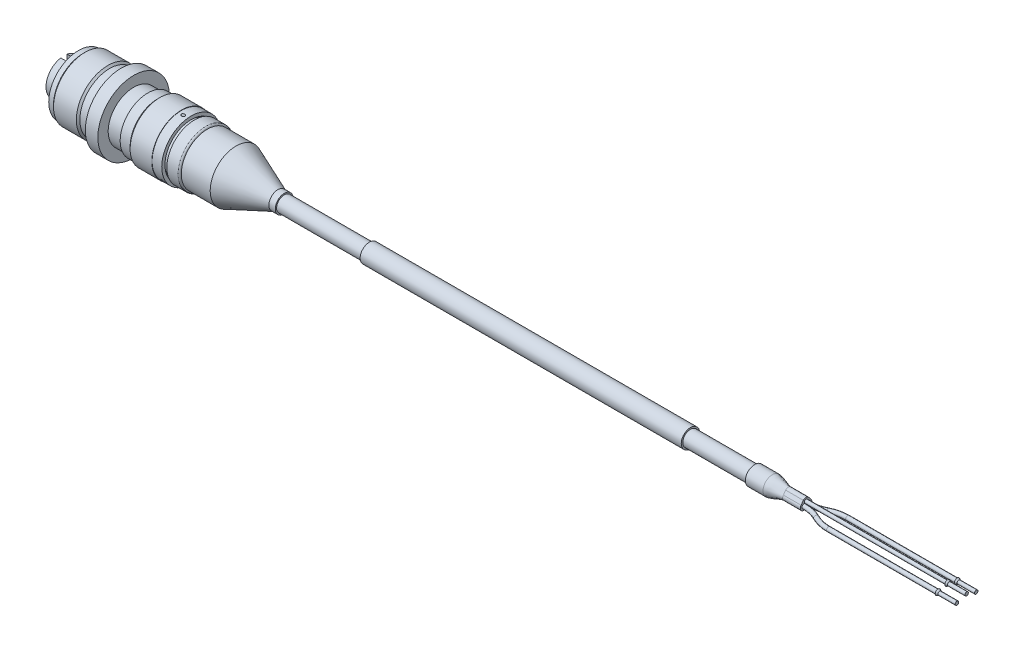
ISO-10303-21;
HEADER;
FILE_DESCRIPTION(('STEP AP214'),'2;1');
FILE_NAME('part.step','',(''),(''),'','','');
FILE_SCHEMA(('AUTOMOTIVE_DESIGN { 1 0 10303 214 1 1 1 1 }'));
ENDSEC;
DATA;
#1=APPLICATION_CONTEXT('core data for automotive mechanical design processes');
#2=APPLICATION_PROTOCOL_DEFINITION('international standard','automotive_design',2000,#1);
#3=PRODUCT_CONTEXT('',#1,'mechanical');
#4=PRODUCT('Part','Part','',(#3));
#5=PRODUCT_RELATED_PRODUCT_CATEGORY('part','',(#4));
#6=PRODUCT_DEFINITION_FORMATION('','',#4);
#7=PRODUCT_DEFINITION_CONTEXT('part definition',#1,'design');
#8=PRODUCT_DEFINITION('design','',#6,#7);
#9=PRODUCT_DEFINITION_SHAPE('','',#8);
#10=(LENGTH_UNIT() NAMED_UNIT(*) SI_UNIT(.MILLI.,.METRE.));
#11=(NAMED_UNIT(*) PLANE_ANGLE_UNIT() SI_UNIT($,.RADIAN.));
#12=(NAMED_UNIT(*) SI_UNIT($,.STERADIAN.) SOLID_ANGLE_UNIT());
#13=UNCERTAINTY_MEASURE_WITH_UNIT(LENGTH_MEASURE(1.E-05),#10,'distance_accuracy_value','');
#14=(GEOMETRIC_REPRESENTATION_CONTEXT(3) GLOBAL_UNCERTAINTY_ASSIGNED_CONTEXT((#13)) GLOBAL_UNIT_ASSIGNED_CONTEXT((#10,
#11,#12)) REPRESENTATION_CONTEXT('',''));
#15=CARTESIAN_POINT('',(0.,0.,0.));
#16=DIRECTION('',(0.,0.,1.));
#17=DIRECTION('',(1.,0.,0.));
#18=AXIS2_PLACEMENT_3D('',#15,#16,#17);
#19=CARTESIAN_POINT('',(209.,1.0087120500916,0.));
#20=DIRECTION('',(1.,0.,0.));
#21=DIRECTION('',(0.,0.,-1.));
#22=AXIS2_PLACEMENT_3D('',#19,#20,#21);
#23=CYLINDRICAL_SURFACE('',#22,0.399999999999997);
#24=CARTESIAN_POINT('',(210.,1.0087120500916,0.));
#25=DIRECTION('',(1.,0.,0.));
#26=DIRECTION('',(0.,0.,-1.));
#27=AXIS2_PLACEMENT_3D('',#24,#25,#26);
#28=CIRCLE('',#27,0.399999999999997);
#29=CARTESIAN_POINT('',(210.,1.0087120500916,-0.400000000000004));
#30=VERTEX_POINT('',#29);
#31=EDGE_CURVE('E11',#30,#30,#28,.T.);
#32=ORIENTED_EDGE('',*,*,#31,.T.);
#33=EDGE_LOOP('',(#32));
#34=FACE_BOUND('',#33,.T.);
#35=CARTESIAN_POINT('',(210.567820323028,1.0087120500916,0.));
#36=DIRECTION('',(-1.,0.,0.));
#37=DIRECTION('',(0.,-0.927954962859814,0.372692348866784));
#38=AXIS2_PLACEMENT_3D('',#35,#36,#37);
#39=CIRCLE('',#38,0.399999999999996);
#40=CARTESIAN_POINT('',(210.567820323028,0.637530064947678,0.149076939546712));
#41=VERTEX_POINT('',#40);
#42=EDGE_CURVE('E1622',#41,#41,#39,.F.);
#43=ORIENTED_EDGE('',*,*,#42,.F.);
#44=EDGE_LOOP('',(#43));
#45=FACE_BOUND('',#44,.T.);
#46=ADVANCED_FACE('F37',(#34,#45),#23,.T.);
#47=CARTESIAN_POINT('',(216.,0.,-2.99999999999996));
#48=DIRECTION('',(-1.,0.,0.));
#49=DIRECTION('',(0.,0.,1.));
#50=AXIS2_PLACEMENT_3D('',#47,#48,#49);
#51=CYLINDRICAL_SURFACE('',#50,0.4);
#52=CARTESIAN_POINT('',(210.,0.,-2.99999999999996));
#53=DIRECTION('',(1.,0.,0.));
#54=DIRECTION('',(0.,0.,-1.));
#55=AXIS2_PLACEMENT_3D('',#52,#53,#54);
#56=CIRCLE('',#55,0.4);
#57=CARTESIAN_POINT('',(210.,0.,-3.39999999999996));
#58=VERTEX_POINT('',#57);
#59=EDGE_CURVE('E932',#58,#58,#56,.T.);
#60=ORIENTED_EDGE('',*,*,#59,.T.);
#61=EDGE_LOOP('',(#60));
#62=FACE_BOUND('',#61,.T.);
#63=CARTESIAN_POINT('',(210.567820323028,0.,-2.99999999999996));
#64=DIRECTION('',(-1.,0.,0.));
#65=DIRECTION('',(0.,-0.901096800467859,-0.433617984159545));
#66=AXIS2_PLACEMENT_3D('',#63,#64,#65);
#67=CIRCLE('',#66,0.399999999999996);
#68=CARTESIAN_POINT('',(210.567820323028,-0.360438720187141,-3.17344719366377));
#69=VERTEX_POINT('',#68);
#70=EDGE_CURVE('E588',#69,#69,#67,.F.);
#71=ORIENTED_EDGE('',*,*,#70,.F.);
#72=EDGE_LOOP('',(#71));
#73=FACE_BOUND('',#72,.T.);
#74=ADVANCED_FACE('F39',(#62,#73),#51,.T.);
#75=CARTESIAN_POINT('',(210.,0.,-2.99999999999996));
#76=DIRECTION('',(-1.,0.,0.));
#77=DIRECTION('',(0.,-0.901096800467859,-0.433617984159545));
#78=AXIS2_PLACEMENT_3D('',#75,#76,#77);
#79=CONICAL_SURFACE('',#78,0.720096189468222,0.523598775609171);
#80=CARTESIAN_POINT('',(210.542820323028,0.,-2.99999999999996));
#81=DIRECTION('',(-1.,0.,0.));
#82=DIRECTION('',(0.,-0.901096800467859,-0.433617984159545));
#83=AXIS2_PLACEMENT_3D('',#80,#81,#82);
#84=CIRCLE('',#83,0.406698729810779);
#85=CARTESIAN_POINT('',(210.542820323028,-0.366474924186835,-3.17635188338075));
#86=VERTEX_POINT('',#85);
#87=EDGE_CURVE('E595',#86,#86,#84,.T.);
#88=ORIENTED_EDGE('',*,*,#87,.F.);
#89=EDGE_LOOP('',(#88));
#90=FACE_BOUND('',#89,.T.);
#91=CARTESIAN_POINT('',(209.999999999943,0.,-2.99999999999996));
#92=DIRECTION('',(1.,0.,0.));
#93=DIRECTION('',(0.,0.901096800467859,0.433617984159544));
#94=AXIS2_PLACEMENT_3D('',#91,#92,#93);
#95=CIRCLE('',#94,0.720096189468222);
#96=CARTESIAN_POINT('',(209.999999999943,0.648876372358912,-2.68775334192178));
#97=VERTEX_POINT('',#96);
#98=EDGE_CURVE('E937',#97,#97,#95,.T.);
#99=ORIENTED_EDGE('',*,*,#98,.F.);
#100=EDGE_LOOP('',(#99));
#101=FACE_BOUND('',#100,.T.);
#102=ADVANCED_FACE('F604',(#90,#101),#79,.F.);
#103=CARTESIAN_POINT('',(210.074999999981,0.,-2.99999999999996));
#104=DIRECTION('',(1.,0.,0.));
#105=DIRECTION('',(0.,0.901096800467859,0.433617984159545));
#106=AXIS2_PLACEMENT_3D('',#103,#104,#105);
#107=CONICAL_SURFACE('',#106,0.85000000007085,1.04719755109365);
#108=ORIENTED_EDGE('',*,*,#98,.T.);
#109=EDGE_LOOP('',(#108));
#110=FACE_BOUND('',#109,.T.);
#111=CARTESIAN_POINT('',(210.075000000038,0.,-2.99999999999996));
#112=DIRECTION('',(-1.,0.,0.));
#113=DIRECTION('',(0.,-0.901096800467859,-0.433617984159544));
#114=AXIS2_PLACEMENT_3D('',#111,#112,#113);
#115=CIRCLE('',#114,0.850000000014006);
#116=CARTESIAN_POINT('',(210.075000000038,-0.765932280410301,-3.36857528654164));
#117=VERTEX_POINT('',#116);
#118=EDGE_CURVE('E592',#117,#117,#115,.F.);
#119=ORIENTED_EDGE('',*,*,#118,.F.);
#120=EDGE_LOOP('',(#119));
#121=FACE_BOUND('',#120,.T.);
#122=ADVANCED_FACE('F600',(#110,#121),#107,.T.);
#123=CARTESIAN_POINT('',(210.567820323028,0.,-2.99999999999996));
#124=DIRECTION('',(-1.,0.,0.));
#125=DIRECTION('',(0.,-0.901096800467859,-0.433617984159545));
#126=AXIS2_PLACEMENT_3D('',#123,#124,#125);
#127=TOROIDAL_SURFACE('',#126,0.450000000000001,0.05);
#128=ORIENTED_EDGE('',*,*,#70,.T.);
#129=EDGE_LOOP('',(#128));
#130=FACE_BOUND('',#129,.T.);
#131=ORIENTED_EDGE('',*,*,#87,.T.);
#132=EDGE_LOOP('',(#131));
#133=FACE_BOUND('',#132,.T.);
#134=ADVANCED_FACE('F597',(#130,#133),#127,.T.);
#135=CARTESIAN_POINT('',(210.075000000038,0.,-2.99999999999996));
#136=DIRECTION('',(-1.,0.,0.));
#137=DIRECTION('',(0.,-0.901096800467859,-0.433617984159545));
#138=AXIS2_PLACEMENT_3D('',#135,#136,#137);
#139=CONICAL_SURFACE('',#138,0.850000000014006,0.52359877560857);
#140=ORIENTED_EDGE('',*,*,#118,.T.);
#141=EDGE_LOOP('',(#140));
#142=FACE_BOUND('',#141,.T.);
#143=CARTESIAN_POINT('',(210.583012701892,0.,-2.99999999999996));
#144=DIRECTION('',(-1.,0.,0.));
#145=DIRECTION('',(0.,-0.901096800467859,-0.433617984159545));
#146=AXIS2_PLACEMENT_3D('',#143,#144,#145);
#147=CIRCLE('',#146,0.556698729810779);
#148=CARTESIAN_POINT('',(210.583012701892,-0.501639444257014,-3.24139458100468));
#149=VERTEX_POINT('',#148);
#150=EDGE_CURVE('E591',#149,#149,#147,.T.);
#151=ORIENTED_EDGE('',*,*,#150,.T.);
#152=EDGE_LOOP('',(#151));
#153=FACE_BOUND('',#152,.T.);
#154=ADVANCED_FACE('F580',(#142,#153),#139,.T.);
#155=CARTESIAN_POINT('',(210.608012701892,0.,-2.99999999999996));
#156=DIRECTION('',(-1.,0.,0.));
#157=DIRECTION('',(0.,-0.901096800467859,-0.433617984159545));
#158=AXIS2_PLACEMENT_3D('',#155,#156,#157);
#159=TOROIDAL_SURFACE('',#158,0.600000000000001,0.05);
#160=ORIENTED_EDGE('',*,*,#150,.F.);
#161=EDGE_LOOP('',(#160));
#162=FACE_BOUND('',#161,.T.);
#163=CARTESIAN_POINT('',(210.608012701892,0.,-2.99999999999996));
#164=DIRECTION('',(-1.,0.,0.));
#165=DIRECTION('',(0.,-0.901096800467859,-0.433617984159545));
#166=AXIS2_PLACEMENT_3D('',#163,#164,#165);
#167=CIRCLE('',#166,0.549999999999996);
#168=CARTESIAN_POINT('',(210.608012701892,-0.495603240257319,-3.2384898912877));
#169=VERTEX_POINT('',#168);
#170=EDGE_CURVE('E939',#169,#169,#167,.F.);
#171=ORIENTED_EDGE('',*,*,#170,.F.);
#172=EDGE_LOOP('',(#171));
#173=FACE_BOUND('',#172,.T.);
#174=ADVANCED_FACE('F575',(#162,#173),#159,.F.);
#175=CARTESIAN_POINT('',(210.,0.,-2.99999999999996));
#176=DIRECTION('',(-1.,0.,0.));
#177=DIRECTION('',(0.,-0.901096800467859,-0.433617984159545));
#178=AXIS2_PLACEMENT_3D('',#175,#176,#177);
#179=CYLINDRICAL_SURFACE('',#178,0.549999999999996);
#180=ORIENTED_EDGE('',*,*,#170,.T.);
#181=EDGE_LOOP('',(#180));
#182=FACE_BOUND('',#181,.T.);
#183=CARTESIAN_POINT('',(216.,0.,-2.99999999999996));
#184=DIRECTION('',(1.,0.,0.));
#185=DIRECTION('',(0.,0.901096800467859,0.433617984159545));
#186=AXIS2_PLACEMENT_3D('',#183,#184,#185);
#187=CIRCLE('',#186,0.549999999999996);
#188=CARTESIAN_POINT('',(216.,0.495603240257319,-2.76151010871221));
#189=VERTEX_POINT('',#188);
#190=EDGE_CURVE('E586',#189,#189,#187,.T.);
#191=ORIENTED_EDGE('',*,*,#190,.F.);
#192=EDGE_LOOP('',(#191));
#193=FACE_BOUND('',#192,.T.);
#194=ADVANCED_FACE('F572',(#182,#193),#179,.T.);
#195=CARTESIAN_POINT('',(216.,0.,-2.99999999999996));
#196=DIRECTION('',(1.,0.,0.));
#197=DIRECTION('',(0.,0.,-1.));
#198=AXIS2_PLACEMENT_3D('',#195,#196,#197);
#199=PLANE('',#198);
#200=ORIENTED_EDGE('',*,*,#190,.T.);
#201=EDGE_LOOP('',(#200));
#202=FACE_BOUND('',#201,.T.);
#203=ADVANCED_FACE('F522',(#202),#199,.T.);
#204=CARTESIAN_POINT('',(159.,-1.15,0.65));
#205=DIRECTION('',(0.,-1.,0.));
#206=DIRECTION('',(0.,0.,-1.));
#207=AXIS2_PLACEMENT_3D('',#204,#205,#206);
#208=PLANE('',#207);
#209=DIRECTION('',(1.,0.,0.));
#210=VECTOR('',#209,1.);
#211=CARTESIAN_POINT('',(159.,-1.15,0.65));
#212=LINE('',#211,#210);
#213=CARTESIAN_POINT('',(160.498966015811,-1.15,0.65));
#214=VERTEX_POINT('',#213);
#215=CARTESIAN_POINT('',(166.,-1.15,0.65));
#216=VERTEX_POINT('',#215);
#217=EDGE_CURVE('E879',#214,#216,#212,.T.);
#218=ORIENTED_EDGE('',*,*,#217,.F.);
#219=CARTESIAN_POINT('',(160.5,0.701306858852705,1.56141027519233));
#220=CARTESIAN_POINT('',(160.5,0.904801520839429,1.40482634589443));
#221=CARTESIAN_POINT('',(160.5,1.08974489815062,1.26251715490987));
#222=CARTESIAN_POINT('',(160.5,1.27180488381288,1.12242665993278));
#223=CARTESIAN_POINT('',(160.5,1.45436419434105,0.981951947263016));
#224=CARTESIAN_POINT('',(160.5,1.79874867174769,0.716956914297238));
#225=CARTESIAN_POINT('',(160.5,1.92401330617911,0.565902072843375));
#226=CARTESIAN_POINT('',(160.5,2.01184970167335,0.386662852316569));
#227=CARTESIAN_POINT('',(160.5,2.099686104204,2.70742778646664E-08));
#228=CARTESIAN_POINT('',(160.5,2.01184971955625,-0.386662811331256));
#229=CARTESIAN_POINT('',(160.5,1.92401332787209,-0.565902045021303));
#230=CARTESIAN_POINT('',(160.5,1.79874868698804,-0.716956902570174));
#231=CARTESIAN_POINT('',(160.5,1.45436421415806,-0.981951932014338));
#232=CARTESIAN_POINT('',(160.5,1.27180494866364,-1.12242661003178));
#233=CARTESIAN_POINT('',(160.5,1.08974498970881,-1.26251708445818));
#234=CARTESIAN_POINT('',(160.5,0.904801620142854,-1.40482626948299));
#235=CARTESIAN_POINT('',(160.5,0.505343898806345,-1.71219875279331));
#236=CARTESIAN_POINT('',(160.5,0.262762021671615,-1.812522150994));
#237=CARTESIAN_POINT('',(160.5,-0.00594325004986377,-1.83885704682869));
#238=CARTESIAN_POINT('',(160.5,-0.53218527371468,-1.73977495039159));
#239=CARTESIAN_POINT('',(160.5,-0.934852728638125,-1.3849711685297));
#240=CARTESIAN_POINT('',(160.5,-1.07998343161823,-1.15558437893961));
#241=CARTESIAN_POINT('',(160.5,-1.15,-0.899991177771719));
#242=CARTESIAN_POINT('',(160.5,-1.15,-0.377857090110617));
#243=CARTESIAN_POINT('',(160.5,-1.15,-0.125128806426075));
#244=CARTESIAN_POINT('',(160.5,-1.15,0.125129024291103));
#245=CARTESIAN_POINT('',(160.5,-1.15,0.37785725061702));
#246=CARTESIAN_POINT('',(160.5,-1.15,1.14998265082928));
#247=CARTESIAN_POINT('',(160.5,-0.869933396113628,1.67237300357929));
#248=CARTESIAN_POINT('',(160.5,-0.269020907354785,1.96270372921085));
#249=CARTESIAN_POINT('',(160.5,0.309380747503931,1.86298737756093));
#250=CARTESIAN_POINT('',(160.5,0.701306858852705,1.56141027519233));
#251=B_SPLINE_CURVE_WITH_KNOTS('',5,(#219,#220,#221,#222,#223,#224,#225,#226,#227,#228,#229,
#230,#231,#232,#233,#234,#235,#236,#237,#238,#239,#240,#241,#242,#243,#244,#245,#246,#247,#248,
#249,#250),.UNSPECIFIED.,.T.,.F.,(6,4,3,4,4,3,4,4,6),(0.,0.118506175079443,0.20964386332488,
0.300781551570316,0.419287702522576,0.533407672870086,0.647527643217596,0.771759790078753,1.),.UNSPECIFIED.);
#252=CARTESIAN_POINT('',(160.498966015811,-1.15,-0.65));
#253=VERTEX_POINT('',#252);
#254=EDGE_CURVE('E52',#214,#253,#251,.F.);
#255=ORIENTED_EDGE('',*,*,#254,.T.);
#256=DIRECTION('',(1.,0.,0.));
#257=VECTOR('',#256,1.);
#258=CARTESIAN_POINT('',(159.,-1.15,-0.65));
#259=LINE('',#258,#257);
#260=CARTESIAN_POINT('',(166.,-1.15,-0.65));
#261=VERTEX_POINT('',#260);
#262=EDGE_CURVE('E876',#253,#261,#259,.T.);
#263=ORIENTED_EDGE('',*,*,#262,.T.);
#264=DIRECTION('',(0.,0.,-1.));
#265=VECTOR('',#264,1.);
#266=CARTESIAN_POINT('',(166.,-1.15,0.65));
#267=LINE('',#266,#265);
#268=EDGE_CURVE('E868',#216,#261,#267,.T.);
#269=ORIENTED_EDGE('',*,*,#268,.F.);
#270=EDGE_LOOP('',(#218,#255,#263,#269));
#271=FACE_BOUND('',#270,.T.);
#272=ADVANCED_FACE('F517',(#271),#208,.T.);
#273=CARTESIAN_POINT('',(159.,1.64903570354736,0.832157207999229));
#274=DIRECTION('',(0.,0.609832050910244,0.792530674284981));
#275=DIRECTION('',(0.,-0.792530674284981,0.609832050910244));
#276=AXIS2_PLACEMENT_3D('',#273,#274,#275);
#277=PLANE('',#276);
#278=DIRECTION('',(1.,0.,0.));
#279=VECTOR('',#278,1.);
#280=CARTESIAN_POINT('',(159.,1.64903570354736,0.832157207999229));
#281=LINE('',#280,#279);
#282=CARTESIAN_POINT('',(160.498492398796,1.64903570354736,0.832157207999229));
#283=VERTEX_POINT('',#282);
#284=CARTESIAN_POINT('',(166.,1.64903570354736,0.832157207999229));
#285=VERTEX_POINT('',#284);
#286=EDGE_CURVE('E908',#283,#285,#281,.T.);
#287=ORIENTED_EDGE('',*,*,#286,.F.);
#288=CARTESIAN_POINT('',(160.5,0.701306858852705,1.56141027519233));
#289=CARTESIAN_POINT('',(160.5,0.904801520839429,1.40482634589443));
#290=CARTESIAN_POINT('',(160.5,1.08974489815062,1.26251715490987));
#291=CARTESIAN_POINT('',(160.5,1.27180488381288,1.12242665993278));
#292=CARTESIAN_POINT('',(160.5,1.45436419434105,0.981951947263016));
#293=CARTESIAN_POINT('',(160.5,1.79874867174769,0.716956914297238));
#294=CARTESIAN_POINT('',(160.5,1.92401330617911,0.565902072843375));
#295=CARTESIAN_POINT('',(160.5,2.01184970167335,0.386662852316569));
#296=CARTESIAN_POINT('',(160.5,2.099686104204,2.70742778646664E-08));
#297=CARTESIAN_POINT('',(160.5,2.01184971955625,-0.386662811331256));
#298=CARTESIAN_POINT('',(160.5,1.92401332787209,-0.565902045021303));
#299=CARTESIAN_POINT('',(160.5,1.79874868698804,-0.716956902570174));
#300=CARTESIAN_POINT('',(160.5,1.45436421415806,-0.981951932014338));
#301=CARTESIAN_POINT('',(160.5,1.27180494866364,-1.12242661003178));
#302=CARTESIAN_POINT('',(160.5,1.08974498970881,-1.26251708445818));
#303=CARTESIAN_POINT('',(160.5,0.904801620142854,-1.40482626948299));
#304=CARTESIAN_POINT('',(160.5,0.505343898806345,-1.71219875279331));
#305=CARTESIAN_POINT('',(160.5,0.262762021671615,-1.812522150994));
#306=CARTESIAN_POINT('',(160.5,-0.00594325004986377,-1.83885704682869));
#307=CARTESIAN_POINT('',(160.5,-0.53218527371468,-1.73977495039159));
#308=CARTESIAN_POINT('',(160.5,-0.934852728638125,-1.3849711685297));
#309=CARTESIAN_POINT('',(160.5,-1.07998343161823,-1.15558437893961));
#310=CARTESIAN_POINT('',(160.5,-1.15,-0.899991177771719));
#311=CARTESIAN_POINT('',(160.5,-1.15,-0.377857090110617));
#312=CARTESIAN_POINT('',(160.5,-1.15,-0.125128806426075));
#313=CARTESIAN_POINT('',(160.5,-1.15,0.125129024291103));
#314=CARTESIAN_POINT('',(160.5,-1.15,0.37785725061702));
#315=CARTESIAN_POINT('',(160.5,-1.15,1.14998265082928));
#316=CARTESIAN_POINT('',(160.5,-0.869933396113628,1.67237300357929));
#317=CARTESIAN_POINT('',(160.5,-0.269020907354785,1.96270372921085));
#318=CARTESIAN_POINT('',(160.5,0.309380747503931,1.86298737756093));
#319=CARTESIAN_POINT('',(160.5,0.701306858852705,1.56141027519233));
#320=B_SPLINE_CURVE_WITH_KNOTS('',5,(#288,#289,#290,#291,#292,#293,#294,#295,#296,#297,#298,
#299,#300,#301,#302,#303,#304,#305,#306,#307,#308,#309,#310,#311,#312,#313,#314,#315,#316,#317,
#318,#319),.UNSPECIFIED.,.T.,.F.,(6,4,3,4,4,3,4,4,6),(0.,0.118506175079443,0.20964386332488,
0.300781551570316,0.419287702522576,0.533407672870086,0.647527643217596,0.771759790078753,1.),.UNSPECIFIED.);
#321=CARTESIAN_POINT('',(160.498492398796,0.701306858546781,1.56141027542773));
#322=VERTEX_POINT('',#321);
#323=EDGE_CURVE('E460',#283,#322,#320,.F.);
#324=ORIENTED_EDGE('',*,*,#323,.T.);
#325=DIRECTION('',(1.,0.,0.));
#326=VECTOR('',#325,1.);
#327=CARTESIAN_POINT('',(159.,0.701306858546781,1.56141027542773));
#328=LINE('',#327,#326);
#329=CARTESIAN_POINT('',(166.,0.701306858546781,1.56141027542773));
#330=VERTEX_POINT('',#329);
#331=EDGE_CURVE('E881',#322,#330,#328,.T.);
#332=ORIENTED_EDGE('',*,*,#331,.T.);
#333=DIRECTION('',(0.,-0.79253067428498,0.609832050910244));
#334=VECTOR('',#333,1.);
#335=CARTESIAN_POINT('',(166.,1.64903570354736,0.832157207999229));
#336=LINE('',#335,#334);
#337=EDGE_CURVE('E862',#285,#330,#336,.T.);
#338=ORIENTED_EDGE('',*,*,#337,.F.);
#339=EDGE_LOOP('',(#287,#324,#332,#338));
#340=FACE_BOUND('',#339,.T.);
#341=ADVANCED_FACE('F521',(#340),#277,.T.);
#342=CARTESIAN_POINT('',(166.,0.,-0.65));
#343=DIRECTION('',(1.,0.,0.));
#344=DIRECTION('',(0.,0.,-1.));
#345=AXIS2_PLACEMENT_3D('',#342,#343,#344);
#346=PLANE('',#345);
#347=CARTESIAN_POINT('',(166.,0.,-0.65));
#348=DIRECTION('',(1.,0.,0.));
#349=DIRECTION('',(0.,0.,-1.));
#350=AXIS2_PLACEMENT_3D('',#347,#348,#349);
#351=CIRCLE('',#350,0.65);
#352=CARTESIAN_POINT('',(166.,0.,0.));
#353=VERTEX_POINT('',#352);
#354=CARTESIAN_POINT('',(166.,0.546385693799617,-0.297916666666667));
#355=VERTEX_POINT('',#354);
#356=EDGE_CURVE('E878',#353,#355,#351,.T.);
#357=ORIENTED_EDGE('',*,*,#356,.F.);
#358=CARTESIAN_POINT('',(166.,0.,0.65));
#359=DIRECTION('',(1.,0.,0.));
#360=DIRECTION('',(0.,-1.,0.));
#361=AXIS2_PLACEMENT_3D('',#358,#359,#360);
#362=CIRCLE('',#361,0.65);
#363=CARTESIAN_POINT('',(166.,0.546385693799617,0.297916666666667));
#364=VERTEX_POINT('',#363);
#365=EDGE_CURVE('E831',#364,#353,#362,.T.);
#366=ORIENTED_EDGE('',*,*,#365,.F.);
#367=CARTESIAN_POINT('',(166.,1.0087120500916,0.));
#368=DIRECTION('',(1.,0.,0.));
#369=DIRECTION('',(0.,0.,-1.));
#370=AXIS2_PLACEMENT_3D('',#367,#368,#369);
#371=CIRCLE('',#370,0.55);
#372=EDGE_CURVE('E851',#364,#355,#371,.F.);
#373=ORIENTED_EDGE('',*,*,#372,.T.);
#374=EDGE_LOOP('',(#357,#366,#373));
#375=FACE_BOUND('',#374,.T.);
#376=CARTESIAN_POINT('',(166.,0.,-0.65));
#377=DIRECTION('',(1.,0.,0.));
#378=DIRECTION('',(0.,0.,-1.));
#379=AXIS2_PLACEMENT_3D('',#376,#377,#378);
#380=CIRCLE('',#379,1.15);
#381=CARTESIAN_POINT('',(166.,0.70130685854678,-1.56141027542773));
#382=VERTEX_POINT('',#381);
#383=EDGE_CURVE('E852',#261,#382,#380,.T.);
#384=ORIENTED_EDGE('',*,*,#383,.T.);
#385=DIRECTION('',(0.,0.792530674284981,0.609832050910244));
#386=VECTOR('',#385,1.);
#387=CARTESIAN_POINT('',(166.,0.70130685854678,-1.56141027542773));
#388=LINE('',#387,#386);
#389=CARTESIAN_POINT('',(166.,1.64903570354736,-0.83215720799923));
#390=VERTEX_POINT('',#389);
#391=EDGE_CURVE('E855',#382,#390,#388,.T.);
#392=ORIENTED_EDGE('',*,*,#391,.T.);
#393=CARTESIAN_POINT('',(166.,1.0087120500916,0.));
#394=DIRECTION('',(1.,0.,0.));
#395=DIRECTION('',(0.,0.,-1.));
#396=AXIS2_PLACEMENT_3D('',#393,#394,#395);
#397=CIRCLE('',#396,1.05);
#398=EDGE_CURVE('E859',#390,#285,#397,.T.);
#399=ORIENTED_EDGE('',*,*,#398,.T.);
#400=ORIENTED_EDGE('',*,*,#337,.T.);
#401=CARTESIAN_POINT('',(166.,0.,0.65));
#402=DIRECTION('',(1.,0.,0.));
#403=DIRECTION('',(0.,0.,-1.));
#404=AXIS2_PLACEMENT_3D('',#401,#402,#403);
#405=CIRCLE('',#404,1.15);
#406=EDGE_CURVE('E865',#330,#216,#405,.T.);
#407=ORIENTED_EDGE('',*,*,#406,.T.);
#408=ORIENTED_EDGE('',*,*,#268,.T.);
#409=EDGE_LOOP('',(#384,#392,#399,#400,#407,#408));
#410=FACE_BOUND('',#409,.T.);
#411=ADVANCED_FACE('F516',(#375,#410),#346,.T.);
#412=CARTESIAN_POINT('',(176.,0.,-3.));
#413=DIRECTION('',(1.,0.,0.));
#414=DIRECTION('',(0.,-1.,0.));
#415=AXIS2_PLACEMENT_3D('',#412,#413,#414);
#416=CYLINDRICAL_SURFACE('',#415,0.65);
#417=CARTESIAN_POINT('',(176.,0.,-3.));
#418=DIRECTION('',(1.,0.,0.));
#419=DIRECTION('',(0.,-1.,0.));
#420=AXIS2_PLACEMENT_3D('',#417,#418,#419);
#421=CIRCLE('',#420,0.65);
#422=CARTESIAN_POINT('',(176.,0.,-3.65));
#423=VERTEX_POINT('',#422);
#424=EDGE_CURVE('E928',#423,#423,#421,.T.);
#425=ORIENTED_EDGE('',*,*,#424,.T.);
#426=EDGE_LOOP('',(#425));
#427=FACE_BOUND('',#426,.T.);
#428=CARTESIAN_POINT('',(210.,0.,-3.));
#429=DIRECTION('',(1.,0.,0.));
#430=DIRECTION('',(0.,-1.,0.));
#431=AXIS2_PLACEMENT_3D('',#428,#429,#430);
#432=CIRCLE('',#431,0.65);
#433=CARTESIAN_POINT('',(210.,-0.65,-3.));
#434=VERTEX_POINT('',#433);
#435=EDGE_CURVE('E930',#434,#434,#432,.T.);
#436=ORIENTED_EDGE('',*,*,#435,.F.);
#437=EDGE_LOOP('',(#436));
#438=FACE_BOUND('',#437,.T.);
#439=ADVANCED_FACE('F567',(#427,#438),#416,.T.);
#440=CARTESIAN_POINT('',(176.,0.,8.22579787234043));
#441=DIRECTION('',(0.,-1.,0.));
#442=DIRECTION('',(-1.,0.,0.));
#443=AXIS2_PLACEMENT_3D('',#440,#441,#442);
#444=TOROIDAL_SURFACE('',#443,11.2257978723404,0.65);
#445=CARTESIAN_POINT('',(171.,0.,-1.825));
#446=DIRECTION('',(0.895330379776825,0.,-0.445402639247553));
#447=DIRECTION('',(0.,-1.,0.));
#448=AXIS2_PLACEMENT_3D('',#445,#446,#447);
#449=CIRCLE('',#448,0.65);
#450=CARTESIAN_POINT('',(170.710488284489,0.,-2.40696474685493));
#451=VERTEX_POINT('',#450);
#452=EDGE_CURVE('E925',#451,#451,#449,.T.);
#453=CARTESIAN_POINT('',(176.,0.,8.22579787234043));
#454=DIRECTION('',(0.,-1.,0.));
#455=DIRECTION('',(-1.,0.,0.));
#456=AXIS2_PLACEMENT_3D('',#453,#454,#455);
#457=CIRCLE('',#456,11.8757978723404);
#458=EDGE_CURVE('',#451,#423,#457,.T.);
#459=ORIENTED_EDGE('',*,*,#452,.T.);
#460=ORIENTED_EDGE('',*,*,#424,.F.);
#461=ORIENTED_EDGE('',*,*,#458,.T.);
#462=ORIENTED_EDGE('',*,*,#458,.F.);
#463=EDGE_LOOP('',(#459,#461,#460,#462));
#464=FACE_BOUND('',#463,.T.);
#465=ADVANCED_FACE('F563',(#464),#444,.T.);
#466=CARTESIAN_POINT('',(166.,0.,-11.8757978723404));
#467=DIRECTION('',(0.,1.,0.));
#468=DIRECTION('',(1.,0.,0.));
#469=AXIS2_PLACEMENT_3D('',#466,#467,#468);
#470=TOROIDAL_SURFACE('',#469,11.2257978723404,0.65);
#471=EDGE_CURVE('E922',#355,#353,#351,.T.);
#472=ORIENTED_EDGE('',*,*,#471,.T.);
#473=ORIENTED_EDGE('',*,*,#356,.T.);
#474=EDGE_LOOP('',(#472,#473));
#475=FACE_BOUND('',#474,.T.);
#476=ORIENTED_EDGE('',*,*,#452,.F.);
#477=EDGE_LOOP('',(#476));
#478=FACE_BOUND('',#477,.T.);
#479=ADVANCED_FACE('F559',(#475,#478),#470,.T.);
#480=CARTESIAN_POINT('',(210.,0.,-3.));
#481=DIRECTION('',(1.,0.,0.));
#482=DIRECTION('',(0.,-1.,0.));
#483=AXIS2_PLACEMENT_3D('',#480,#481,#482);
#484=PLANE('',#483);
#485=ORIENTED_EDGE('',*,*,#59,.F.);
#486=EDGE_LOOP('',(#485));
#487=FACE_BOUND('',#486,.T.);
#488=ORIENTED_EDGE('',*,*,#435,.T.);
#489=EDGE_LOOP('',(#488));
#490=FACE_BOUND('',#489,.T.);
#491=ADVANCED_FACE('F554',(#487,#490),#484,.T.);
#492=CARTESIAN_POINT('',(159.,0.,-0.65));
#493=DIRECTION('',(1.,0.,0.));
#494=DIRECTION('',(0.,0.,-1.));
#495=AXIS2_PLACEMENT_3D('',#492,#493,#494);
#496=CYLINDRICAL_SURFACE('',#495,1.15);
#497=ORIENTED_EDGE('',*,*,#383,.F.);
#498=ORIENTED_EDGE('',*,*,#262,.F.);
#499=CARTESIAN_POINT('',(160.5,0.701306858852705,1.56141027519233));
#500=CARTESIAN_POINT('',(160.5,0.904801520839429,1.40482634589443));
#501=CARTESIAN_POINT('',(160.5,1.08974489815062,1.26251715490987));
#502=CARTESIAN_POINT('',(160.5,1.27180488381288,1.12242665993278));
#503=CARTESIAN_POINT('',(160.5,1.45436419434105,0.981951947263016));
#504=CARTESIAN_POINT('',(160.5,1.79874867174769,0.716956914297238));
#505=CARTESIAN_POINT('',(160.5,1.92401330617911,0.565902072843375));
#506=CARTESIAN_POINT('',(160.5,2.01184970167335,0.386662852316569));
#507=CARTESIAN_POINT('',(160.5,2.099686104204,2.70742778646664E-08));
#508=CARTESIAN_POINT('',(160.5,2.01184971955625,-0.386662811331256));
#509=CARTESIAN_POINT('',(160.5,1.92401332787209,-0.565902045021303));
#510=CARTESIAN_POINT('',(160.5,1.79874868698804,-0.716956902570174));
#511=CARTESIAN_POINT('',(160.5,1.45436421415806,-0.981951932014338));
#512=CARTESIAN_POINT('',(160.5,1.27180494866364,-1.12242661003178));
#513=CARTESIAN_POINT('',(160.5,1.08974498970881,-1.26251708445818));
#514=CARTESIAN_POINT('',(160.5,0.904801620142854,-1.40482626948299));
#515=CARTESIAN_POINT('',(160.5,0.505343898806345,-1.71219875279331));
#516=CARTESIAN_POINT('',(160.5,0.262762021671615,-1.812522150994));
#517=CARTESIAN_POINT('',(160.5,-0.00594325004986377,-1.83885704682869));
#518=CARTESIAN_POINT('',(160.5,-0.53218527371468,-1.73977495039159));
#519=CARTESIAN_POINT('',(160.5,-0.934852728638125,-1.3849711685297));
#520=CARTESIAN_POINT('',(160.5,-1.07998343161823,-1.15558437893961));
#521=CARTESIAN_POINT('',(160.5,-1.15,-0.899991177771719));
#522=CARTESIAN_POINT('',(160.5,-1.15,-0.377857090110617));
#523=CARTESIAN_POINT('',(160.5,-1.15,-0.125128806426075));
#524=CARTESIAN_POINT('',(160.5,-1.15,0.125129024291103));
#525=CARTESIAN_POINT('',(160.5,-1.15,0.37785725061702));
#526=CARTESIAN_POINT('',(160.5,-1.15,1.14998265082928));
#527=CARTESIAN_POINT('',(160.5,-0.869933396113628,1.67237300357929));
#528=CARTESIAN_POINT('',(160.5,-0.269020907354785,1.96270372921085));
#529=CARTESIAN_POINT('',(160.5,0.309380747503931,1.86298737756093));
#530=CARTESIAN_POINT('',(160.5,0.701306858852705,1.56141027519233));
#531=B_SPLINE_CURVE_WITH_KNOTS('',5,(#499,#500,#501,#502,#503,#504,#505,#506,#507,#508,#509,
#510,#511,#512,#513,#514,#515,#516,#517,#518,#519,#520,#521,#522,#523,#524,#525,#526,#527,#528,
#529,#530),.UNSPECIFIED.,.T.,.F.,(6,4,3,4,4,3,4,4,6),(0.,0.118506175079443,0.20964386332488,
0.300781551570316,0.419287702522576,0.533407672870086,0.647527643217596,0.771759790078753,1.),.UNSPECIFIED.);
#532=CARTESIAN_POINT('',(160.5,0.70130685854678,-1.56141027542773));
#533=VERTEX_POINT('',#532);
#534=EDGE_CURVE('E538',#253,#533,#531,.F.);
#535=ORIENTED_EDGE('',*,*,#534,.T.);
#536=DIRECTION('',(1.,0.,0.));
#537=VECTOR('',#536,1.);
#538=CARTESIAN_POINT('',(159.,0.70130685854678,-1.56141027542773));
#539=LINE('',#538,#537);
#540=EDGE_CURVE('E871',#533,#382,#539,.T.);
#541=ORIENTED_EDGE('',*,*,#540,.T.);
#542=EDGE_LOOP('',(#497,#498,#535,#541));
#543=FACE_BOUND('',#542,.T.);
#544=ADVANCED_FACE('F544',(#543),#496,.T.);
#545=CARTESIAN_POINT('',(159.,0.,0.65));
#546=DIRECTION('',(1.,0.,0.));
#547=DIRECTION('',(0.,0.,-1.));
#548=AXIS2_PLACEMENT_3D('',#545,#546,#547);
#549=CYLINDRICAL_SURFACE('',#548,1.15);
#550=ORIENTED_EDGE('',*,*,#406,.F.);
#551=ORIENTED_EDGE('',*,*,#331,.F.);
#552=CARTESIAN_POINT('',(160.5,0.701306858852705,1.56141027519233));
#553=CARTESIAN_POINT('',(160.5,0.904801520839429,1.40482634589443));
#554=CARTESIAN_POINT('',(160.5,1.08974489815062,1.26251715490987));
#555=CARTESIAN_POINT('',(160.5,1.27180488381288,1.12242665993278));
#556=CARTESIAN_POINT('',(160.5,1.45436419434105,0.981951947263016));
#557=CARTESIAN_POINT('',(160.5,1.79874867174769,0.716956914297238));
#558=CARTESIAN_POINT('',(160.5,1.92401330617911,0.565902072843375));
#559=CARTESIAN_POINT('',(160.5,2.01184970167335,0.386662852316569));
#560=CARTESIAN_POINT('',(160.5,2.099686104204,2.70742778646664E-08));
#561=CARTESIAN_POINT('',(160.5,2.01184971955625,-0.386662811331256));
#562=CARTESIAN_POINT('',(160.5,1.92401332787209,-0.565902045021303));
#563=CARTESIAN_POINT('',(160.5,1.79874868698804,-0.716956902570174));
#564=CARTESIAN_POINT('',(160.5,1.45436421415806,-0.981951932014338));
#565=CARTESIAN_POINT('',(160.5,1.27180494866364,-1.12242661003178));
#566=CARTESIAN_POINT('',(160.5,1.08974498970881,-1.26251708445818));
#567=CARTESIAN_POINT('',(160.5,0.904801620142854,-1.40482626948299));
#568=CARTESIAN_POINT('',(160.5,0.505343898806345,-1.71219875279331));
#569=CARTESIAN_POINT('',(160.5,0.262762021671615,-1.812522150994));
#570=CARTESIAN_POINT('',(160.5,-0.00594325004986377,-1.83885704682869));
#571=CARTESIAN_POINT('',(160.5,-0.53218527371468,-1.73977495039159));
#572=CARTESIAN_POINT('',(160.5,-0.934852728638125,-1.3849711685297));
#573=CARTESIAN_POINT('',(160.5,-1.07998343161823,-1.15558437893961));
#574=CARTESIAN_POINT('',(160.5,-1.15,-0.899991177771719));
#575=CARTESIAN_POINT('',(160.5,-1.15,-0.377857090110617));
#576=CARTESIAN_POINT('',(160.5,-1.15,-0.125128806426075));
#577=CARTESIAN_POINT('',(160.5,-1.15,0.125129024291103));
#578=CARTESIAN_POINT('',(160.5,-1.15,0.37785725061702));
#579=CARTESIAN_POINT('',(160.5,-1.15,1.14998265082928));
#580=CARTESIAN_POINT('',(160.5,-0.869933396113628,1.67237300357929));
#581=CARTESIAN_POINT('',(160.5,-0.269020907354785,1.96270372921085));
#582=CARTESIAN_POINT('',(160.5,0.309380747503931,1.86298737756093));
#583=CARTESIAN_POINT('',(160.5,0.701306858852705,1.56141027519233));
#584=B_SPLINE_CURVE_WITH_KNOTS('',5,(#552,#553,#554,#555,#556,#557,#558,#559,#560,#561,#562,
#563,#564,#565,#566,#567,#568,#569,#570,#571,#572,#573,#574,#575,#576,#577,#578,#579,#580,#581,
#582,#583),.UNSPECIFIED.,.T.,.F.,(6,4,3,4,4,3,4,4,6),(0.,0.118506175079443,0.20964386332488,
0.300781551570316,0.419287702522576,0.533407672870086,0.647527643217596,0.771759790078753,1.),.UNSPECIFIED.);
#585=EDGE_CURVE('E61',#322,#214,#584,.F.);
#586=ORIENTED_EDGE('',*,*,#585,.T.);
#587=ORIENTED_EDGE('',*,*,#217,.T.);
#588=EDGE_LOOP('',(#550,#551,#586,#587));
#589=FACE_BOUND('',#588,.T.);
#590=ADVANCED_FACE('F523',(#589),#549,.T.);
#591=CARTESIAN_POINT('',(159.,1.0087120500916,0.));
#592=DIRECTION('',(1.,0.,0.));
#593=DIRECTION('',(0.,0.,-1.));
#594=AXIS2_PLACEMENT_3D('',#591,#592,#593);
#595=CYLINDRICAL_SURFACE('',#594,1.05);
#596=CARTESIAN_POINT('',(160.5,0.701306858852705,1.56141027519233));
#597=CARTESIAN_POINT('',(160.5,0.904801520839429,1.40482634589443));
#598=CARTESIAN_POINT('',(160.5,1.08974489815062,1.26251715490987));
#599=CARTESIAN_POINT('',(160.5,1.27180488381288,1.12242665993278));
#600=CARTESIAN_POINT('',(160.5,1.45436419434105,0.981951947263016));
#601=CARTESIAN_POINT('',(160.5,1.79874867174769,0.716956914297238));
#602=CARTESIAN_POINT('',(160.5,1.92401330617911,0.565902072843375));
#603=CARTESIAN_POINT('',(160.5,2.01184970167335,0.386662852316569));
#604=CARTESIAN_POINT('',(160.5,2.099686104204,2.70742778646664E-08));
#605=CARTESIAN_POINT('',(160.5,2.01184971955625,-0.386662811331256));
#606=CARTESIAN_POINT('',(160.5,1.92401332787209,-0.565902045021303));
#607=CARTESIAN_POINT('',(160.5,1.79874868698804,-0.716956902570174));
#608=CARTESIAN_POINT('',(160.5,1.45436421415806,-0.981951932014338));
#609=CARTESIAN_POINT('',(160.5,1.27180494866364,-1.12242661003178));
#610=CARTESIAN_POINT('',(160.5,1.08974498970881,-1.26251708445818));
#611=CARTESIAN_POINT('',(160.5,0.904801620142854,-1.40482626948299));
#612=CARTESIAN_POINT('',(160.5,0.505343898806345,-1.71219875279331));
#613=CARTESIAN_POINT('',(160.5,0.262762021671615,-1.812522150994));
#614=CARTESIAN_POINT('',(160.5,-0.00594325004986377,-1.83885704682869));
#615=CARTESIAN_POINT('',(160.5,-0.53218527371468,-1.73977495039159));
#616=CARTESIAN_POINT('',(160.5,-0.934852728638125,-1.3849711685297));
#617=CARTESIAN_POINT('',(160.5,-1.07998343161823,-1.15558437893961));
#618=CARTESIAN_POINT('',(160.5,-1.15,-0.899991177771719));
#619=CARTESIAN_POINT('',(160.5,-1.15,-0.377857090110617));
#620=CARTESIAN_POINT('',(160.5,-1.15,-0.125128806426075));
#621=CARTESIAN_POINT('',(160.5,-1.15,0.125129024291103));
#622=CARTESIAN_POINT('',(160.5,-1.15,0.37785725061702));
#623=CARTESIAN_POINT('',(160.5,-1.15,1.14998265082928));
#624=CARTESIAN_POINT('',(160.5,-0.869933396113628,1.67237300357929));
#625=CARTESIAN_POINT('',(160.5,-0.269020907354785,1.96270372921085));
#626=CARTESIAN_POINT('',(160.5,0.309380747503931,1.86298737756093));
#627=CARTESIAN_POINT('',(160.5,0.701306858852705,1.56141027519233));
#628=B_SPLINE_CURVE_WITH_KNOTS('',5,(#596,#597,#598,#599,#600,#601,#602,#603,#604,#605,#606,
#607,#608,#609,#610,#611,#612,#613,#614,#615,#616,#617,#618,#619,#620,#621,#622,#623,#624,#625,
#626,#627),.UNSPECIFIED.,.T.,.F.,(6,4,3,4,4,3,4,4,6),(0.,0.118506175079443,0.20964386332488,
0.300781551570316,0.419287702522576,0.533407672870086,0.647527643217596,0.771759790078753,1.),.UNSPECIFIED.);
#629=CARTESIAN_POINT('',(160.5,1.64903570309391,-0.832157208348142));
#630=VERTEX_POINT('',#629);
#631=EDGE_CURVE('E458',#630,#283,#628,.F.);
#632=ORIENTED_EDGE('',*,*,#631,.T.);
#633=ORIENTED_EDGE('',*,*,#286,.T.);
#634=ORIENTED_EDGE('',*,*,#398,.F.);
#635=DIRECTION('',(1.,0.,0.));
#636=VECTOR('',#635,1.);
#637=CARTESIAN_POINT('',(159.,1.64903570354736,-0.83215720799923));
#638=LINE('',#637,#636);
#639=EDGE_CURVE('E916',#630,#390,#638,.T.);
#640=ORIENTED_EDGE('',*,*,#639,.F.);
#641=EDGE_LOOP('',(#632,#633,#634,#640));
#642=FACE_BOUND('',#641,.T.);
#643=ADVANCED_FACE('F894',(#642),#595,.T.);
#644=CARTESIAN_POINT('',(159.,0.70130685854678,-1.56141027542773));
#645=DIRECTION('',(0.,0.609832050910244,-0.792530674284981));
#646=DIRECTION('',(0.,0.792530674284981,0.609832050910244));
#647=AXIS2_PLACEMENT_3D('',#644,#645,#646);
#648=PLANE('',#647);
#649=ORIENTED_EDGE('',*,*,#391,.F.);
#650=ORIENTED_EDGE('',*,*,#540,.F.);
#651=CARTESIAN_POINT('',(160.5,0.701306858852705,1.56141027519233));
#652=CARTESIAN_POINT('',(160.5,0.904801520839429,1.40482634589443));
#653=CARTESIAN_POINT('',(160.5,1.08974489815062,1.26251715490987));
#654=CARTESIAN_POINT('',(160.5,1.27180488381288,1.12242665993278));
#655=CARTESIAN_POINT('',(160.5,1.45436419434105,0.981951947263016));
#656=CARTESIAN_POINT('',(160.5,1.79874867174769,0.716956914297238));
#657=CARTESIAN_POINT('',(160.5,1.92401330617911,0.565902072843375));
#658=CARTESIAN_POINT('',(160.5,2.01184970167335,0.386662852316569));
#659=CARTESIAN_POINT('',(160.5,2.099686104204,2.70742778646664E-08));
#660=CARTESIAN_POINT('',(160.5,2.01184971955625,-0.386662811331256));
#661=CARTESIAN_POINT('',(160.5,1.92401332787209,-0.565902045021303));
#662=CARTESIAN_POINT('',(160.5,1.79874868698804,-0.716956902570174));
#663=CARTESIAN_POINT('',(160.5,1.45436421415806,-0.981951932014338));
#664=CARTESIAN_POINT('',(160.5,1.27180494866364,-1.12242661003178));
#665=CARTESIAN_POINT('',(160.5,1.08974498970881,-1.26251708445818));
#666=CARTESIAN_POINT('',(160.5,0.904801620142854,-1.40482626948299));
#667=CARTESIAN_POINT('',(160.5,0.505343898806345,-1.71219875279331));
#668=CARTESIAN_POINT('',(160.5,0.262762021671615,-1.812522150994));
#669=CARTESIAN_POINT('',(160.5,-0.00594325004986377,-1.83885704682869));
#670=CARTESIAN_POINT('',(160.5,-0.53218527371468,-1.73977495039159));
#671=CARTESIAN_POINT('',(160.5,-0.934852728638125,-1.3849711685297));
#672=CARTESIAN_POINT('',(160.5,-1.07998343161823,-1.15558437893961));
#673=CARTESIAN_POINT('',(160.5,-1.15,-0.899991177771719));
#674=CARTESIAN_POINT('',(160.5,-1.15,-0.377857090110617));
#675=CARTESIAN_POINT('',(160.5,-1.15,-0.125128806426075));
#676=CARTESIAN_POINT('',(160.5,-1.15,0.125129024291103));
#677=CARTESIAN_POINT('',(160.5,-1.15,0.37785725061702));
#678=CARTESIAN_POINT('',(160.5,-1.15,1.14998265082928));
#679=CARTESIAN_POINT('',(160.5,-0.869933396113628,1.67237300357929));
#680=CARTESIAN_POINT('',(160.5,-0.269020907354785,1.96270372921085));
#681=CARTESIAN_POINT('',(160.5,0.309380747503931,1.86298737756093));
#682=CARTESIAN_POINT('',(160.5,0.701306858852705,1.56141027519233));
#683=B_SPLINE_CURVE_WITH_KNOTS('',5,(#651,#652,#653,#654,#655,#656,#657,#658,#659,#660,#661,
#662,#663,#664,#665,#666,#667,#668,#669,#670,#671,#672,#673,#674,#675,#676,#677,#678,#679,#680,
#681,#682),.UNSPECIFIED.,.T.,.F.,(6,4,3,4,4,3,4,4,6),(0.,0.118506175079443,0.20964386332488,
0.300781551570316,0.419287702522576,0.533407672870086,0.647527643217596,0.771759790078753,1.),.UNSPECIFIED.);
#684=EDGE_CURVE('E1748',#533,#630,#683,.F.);
#685=ORIENTED_EDGE('',*,*,#684,.T.);
#686=ORIENTED_EDGE('',*,*,#639,.T.);
#687=EDGE_LOOP('',(#649,#650,#685,#686));
#688=FACE_BOUND('',#687,.T.);
#689=ADVANCED_FACE('F514',(#688),#648,.T.);
#690=EDGE_CURVE('E856',#355,#364,#371,.F.);
#691=ORIENTED_EDGE('',*,*,#690,.T.);
#692=EDGE_CURVE('E837',#353,#364,#362,.T.);
#693=ORIENTED_EDGE('',*,*,#692,.F.);
#694=ORIENTED_EDGE('',*,*,#471,.F.);
#695=EDGE_LOOP('',(#691,#693,#694));
#696=FACE_BOUND('',#695,.T.);
#697=ADVANCED_FACE('F507',(#696),#346,.T.);
#698=CARTESIAN_POINT('',(211.55563491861,1.0087120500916,0.));
#699=DIRECTION('',(-1.,0.,0.));
#700=DIRECTION('',(0.,1.,0.));
#701=AXIS2_PLACEMENT_3D('',#698,#699,#700);
#702=CYLINDRICAL_SURFACE('',#701,0.55);
#703=ORIENTED_EDGE('',*,*,#690,.F.);
#704=ORIENTED_EDGE('',*,*,#372,.F.);
#705=EDGE_LOOP('',(#703,#704));
#706=FACE_BOUND('',#705,.T.);
#707=CARTESIAN_POINT('',(210.,1.0087120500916,0.));
#708=DIRECTION('',(1.,0.,0.));
#709=DIRECTION('',(0.,0.,-1.));
#710=AXIS2_PLACEMENT_3D('',#707,#708,#709);
#711=CIRCLE('',#710,0.55);
#712=CARTESIAN_POINT('',(210.,1.0087120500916,-0.55));
#713=VERTEX_POINT('',#712);
#714=EDGE_CURVE('E848',#713,#713,#711,.T.);
#715=ORIENTED_EDGE('',*,*,#714,.F.);
#716=EDGE_LOOP('',(#715));
#717=FACE_BOUND('',#716,.T.);
#718=ADVANCED_FACE('F504',(#706,#717),#702,.T.);
#719=CARTESIAN_POINT('',(210.,0.,-3.));
#720=DIRECTION('',(1.,0.,0.));
#721=DIRECTION('',(0.,-1.,0.));
#722=AXIS2_PLACEMENT_3D('',#719,#720,#721);
#723=PLANE('',#722);
#724=ORIENTED_EDGE('',*,*,#31,.F.);
#725=EDGE_LOOP('',(#724));
#726=FACE_BOUND('',#725,.T.);
#727=ORIENTED_EDGE('',*,*,#714,.T.);
#728=EDGE_LOOP('',(#727));
#729=FACE_BOUND('',#728,.T.);
#730=ADVANCED_FACE('F502',(#726,#729),#723,.T.);
#731=CARTESIAN_POINT('',(176.,0.,3.00000000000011));
#732=DIRECTION('',(1.,0.,0.));
#733=DIRECTION('',(0.,0.,-1.));
#734=AXIS2_PLACEMENT_3D('',#731,#732,#733);
#735=CYLINDRICAL_SURFACE('',#734,0.65);
#736=CARTESIAN_POINT('',(176.,0.,3.00000000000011));
#737=DIRECTION('',(1.,0.,0.));
#738=DIRECTION('',(0.,-1.,0.));
#739=AXIS2_PLACEMENT_3D('',#736,#737,#738);
#740=CIRCLE('',#739,0.65);
#741=CARTESIAN_POINT('',(176.,0.,3.65000000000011));
#742=VERTEX_POINT('',#741);
#743=EDGE_CURVE('E842',#742,#742,#740,.T.);
#744=ORIENTED_EDGE('',*,*,#743,.T.);
#745=EDGE_LOOP('',(#744));
#746=FACE_BOUND('',#745,.T.);
#747=CARTESIAN_POINT('',(210.,0.,3.00000000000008));
#748=DIRECTION('',(1.,0.,0.));
#749=DIRECTION('',(0.,-1.,0.));
#750=AXIS2_PLACEMENT_3D('',#747,#748,#749);
#751=CIRCLE('',#750,0.65);
#752=CARTESIAN_POINT('',(210.,-0.65,3.00000000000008));
#753=VERTEX_POINT('',#752);
#754=EDGE_CURVE('E845',#753,#753,#751,.T.);
#755=ORIENTED_EDGE('',*,*,#754,.F.);
#756=EDGE_LOOP('',(#755));
#757=FACE_BOUND('',#756,.T.);
#758=ADVANCED_FACE('F498',(#746,#757),#735,.T.);
#759=CARTESIAN_POINT('',(176.,0.,-8.22579787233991));
#760=DIRECTION('',(0.,1.,0.));
#761=DIRECTION('',(1.,0.,0.));
#762=AXIS2_PLACEMENT_3D('',#759,#760,#761);
#763=TOROIDAL_SURFACE('',#762,11.22579787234,0.65);
#764=CARTESIAN_POINT('',(171.,0.,1.82500000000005));
#765=DIRECTION('',(0.895330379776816,0.,0.445402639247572));
#766=DIRECTION('',(0.,-1.,0.));
#767=AXIS2_PLACEMENT_3D('',#764,#765,#766);
#768=CIRCLE('',#767,0.65);
#769=CARTESIAN_POINT('',(170.710488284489,0.,2.40696474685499));
#770=VERTEX_POINT('',#769);
#771=EDGE_CURVE('E839',#770,#770,#768,.T.);
#772=CARTESIAN_POINT('',(176.,0.,-8.22579787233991));
#773=DIRECTION('',(0.,1.,0.));
#774=DIRECTION('',(1.,0.,0.));
#775=AXIS2_PLACEMENT_3D('',#772,#773,#774);
#776=CIRCLE('',#775,11.87579787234);
#777=EDGE_CURVE('',#770,#742,#776,.T.);
#778=ORIENTED_EDGE('',*,*,#771,.T.);
#779=ORIENTED_EDGE('',*,*,#743,.F.);
#780=ORIENTED_EDGE('',*,*,#777,.T.);
#781=ORIENTED_EDGE('',*,*,#777,.F.);
#782=EDGE_LOOP('',(#778,#780,#779,#781));
#783=FACE_BOUND('',#782,.T.);
#784=ADVANCED_FACE('F494',(#783),#763,.T.);
#785=CARTESIAN_POINT('',(166.,0.,11.8757978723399));
#786=DIRECTION('',(0.,-1.,0.));
#787=DIRECTION('',(-1.,0.,0.));
#788=AXIS2_PLACEMENT_3D('',#785,#786,#787);
#789=TOROIDAL_SURFACE('',#788,11.2257978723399,0.65);
#790=ORIENTED_EDGE('',*,*,#692,.T.);
#791=ORIENTED_EDGE('',*,*,#365,.T.);
#792=EDGE_LOOP('',(#790,#791));
#793=FACE_BOUND('',#792,.T.);
#794=ORIENTED_EDGE('',*,*,#771,.F.);
#795=EDGE_LOOP('',(#794));
#796=FACE_BOUND('',#795,.T.);
#797=ADVANCED_FACE('F490',(#793,#796),#789,.T.);
#798=CARTESIAN_POINT('',(210.,0.,3.00000000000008));
#799=DIRECTION('',(1.,0.,0.));
#800=DIRECTION('',(0.,-1.,0.));
#801=AXIS2_PLACEMENT_3D('',#798,#799,#800);
#802=PLANE('',#801);
#803=CARTESIAN_POINT('',(210.,0.,3.00000000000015));
#804=DIRECTION('',(1.,0.,0.));
#805=DIRECTION('',(0.,0.,-1.));
#806=AXIS2_PLACEMENT_3D('',#803,#804,#805);
#807=CIRCLE('',#806,0.400000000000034);
#808=CARTESIAN_POINT('',(210.,0.,2.60000000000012));
#809=VERTEX_POINT('',#808);
#810=EDGE_CURVE('E45',#809,#809,#807,.T.);
#811=ORIENTED_EDGE('',*,*,#810,.F.);
#812=EDGE_LOOP('',(#811));
#813=FACE_BOUND('',#812,.T.);
#814=ORIENTED_EDGE('',*,*,#754,.T.);
#815=EDGE_LOOP('',(#814));
#816=FACE_BOUND('',#815,.T.);
#817=ADVANCED_FACE('F487',(#813,#816),#802,.T.);
#818=CARTESIAN_POINT('',(150.,0.,0.));
#819=DIRECTION('',(-1.,0.,0.));
#820=DIRECTION('',(0.,0.,1.));
#821=AXIS2_PLACEMENT_3D('',#818,#819,#820);
#822=CYLINDRICAL_SURFACE('',#821,2.4);
#823=CARTESIAN_POINT('',(30.,0.,0.));
#824=DIRECTION('',(1.,0.,0.));
#825=DIRECTION('',(0.,0.,-1.));
#826=AXIS2_PLACEMENT_3D('',#823,#824,#825);
#827=CIRCLE('',#826,2.4);
#828=CARTESIAN_POINT('',(30.,0.,-2.4));
#829=VERTEX_POINT('',#828);
#830=EDGE_CURVE('E825',#829,#829,#827,.T.);
#831=ORIENTED_EDGE('',*,*,#830,.F.);
#832=EDGE_LOOP('',(#831));
#833=FACE_BOUND('',#832,.T.);
#834=CARTESIAN_POINT('',(3.49961524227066,0.,0.));
#835=DIRECTION('',(-1.,0.,0.));
#836=DIRECTION('',(0.,0.,1.));
#837=AXIS2_PLACEMENT_3D('',#834,#835,#836);
#838=CIRCLE('',#837,2.4);
#839=CARTESIAN_POINT('',(3.49961524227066,0.,2.4));
#840=VERTEX_POINT('',#839);
#841=EDGE_CURVE('E829',#840,#840,#838,.T.);
#842=ORIENTED_EDGE('',*,*,#841,.F.);
#843=EDGE_LOOP('',(#842));
#844=FACE_BOUND('',#843,.T.);
#845=ADVANCED_FACE('F485',(#833,#844),#822,.T.);
#846=CARTESIAN_POINT('',(130.,0.,0.));
#847=DIRECTION('',(1.,0.,0.));
#848=DIRECTION('',(0.,0.,-1.));
#849=AXIS2_PLACEMENT_3D('',#846,#847,#848);
#850=CIRCLE('',#849,2.4);
#851=CARTESIAN_POINT('',(130.,0.,-2.4));
#852=VERTEX_POINT('',#851);
#853=EDGE_CURVE('E403',#852,#852,#850,.T.);
#854=ORIENTED_EDGE('',*,*,#853,.T.);
#855=EDGE_LOOP('',(#854));
#856=FACE_BOUND('',#855,.T.);
#857=CARTESIAN_POINT('',(150.,0.,0.));
#858=DIRECTION('',(1.,0.,0.));
#859=DIRECTION('',(0.,0.,-1.));
#860=AXIS2_PLACEMENT_3D('',#857,#858,#859);
#861=CIRCLE('',#860,2.4);
#862=CARTESIAN_POINT('',(150.,0.,-2.4));
#863=VERTEX_POINT('',#862);
#864=EDGE_CURVE('E471',#863,#863,#861,.T.);
#865=ORIENTED_EDGE('',*,*,#864,.F.);
#866=EDGE_LOOP('',(#865));
#867=FACE_BOUND('',#866,.T.);
#868=ADVANCED_FACE('F482',(#856,#867),#822,.T.);
#869=CARTESIAN_POINT('',(155.5,0.,0.));
#870=DIRECTION('',(-1.,0.,0.));
#871=DIRECTION('',(0.,1.,0.));
#872=AXIS2_PLACEMENT_3D('',#869,#870,#871);
#873=CYLINDRICAL_SURFACE('',#872,2.9);
#874=CARTESIAN_POINT('',(155.5,0.572300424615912,2.84296891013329));
#875=CARTESIAN_POINT('',(155.5,-0.235576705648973,3.00559764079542));
#876=CARTESIAN_POINT('',(155.5,-1.0573838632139,2.87273304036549));
#877=CARTESIAN_POINT('',(155.5,-1.78766185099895,2.48375239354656));
#878=CARTESIAN_POINT('',(155.5,-2.35359358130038,1.8800337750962));
#879=CARTESIAN_POINT('',(155.5,-2.84371937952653,0.721083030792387));
#880=CARTESIAN_POINT('',(155.5,-2.94902899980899,0.252354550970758));
#881=CARTESIAN_POINT('',(155.5,-2.94902907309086,-0.252354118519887));
#882=CARTESIAN_POINT('',(155.5,-2.84371948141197,-0.721082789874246));
#883=CARTESIAN_POINT('',(155.5,-2.51228188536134,-1.50479964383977));
#884=CARTESIAN_POINT('',(155.5,-2.29145494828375,-1.8433462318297));
#885=CARTESIAN_POINT('',(155.5,-2.01901522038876,-2.1367070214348));
#886=CARTESIAN_POINT('',(155.5,-1.39053849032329,-2.61938596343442));
#887=CARTESIAN_POINT('',(155.5,-0.636780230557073,-2.8702142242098));
#888=CARTESIAN_POINT('',(155.5,-0.239058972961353,-2.93172433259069));
#889=CARTESIAN_POINT('',(155.5,0.168362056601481,-2.92428323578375));
#890=CARTESIAN_POINT('',(155.5,0.991764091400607,-2.75852928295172));
#891=CARTESIAN_POINT('',(155.5,1.42661806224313,-2.58990283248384));
#892=CARTESIAN_POINT('',(155.5,1.84211213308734,-2.31637103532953));
#893=CARTESIAN_POINT('',(155.5,2.17513148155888,-1.96936664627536));
#894=CARTESIAN_POINT('',(155.5,2.6102047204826,-1.30953612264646));
#895=CARTESIAN_POINT('',(155.5,2.75436883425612,-0.998268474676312));
#896=CARTESIAN_POINT('',(155.5,2.8512485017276,-0.670884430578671));
#897=CARTESIAN_POINT('',(155.5,2.94812816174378,4.7608092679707E-08));
#898=CARTESIAN_POINT('',(155.5,2.85124848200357,0.670884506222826));
#899=CARTESIAN_POINT('',(155.5,2.75436880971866,0.998268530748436));
#900=CARTESIAN_POINT('',(155.5,2.61020470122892,1.30953615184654));
#901=CARTESIAN_POINT('',(155.5,2.17513145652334,1.96936668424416));
#902=CARTESIAN_POINT('',(155.5,1.84211203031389,2.31637115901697));
#903=CARTESIAN_POINT('',(155.5,1.4266178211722,2.58990296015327));
#904=CARTESIAN_POINT('',(155.5,0.9917638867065,2.75852932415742));
#905=CARTESIAN_POINT('',(155.5,0.572300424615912,2.84296891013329));
#906=B_SPLINE_CURVE_WITH_KNOTS('',5,(#874,#875,#876,#877,#878,#879,#880,#881,#882,#883,#884,
#885,#886,#887,#888,#889,#890,#891,#892,#893,#894,#895,#896,#897,#898,#899,#900,#901,#902,#903,
#904,#905),.UNSPECIFIED.,.T.,.F.,(6,4,4,3,4,4,3,4,6),(0.,0.228240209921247,0.352472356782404,
0.466592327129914,0.580712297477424,0.699218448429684,0.79035613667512,0.881493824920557,1.),.UNSPECIFIED.);
#907=CARTESIAN_POINT('',(155.5,0.572300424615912,2.84296891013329));
#908=VERTEX_POINT('',#907);
#909=EDGE_CURVE('E464',#908,#908,#906,.T.);
#910=ORIENTED_EDGE('',*,*,#909,.F.);
#911=EDGE_LOOP('',(#910));
#912=FACE_BOUND('',#911,.T.);
#913=CARTESIAN_POINT('',(150.,0.,0.));
#914=DIRECTION('',(1.,0.,0.));
#915=DIRECTION('',(0.,-1.,0.));
#916=AXIS2_PLACEMENT_3D('',#913,#914,#915);
#917=CIRCLE('',#916,2.9);
#918=CARTESIAN_POINT('',(150.,-2.9,0.));
#919=VERTEX_POINT('',#918);
#920=EDGE_CURVE('E461',#919,#919,#917,.T.);
#921=ORIENTED_EDGE('',*,*,#920,.T.);
#922=EDGE_LOOP('',(#921));
#923=FACE_BOUND('',#922,.T.);
#924=ADVANCED_FACE('F473',(#912,#923),#873,.T.);
#925=CARTESIAN_POINT('',(150.,0.,0.));
#926=DIRECTION('',(1.,0.,0.));
#927=DIRECTION('',(0.,-1.,0.));
#928=AXIS2_PLACEMENT_3D('',#925,#926,#927);
#929=PLANE('',#928);
#930=ORIENTED_EDGE('',*,*,#864,.T.);
#931=EDGE_LOOP('',(#930));
#932=FACE_BOUND('',#931,.T.);
#933=ORIENTED_EDGE('',*,*,#920,.F.);
#934=EDGE_LOOP('',(#933));
#935=FACE_BOUND('',#934,.T.);
#936=ADVANCED_FACE('F425',(#932,#935),#929,.F.);
#937=CARTESIAN_POINT('',(155.5,0.572300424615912,2.84296891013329));
#938=CARTESIAN_POINT('',(156.00163238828,0.572300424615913,2.84296891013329));
#939=CARTESIAN_POINT('',(156.50326477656,0.572300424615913,2.84296891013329));
#940=CARTESIAN_POINT('',(159.49673522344,0.701306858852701,1.56141027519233));
#941=CARTESIAN_POINT('',(159.99836761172,0.701306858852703,1.56141027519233));
#942=CARTESIAN_POINT('',(160.5,0.701306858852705,1.56141027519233));
#943=CARTESIAN_POINT('',(155.5,-0.235576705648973,3.00559764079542));
#944=CARTESIAN_POINT('',(155.998437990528,-0.235576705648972,3.00559764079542));
#945=CARTESIAN_POINT('',(156.496875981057,-0.23557670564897,3.00559764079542));
#946=CARTESIAN_POINT('',(159.503124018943,0.309380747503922,1.86298737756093));
#947=CARTESIAN_POINT('',(160.001562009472,0.309380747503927,1.86298737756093));
#948=CARTESIAN_POINT('',(160.5,0.309380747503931,1.86298737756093));
#949=CARTESIAN_POINT('',(155.5,-1.0573838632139,2.87273304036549));
#950=CARTESIAN_POINT('',(155.996114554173,-1.0573838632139,2.87273304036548));
#951=CARTESIAN_POINT('',(156.492229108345,-1.0573838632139,2.87273304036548));
#952=CARTESIAN_POINT('',(159.507770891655,-0.269020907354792,1.96270372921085));
#953=CARTESIAN_POINT('',(160.003885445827,-0.269020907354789,1.96270372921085));
#954=CARTESIAN_POINT('',(160.5,-0.269020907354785,1.96270372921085));
#955=CARTESIAN_POINT('',(155.5,-1.78766185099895,2.48375239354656));
#956=CARTESIAN_POINT('',(155.995473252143,-1.78766185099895,2.48375239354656));
#957=CARTESIAN_POINT('',(156.490946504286,-1.78766185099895,2.48375239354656));
#958=CARTESIAN_POINT('',(159.509053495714,-0.86993339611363,1.6723730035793));
#959=CARTESIAN_POINT('',(160.004526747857,-0.869933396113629,1.67237300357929));
#960=CARTESIAN_POINT('',(160.5,-0.869933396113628,1.67237300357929));
#961=CARTESIAN_POINT('',(155.5,-2.35359358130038,1.8800337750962));
#962=CARTESIAN_POINT('',(155.997325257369,-2.35359358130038,1.8800337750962));
#963=CARTESIAN_POINT('',(156.494650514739,-2.35359358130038,1.8800337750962));
#964=CARTESIAN_POINT('',(159.505349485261,-1.15,1.14998265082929));
#965=CARTESIAN_POINT('',(160.002674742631,-1.15,1.14998265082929));
#966=CARTESIAN_POINT('',(160.5,-1.15,1.14998265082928));
#967=CARTESIAN_POINT('',(155.5,-2.84371937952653,0.721083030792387));
#968=CARTESIAN_POINT('',(156.005288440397,-2.84371937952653,0.721083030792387));
#969=CARTESIAN_POINT('',(156.510576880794,-2.84371937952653,0.721083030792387));
#970=CARTESIAN_POINT('',(159.489423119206,-1.15,0.377857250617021));
#971=CARTESIAN_POINT('',(159.994711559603,-1.15,0.37785725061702));
#972=CARTESIAN_POINT('',(160.5,-1.15,0.37785725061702));
#973=CARTESIAN_POINT('',(155.5,-2.94902899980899,0.252354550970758));
#974=CARTESIAN_POINT('',(156.009074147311,-2.94902899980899,0.252354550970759));
#975=CARTESIAN_POINT('',(156.518148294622,-2.94902899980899,0.252354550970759));
#976=CARTESIAN_POINT('',(159.481851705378,-1.15,0.125129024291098));
#977=CARTESIAN_POINT('',(159.990925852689,-1.15,0.125129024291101));
#978=CARTESIAN_POINT('',(160.5,-1.15,0.125129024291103));
#979=CARTESIAN_POINT('',(155.5,-2.94902907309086,-0.252354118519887));
#980=CARTESIAN_POINT('',(156.006691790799,-2.94902907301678,-0.252354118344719));
#981=CARTESIAN_POINT('',(156.513383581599,-2.9490290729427,-0.252354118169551));
#982=CARTESIAN_POINT('',(159.486616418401,-1.15,-0.125128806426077));
#983=CARTESIAN_POINT('',(159.993308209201,-1.15,-0.125128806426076));
#984=CARTESIAN_POINT('',(160.5,-1.15,-0.125128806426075));
#985=CARTESIAN_POINT('',(155.5,-2.84371948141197,-0.721082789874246));
#986=CARTESIAN_POINT('',(156.005288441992,-2.84371948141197,-0.721082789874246));
#987=CARTESIAN_POINT('',(156.510576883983,-2.84371948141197,-0.721082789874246));
#988=CARTESIAN_POINT('',(159.489423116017,-1.15,-0.377857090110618));
#989=CARTESIAN_POINT('',(159.994711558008,-1.15,-0.377857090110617));
#990=CARTESIAN_POINT('',(160.5,-1.15,-0.377857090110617));
#991=CARTESIAN_POINT('',(155.5,-2.51228188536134,-1.50479964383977));
#992=CARTESIAN_POINT('',(155.999903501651,-2.51228188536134,-1.50479964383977));
#993=CARTESIAN_POINT('',(156.499807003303,-2.51228188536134,-1.50479964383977));
#994=CARTESIAN_POINT('',(159.500192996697,-1.15,-0.899991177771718));
#995=CARTESIAN_POINT('',(160.000096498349,-1.15,-0.899991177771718));
#996=CARTESIAN_POINT('',(160.5,-1.15,-0.899991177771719));
#997=CARTESIAN_POINT('',(155.5,-2.29145494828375,-1.8433462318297));
#998=CARTESIAN_POINT('',(155.996141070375,-2.29145494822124,-1.84334623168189));
#999=CARTESIAN_POINT('',(156.492282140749,-2.29145494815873,-1.84334623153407));
#1000=CARTESIAN_POINT('',(159.507717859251,-1.07998343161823,-1.15558437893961));
#1001=CARTESIAN_POINT('',(160.003858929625,-1.07998343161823,-1.15558437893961));
#1002=CARTESIAN_POINT('',(160.5,-1.07998343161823,-1.15558437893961));
#1003=CARTESIAN_POINT('',(155.5,-2.01901522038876,-2.1367070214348));
#1004=CARTESIAN_POINT('',(155.997123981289,-2.0190152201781,-2.13670702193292));
#1005=CARTESIAN_POINT('',(156.494247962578,-2.01901521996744,-2.13670702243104));
#1006=CARTESIAN_POINT('',(159.505752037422,-0.934852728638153,-1.38497116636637));
#1007=CARTESIAN_POINT('',(160.002876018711,-0.934852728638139,-1.38497116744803));
#1008=CARTESIAN_POINT('',(160.5,-0.934852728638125,-1.3849711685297));
#1009=CARTESIAN_POINT('',(155.5,-1.39053849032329,-2.61938596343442));
#1010=CARTESIAN_POINT('',(155.996315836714,-1.39053849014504,-2.6193859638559));
#1011=CARTESIAN_POINT('',(156.492631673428,-1.39053848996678,-2.61938596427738));
#1012=CARTESIAN_POINT('',(159.507368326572,-0.53218527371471,-1.73977494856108));
#1013=CARTESIAN_POINT('',(160.003684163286,-0.532185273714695,-1.73977494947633));
#1014=CARTESIAN_POINT('',(160.5,-0.53218527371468,-1.73977495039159));
#1015=CARTESIAN_POINT('',(155.5,-0.636780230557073,-2.8702142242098));
#1016=CARTESIAN_POINT('',(155.997595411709,-0.636780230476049,-2.87021422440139));
#1017=CARTESIAN_POINT('',(156.495190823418,-0.636780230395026,-2.87021422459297));
#1018=CARTESIAN_POINT('',(159.504809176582,-0.0059432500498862,-1.83885704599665));
#1019=CARTESIAN_POINT('',(160.002404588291,-0.00594325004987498,-1.83885704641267));
#1020=CARTESIAN_POINT('',(160.5,-0.00594325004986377,-1.83885704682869));
#1021=CARTESIAN_POINT('',(155.5,-0.239058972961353,-2.93172433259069));
#1022=CARTESIAN_POINT('',(155.998655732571,-0.239058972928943,-2.93172433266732));
#1023=CARTESIAN_POINT('',(156.497311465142,-0.239058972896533,-2.93172433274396));
#1024=CARTESIAN_POINT('',(159.502688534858,0.262762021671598,-1.81252215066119));
#1025=CARTESIAN_POINT('',(160.001344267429,0.262762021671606,-1.81252215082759));
#1026=CARTESIAN_POINT('',(160.5,0.262762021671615,-1.812522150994));
#1027=CARTESIAN_POINT('',(155.5,0.168362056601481,-2.92428323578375));
#1028=CARTESIAN_POINT('',(156.00003519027,0.168362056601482,-2.92428323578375));
#1029=CARTESIAN_POINT('',(156.500070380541,0.168362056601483,-2.92428323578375));
#1030=CARTESIAN_POINT('',(159.499929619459,0.505343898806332,-1.71219875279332));
#1031=CARTESIAN_POINT('',(159.999964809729,0.505343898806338,-1.71219875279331));
#1032=CARTESIAN_POINT('',(160.5,0.505343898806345,-1.71219875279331));
#1033=CARTESIAN_POINT('',(155.5,0.991764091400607,-2.75852928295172));
#1034=CARTESIAN_POINT('',(156.003290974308,0.991764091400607,-2.75852928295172));
#1035=CARTESIAN_POINT('',(156.506581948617,0.991764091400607,-2.75852928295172));
#1036=CARTESIAN_POINT('',(159.493418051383,0.904801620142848,-1.404826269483));
#1037=CARTESIAN_POINT('',(159.996709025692,0.904801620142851,-1.404826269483));
#1038=CARTESIAN_POINT('',(160.5,0.904801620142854,-1.40482626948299));
#1039=CARTESIAN_POINT('',(155.5,1.42661806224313,-2.58990283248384));
#1040=CARTESIAN_POINT('',(156.00518435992,1.42661806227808,-2.58990283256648));
#1041=CARTESIAN_POINT('',(156.51036871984,1.42661806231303,-2.58990283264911));
#1042=CARTESIAN_POINT('',(159.48963128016,1.0897449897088,-1.2625170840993));
#1043=CARTESIAN_POINT('',(159.99481564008,1.0897449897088,-1.26251708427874));
#1044=CARTESIAN_POINT('',(160.5,1.08974498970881,-1.26251708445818));
#1045=CARTESIAN_POINT('',(155.5,1.84211213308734,-2.31637103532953));
#1046=CARTESIAN_POINT('',(156.003799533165,1.84211213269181,-2.31637103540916));
#1047=CARTESIAN_POINT('',(156.507599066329,1.84211213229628,-2.31637103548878));
#1048=CARTESIAN_POINT('',(159.492400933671,1.27180494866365,-1.12242661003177));
#1049=CARTESIAN_POINT('',(159.996200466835,1.27180494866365,-1.12242661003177));
#1050=CARTESIAN_POINT('',(160.5,1.27180494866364,-1.12242661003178));
#1051=CARTESIAN_POINT('',(155.5,2.17513148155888,-1.96936664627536));
#1052=CARTESIAN_POINT('',(156.002830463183,2.17513148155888,-1.96936664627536));
#1053=CARTESIAN_POINT('',(156.505660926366,2.17513148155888,-1.96936664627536));
#1054=CARTESIAN_POINT('',(159.494339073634,1.45436421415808,-0.981951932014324));
#1055=CARTESIAN_POINT('',(159.997169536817,1.45436421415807,-0.981951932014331));
#1056=CARTESIAN_POINT('',(160.5,1.45436421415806,-0.981951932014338));
#1057=CARTESIAN_POINT('',(155.5,2.6102047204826,-1.30953612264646));
#1058=CARTESIAN_POINT('',(155.999886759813,2.61020472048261,-1.30953612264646));
#1059=CARTESIAN_POINT('',(156.499773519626,2.61020472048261,-1.30953612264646));
#1060=CARTESIAN_POINT('',(159.500226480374,1.79874868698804,-0.716956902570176));
#1061=CARTESIAN_POINT('',(160.000113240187,1.79874868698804,-0.716956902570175));
#1062=CARTESIAN_POINT('',(160.5,1.79874868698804,-0.716956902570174));
#1063=CARTESIAN_POINT('',(155.5,2.75436883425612,-0.998268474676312));
#1064=CARTESIAN_POINT('',(155.99819604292,2.75436883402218,-0.998268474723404));
#1065=CARTESIAN_POINT('',(156.49639208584,2.75436883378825,-0.998268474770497));
#1066=CARTESIAN_POINT('',(159.50360791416,1.92401332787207,-0.565902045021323));
#1067=CARTESIAN_POINT('',(160.00180395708,1.92401332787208,-0.565902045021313));
#1068=CARTESIAN_POINT('',(160.5,1.92401332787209,-0.565902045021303));
#1069=CARTESIAN_POINT('',(155.5,2.8512485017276,-0.670884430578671));
#1070=CARTESIAN_POINT('',(155.998287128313,2.85124850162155,-0.670884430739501));
#1071=CARTESIAN_POINT('',(156.496574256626,2.85124850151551,-0.67088443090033));
#1072=CARTESIAN_POINT('',(159.503425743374,2.01184971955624,-0.386662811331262));
#1073=CARTESIAN_POINT('',(160.001712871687,2.01184971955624,-0.386662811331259));
#1074=CARTESIAN_POINT('',(160.5,2.01184971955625,-0.386662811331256));
#1075=CARTESIAN_POINT('',(155.5,2.94812816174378,4.7608092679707E-08));
#1076=CARTESIAN_POINT('',(155.997647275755,2.94812816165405,4.74720055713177E-08));
#1077=CARTESIAN_POINT('',(156.49529455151,2.94812816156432,4.73359184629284E-08));
#1078=CARTESIAN_POINT('',(159.50470544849,2.09968610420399,2.70742736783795E-08));
#1079=CARTESIAN_POINT('',(160.002352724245,2.099686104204,2.70742757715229E-08));
#1080=CARTESIAN_POINT('',(160.5,2.099686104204,2.70742778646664E-08));
#1081=CARTESIAN_POINT('',(155.5,2.85124848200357,0.670884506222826));
#1082=CARTESIAN_POINT('',(155.998287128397,2.85124848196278,0.670884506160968));
#1083=CARTESIAN_POINT('',(156.496574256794,2.85124848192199,0.67088450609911));
#1084=CARTESIAN_POINT('',(159.503425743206,2.01184970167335,0.386662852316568));
#1085=CARTESIAN_POINT('',(160.001712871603,2.01184970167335,0.386662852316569));
#1086=CARTESIAN_POINT('',(160.5,2.01184970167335,0.386662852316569));
#1087=CARTESIAN_POINT('',(155.5,2.75436880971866,0.998268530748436));
#1088=CARTESIAN_POINT('',(155.998926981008,2.75436880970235,0.998268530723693));
#1089=CARTESIAN_POINT('',(156.497853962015,2.75436880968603,0.99826853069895));
#1090=CARTESIAN_POINT('',(159.502146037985,1.92401330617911,0.565902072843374));
#1091=CARTESIAN_POINT('',(160.001073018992,1.92401330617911,0.565902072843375));
#1092=CARTESIAN_POINT('',(160.5,1.92401330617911,0.565902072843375));
#1093=CARTESIAN_POINT('',(155.5,2.61020470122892,1.30953615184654));
#1094=CARTESIAN_POINT('',(155.999886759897,2.61020470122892,1.30953615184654));
#1095=CARTESIAN_POINT('',(156.499773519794,2.61020470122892,1.30953615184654));
#1096=CARTESIAN_POINT('',(159.500226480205,1.79874867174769,0.716956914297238));
#1097=CARTESIAN_POINT('',(160.000113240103,1.79874867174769,0.716956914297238));
#1098=CARTESIAN_POINT('',(160.5,1.79874867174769,0.716956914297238));
#1099=CARTESIAN_POINT('',(155.5,2.17513145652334,1.96936668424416));
#1100=CARTESIAN_POINT('',(156.002830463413,2.17513145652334,1.96936668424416));
#1101=CARTESIAN_POINT('',(156.505660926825,2.17513145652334,1.96936668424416));
#1102=CARTESIAN_POINT('',(159.494339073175,1.45436419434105,0.981951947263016));
#1103=CARTESIAN_POINT('',(159.997169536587,1.45436419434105,0.981951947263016));
#1104=CARTESIAN_POINT('',(160.5,1.45436419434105,0.981951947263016));
#1105=CARTESIAN_POINT('',(155.5,1.84211203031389,2.31637115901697));
#1106=CARTESIAN_POINT('',(156.005035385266,1.84211203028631,2.31637115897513));
#1107=CARTESIAN_POINT('',(156.510070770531,1.84211203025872,2.3163711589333));
#1108=CARTESIAN_POINT('',(159.489929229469,1.27180488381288,1.12242665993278));
#1109=CARTESIAN_POINT('',(159.994964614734,1.27180488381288,1.12242665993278));
#1110=CARTESIAN_POINT('',(160.5,1.27180488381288,1.12242665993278));
#1111=CARTESIAN_POINT('',(155.5,1.4266178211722,2.58990296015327));
#1112=CARTESIAN_POINT('',(156.005184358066,1.4266178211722,2.58990296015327));
#1113=CARTESIAN_POINT('',(156.510368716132,1.4266178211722,2.58990296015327));
#1114=CARTESIAN_POINT('',(159.489631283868,1.08974489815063,1.26251715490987));
#1115=CARTESIAN_POINT('',(159.994815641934,1.08974489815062,1.26251715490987));
#1116=CARTESIAN_POINT('',(160.5,1.08974489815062,1.26251715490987));
#1117=CARTESIAN_POINT('',(155.5,0.9917638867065,2.75852932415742));
#1118=CARTESIAN_POINT('',(156.003290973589,0.9917638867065,2.75852932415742));
#1119=CARTESIAN_POINT('',(156.506581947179,0.9917638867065,2.75852932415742));
#1120=CARTESIAN_POINT('',(159.493418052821,0.904801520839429,1.40482634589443));
#1121=CARTESIAN_POINT('',(159.996709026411,0.904801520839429,1.40482634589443));
#1122=CARTESIAN_POINT('',(160.5,0.904801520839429,1.40482634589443));
#1123=CARTESIAN_POINT('',(155.5,0.572300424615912,2.84296891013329));
#1124=CARTESIAN_POINT('',(156.00163238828,0.572300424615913,2.84296891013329));
#1125=CARTESIAN_POINT('',(156.50326477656,0.572300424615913,2.84296891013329));
#1126=CARTESIAN_POINT('',(159.49673522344,0.701306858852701,1.56141027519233));
#1127=CARTESIAN_POINT('',(159.99836761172,0.701306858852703,1.56141027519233));
#1128=CARTESIAN_POINT('',(160.5,0.701306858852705,1.56141027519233));
#1129=B_SPLINE_SURFACE_WITH_KNOTS('',5,5,((#937,#938,#939,#940,#941,#942),(#943,#944,#945,#946,
#947,#948),(#949,#950,#951,#952,#953,#954),(#955,#956,#957,#958,#959,#960),(#961,#962,#963,#964,
#965,#966),(#967,#968,#969,#970,#971,#972),(#973,#974,#975,#976,#977,#978),(#979,#980,#981,#982,
#983,#984),(#985,#986,#987,#988,#989,#990),(#991,#992,#993,#994,#995,#996),(#997,#998,#999,
#1000,#1001,#1002),(#1003,#1004,#1005,#1006,#1007,#1008),(#1009,#1010,#1011,#1012,#1013,#1014),
(#1015,#1016,#1017,#1018,#1019,#1020),(#1021,#1022,#1023,#1024,#1025,#1026),(#1027,#1028,#1029,
#1030,#1031,#1032),(#1033,#1034,#1035,#1036,#1037,#1038),(#1039,#1040,#1041,#1042,#1043,#1044),
(#1045,#1046,#1047,#1048,#1049,#1050),(#1051,#1052,#1053,#1054,#1055,#1056),(#1057,#1058,#1059,
#1060,#1061,#1062),(#1063,#1064,#1065,#1066,#1067,#1068),(#1069,#1070,#1071,#1072,#1073,#1074),
(#1075,#1076,#1077,#1078,#1079,#1080),(#1081,#1082,#1083,#1084,#1085,#1086),(#1087,#1088,#1089,
#1090,#1091,#1092),(#1093,#1094,#1095,#1096,#1097,#1098),(#1099,#1100,#1101,#1102,#1103,#1104),
(#1105,#1106,#1107,#1108,#1109,#1110),(#1111,#1112,#1113,#1114,#1115,#1116),(#1117,#1118,#1119,
#1120,#1121,#1122),(#1123,#1124,#1125,#1126,#1127,#1128)),.UNSPECIFIED.,.T.,.F.,.F.,(6,4,4,3,4,
4,3,4,6),(6,6),(0.,0.228240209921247,0.352472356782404,0.466592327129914,0.580712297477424,
0.699218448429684,0.79035613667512,0.881493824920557,1.),(0.,1.),.UNSPECIFIED.);
#1130=ORIENTED_EDGE('',*,*,#585,.F.);
#1131=ORIENTED_EDGE('',*,*,#323,.F.);
#1132=ORIENTED_EDGE('',*,*,#631,.F.);
#1133=ORIENTED_EDGE('',*,*,#684,.F.);
#1134=ORIENTED_EDGE('',*,*,#534,.F.);
#1135=ORIENTED_EDGE('',*,*,#254,.F.);
#1136=EDGE_LOOP('',(#1130,#1131,#1132,#1133,#1134,#1135));
#1137=FACE_BOUND('',#1136,.T.);
#1138=ORIENTED_EDGE('',*,*,#909,.T.);
#1139=EDGE_LOOP('',(#1138));
#1140=FACE_BOUND('',#1139,.T.);
#1141=ADVANCED_FACE('F412',(#1137,#1140),#1129,.T.);
#1142=CARTESIAN_POINT('',(130.,0.,0.));
#1143=DIRECTION('',(1.,0.,0.));
#1144=DIRECTION('',(0.,0.934258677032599,0.356596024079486));
#1145=AXIS2_PLACEMENT_3D('',#1142,#1143,#1144);
#1146=PLANE('',#1145);
#1147=ORIENTED_EDGE('',*,*,#853,.F.);
#1148=EDGE_LOOP('',(#1147));
#1149=FACE_BOUND('',#1148,.T.);
#1150=CARTESIAN_POINT('',(130.,0.,0.));
#1151=DIRECTION('',(1.,0.,0.));
#1152=DIRECTION('',(0.,0.934258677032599,0.356596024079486));
#1153=AXIS2_PLACEMENT_3D('',#1150,#1151,#1152);
#1154=CIRCLE('',#1153,2.875);
#1155=CARTESIAN_POINT('',(130.,2.68599369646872,1.02521356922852));
#1156=VERTEX_POINT('',#1155);
#1157=EDGE_CURVE('E400',#1156,#1156,#1154,.T.);
#1158=ORIENTED_EDGE('',*,*,#1157,.T.);
#1159=EDGE_LOOP('',(#1158));
#1160=FACE_BOUND('',#1159,.T.);
#1161=ADVANCED_FACE('F424',(#1149,#1160),#1146,.T.);
#1162=CARTESIAN_POINT('',(30.,0.,0.));
#1163=DIRECTION('',(1.,0.,0.));
#1164=DIRECTION('',(0.,0.934258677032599,0.356596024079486));
#1165=AXIS2_PLACEMENT_3D('',#1162,#1163,#1164);
#1166=PLANE('',#1165);
#1167=ORIENTED_EDGE('',*,*,#830,.T.);
#1168=EDGE_LOOP('',(#1167));
#1169=FACE_BOUND('',#1168,.T.);
#1170=CARTESIAN_POINT('',(30.,0.,0.));
#1171=DIRECTION('',(1.,0.,0.));
#1172=DIRECTION('',(0.,0.934258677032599,0.356596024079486));
#1173=AXIS2_PLACEMENT_3D('',#1170,#1171,#1172);
#1174=CIRCLE('',#1173,2.875);
#1175=CARTESIAN_POINT('',(30.,2.68599369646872,1.02521356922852));
#1176=VERTEX_POINT('',#1175);
#1177=EDGE_CURVE('E397',#1176,#1176,#1174,.T.);
#1178=ORIENTED_EDGE('',*,*,#1177,.F.);
#1179=EDGE_LOOP('',(#1178));
#1180=FACE_BOUND('',#1179,.T.);
#1181=ADVANCED_FACE('F814',(#1169,#1180),#1166,.F.);
#1182=CARTESIAN_POINT('',(130.,0.,0.));
#1183=DIRECTION('',(-1.,0.,0.));
#1184=DIRECTION('',(0.,-0.934258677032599,-0.356596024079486));
#1185=AXIS2_PLACEMENT_3D('',#1182,#1183,#1184);
#1186=CYLINDRICAL_SURFACE('',#1185,2.875);
#1187=ORIENTED_EDGE('',*,*,#1157,.F.);
#1188=EDGE_LOOP('',(#1187));
#1189=FACE_BOUND('',#1188,.T.);
#1190=ORIENTED_EDGE('',*,*,#1177,.T.);
#1191=EDGE_LOOP('',(#1190));
#1192=FACE_BOUND('',#1191,.T.);
#1193=ADVANCED_FACE('F427',(#1189,#1192),#1186,.T.);
#1194=CARTESIAN_POINT('',(-26.9056406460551,8.30960019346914,0.));
#1195=DIRECTION('',(-1.,0.,0.));
#1196=DIRECTION('',(0.,0.,1.));
#1197=AXIS2_PLACEMENT_3D('',#1194,#1195,#1196);
#1198=PLANE('',#1197);
#1199=CARTESIAN_POINT('',(-26.9056406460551,0.,0.));
#1200=DIRECTION('',(-1.,0.,0.));
#1201=DIRECTION('',(0.,0.,1.));
#1202=AXIS2_PLACEMENT_3D('',#1199,#1200,#1201);
#1203=CIRCLE('',#1202,7.25);
#1204=CARTESIAN_POINT('',(-26.9056406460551,0.,7.25));
#1205=VERTEX_POINT('',#1204);
#1206=EDGE_CURVE('E394',#1205,#1205,#1203,.F.);
#1207=ORIENTED_EDGE('',*,*,#1206,.F.);
#1208=EDGE_LOOP('',(#1207));
#1209=FACE_BOUND('',#1208,.T.);
#1210=CARTESIAN_POINT('',(-26.9056406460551,0.,0.));
#1211=DIRECTION('',(-1.,0.,0.));
#1212=DIRECTION('',(0.,0.,1.));
#1213=AXIS2_PLACEMENT_3D('',#1210,#1211,#1212);
#1214=CIRCLE('',#1213,7.35);
#1215=CARTESIAN_POINT('',(-26.9056406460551,0.,7.35));
#1216=VERTEX_POINT('',#1215);
#1217=EDGE_CURVE('E391',#1216,#1216,#1214,.T.);
#1218=ORIENTED_EDGE('',*,*,#1217,.F.);
#1219=EDGE_LOOP('',(#1218));
#1220=FACE_BOUND('',#1219,.T.);
#1221=ADVANCED_FACE('F336',(#1209,#1220),#1198,.F.);
#1222=CARTESIAN_POINT('',(-32.0334421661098,-8.88285648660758,12.226203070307));
#1223=DIRECTION('',(0.642787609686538,0.45026962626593,-0.619742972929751));
#1224=DIRECTION('',(0.766044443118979,-0.377821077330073,0.520026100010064));
#1225=AXIS2_PLACEMENT_3D('',#1222,#1223,#1224);
#1226=CYLINDRICAL_SURFACE('',#1225,0.45);
#1227=CARTESIAN_POINT('',(-26.3328382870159,-4.36596954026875,6.31914385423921));
#1228=CARTESIAN_POINT('',(-26.3419144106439,-4.38144060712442,6.30208537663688));
#1229=CARTESIAN_POINT('',(-26.3493317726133,-4.39813150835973,6.28522797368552));
#1230=CARTESIAN_POINT('',(-26.3605818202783,-4.43348425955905,6.25238037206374));
#1231=CARTESIAN_POINT('',(-26.3644111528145,-4.45214793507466,6.23639099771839));
#1232=CARTESIAN_POINT('',(-26.3683406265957,-4.490904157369,6.20574012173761));
#1233=CARTESIAN_POINT('',(-26.3684410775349,-4.51099658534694,6.19107850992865));
#1234=CARTESIAN_POINT('',(-26.3649090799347,-4.55202980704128,6.16350659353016));
#1235=CARTESIAN_POINT('',(-26.3612773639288,-4.5729704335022,6.15059594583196));
#1236=CARTESIAN_POINT('',(-26.3504310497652,-4.61504031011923,6.12693379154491));
#1237=CARTESIAN_POINT('',(-26.3432287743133,-4.63616866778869,6.11617503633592));
#1238=CARTESIAN_POINT('',(-26.3254943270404,-4.67811297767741,6.0970636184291));
#1239=CARTESIAN_POINT('',(-26.314961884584,-4.69892890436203,6.08871115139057));
#1240=CARTESIAN_POINT('',(-26.2907560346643,-4.73997006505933,6.07455313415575));
#1241=CARTESIAN_POINT('',(-26.2770439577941,-4.76018425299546,6.06878173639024));
#1242=CARTESIAN_POINT('',(-26.2469896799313,-4.79922416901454,6.06010584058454));
#1243=CARTESIAN_POINT('',(-26.2306471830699,-4.81804974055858,6.0572016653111));
#1244=CARTESIAN_POINT('',(-26.1954295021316,-4.8542508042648,6.05431344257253));
#1245=CARTESIAN_POINT('',(-26.1765059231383,-4.87158454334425,6.05439603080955));
#1246=CARTESIAN_POINT('',(-26.1369777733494,-4.90388278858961,6.05765584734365));
#1247=CARTESIAN_POINT('',(-26.1163730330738,-4.91884705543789,6.06083338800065));
#1248=CARTESIAN_POINT('',(-26.0736992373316,-4.94626392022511,6.07029402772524));
#1249=CARTESIAN_POINT('',(-26.0516109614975,-4.95866836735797,6.07663011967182));
#1250=CARTESIAN_POINT('',(-26.0069327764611,-4.98029577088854,6.09227124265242));
#1251=CARTESIAN_POINT('',(-25.9843428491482,-4.98951861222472,6.10157638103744));
#1252=CARTESIAN_POINT('',(-25.9392126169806,-5.00454368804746,6.12294806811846));
#1253=CARTESIAN_POINT('',(-25.9166728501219,-5.01033242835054,6.13502525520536));
#1254=CARTESIAN_POINT('',(-25.872375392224,-5.0182394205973,6.16157877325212));
#1255=CARTESIAN_POINT('',(-25.8506176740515,-5.02035780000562,6.17605502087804));
#1256=CARTESIAN_POINT('',(-25.808674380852,-5.02082045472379,6.20685663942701));
#1257=CARTESIAN_POINT('',(-25.7884777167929,-5.01919449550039,6.22316645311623));
#1258=CARTESIAN_POINT('',(-25.7500413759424,-5.0122295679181,6.25723559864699));
#1259=CARTESIAN_POINT('',(-25.7318015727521,-5.0068908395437,6.27499483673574));
#1260=CARTESIAN_POINT('',(-25.6980098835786,-4.99269712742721,6.31118841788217));
#1261=CARTESIAN_POINT('',(-25.6824275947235,-4.98388636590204,6.32961172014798));
#1262=CARTESIAN_POINT('',(-25.6541157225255,-4.96296002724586,6.36677100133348));
#1263=CARTESIAN_POINT('',(-25.6413859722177,-4.95084464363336,6.38550696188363));
#1264=CARTESIAN_POINT('',(-25.6192525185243,-4.92376958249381,6.42251581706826));
#1265=CARTESIAN_POINT('',(-25.6098152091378,-4.90884119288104,6.44079151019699));
#1266=CARTESIAN_POINT('',(-25.5943403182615,-4.87646121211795,6.47652889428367));
#1267=CARTESIAN_POINT('',(-25.5883026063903,-4.85900971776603,6.49399061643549));
#1268=CARTESIAN_POINT('',(-25.5798189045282,-4.82218790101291,6.527469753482));
#1269=CARTESIAN_POINT('',(-25.5773502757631,-4.80283051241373,6.54349566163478));
#1270=CARTESIAN_POINT('',(-25.5759986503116,-4.76265039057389,6.5737619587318));
#1271=CARTESIAN_POINT('',(-25.5771155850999,-4.74182768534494,6.58800238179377));
#1272=CARTESIAN_POINT('',(-25.5828981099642,-4.69936322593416,6.61426497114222));
#1273=CARTESIAN_POINT('',(-25.5875554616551,-4.67772348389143,6.62629220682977));
#1274=CARTESIAN_POINT('',(-25.600283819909,-4.6342039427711,6.64784499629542));
#1275=CARTESIAN_POINT('',(-25.6083548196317,-4.61232414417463,6.65737055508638));
#1276=CARTESIAN_POINT('',(-25.6277062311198,-4.56893060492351,6.67369047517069));
#1277=CARTESIAN_POINT('',(-25.6389908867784,-4.54741738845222,6.68048119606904));
#1278=CARTESIAN_POINT('',(-25.6644603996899,-4.50541262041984,6.69116136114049));
#1279=CARTESIAN_POINT('',(-25.6786453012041,-4.48492108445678,6.69505076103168));
#1280=CARTESIAN_POINT('',(-25.7096126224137,-4.44544933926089,6.69987865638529));
#1281=CARTESIAN_POINT('',(-25.7264081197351,-4.4264775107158,6.70080175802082));
#1282=CARTESIAN_POINT('',(-25.7620856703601,-4.39070924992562,6.6996791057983));
#1283=CARTESIAN_POINT('',(-25.780967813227,-4.37391291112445,6.69763322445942));
#1284=CARTESIAN_POINT('',(-25.8204915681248,-4.34282296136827,6.69064598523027));
#1285=CARTESIAN_POINT('',(-25.84114797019,-4.32855419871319,6.68567775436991));
#1286=CARTESIAN_POINT('',(-25.8835001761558,-4.30310932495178,6.67300654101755));
#1287=CARTESIAN_POINT('',(-25.9051960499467,-4.29193342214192,6.66530337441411));
#1288=CARTESIAN_POINT('',(-25.9493042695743,-4.27285730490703,6.64729525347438));
#1289=CARTESIAN_POINT('',(-25.971722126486,-4.26499870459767,6.63695971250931));
#1290=CARTESIAN_POINT('',(-26.0163936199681,-4.25296165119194,6.6140372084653));
#1291=CARTESIAN_POINT('',(-26.0386472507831,-4.24878332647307,6.60145016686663));
#1292=CARTESIAN_POINT('',(-26.082589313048,-4.24418573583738,6.57422988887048));
#1293=CARTESIAN_POINT('',(-26.1042697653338,-4.24380486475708,6.55957726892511));
#1294=CARTESIAN_POINT('',(-26.1462036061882,-4.24690485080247,6.52870739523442));
#1295=CARTESIAN_POINT('',(-26.1664566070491,-4.25038675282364,6.51248971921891));
#1296=CARTESIAN_POINT('',(-26.2049406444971,-4.26111752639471,6.47889651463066));
#1297=CARTESIAN_POINT('',(-26.2231693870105,-4.26837061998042,6.46151970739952));
#1298=CARTESIAN_POINT('',(-26.2569866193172,-4.28643851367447,6.4260915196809));
#1299=CARTESIAN_POINT('',(-26.2725783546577,-4.29724888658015,6.40804100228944));
#1300=CARTESIAN_POINT('',(-26.2957117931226,-4.31776013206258,6.37809729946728));
#1301=CARTESIAN_POINT('',(-26.3041633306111,-4.32653028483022,6.36625499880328));
#1302=CARTESIAN_POINT('',(-26.3196158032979,-4.3453324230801,6.34262492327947));
#1303=CARTESIAN_POINT('',(-26.3266167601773,-4.35536438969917,6.3308371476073));
#1304=CARTESIAN_POINT('',(-26.3328382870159,-4.36596954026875,6.31914385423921));
#1305=B_SPLINE_CURVE_WITH_KNOTS('',3,(#1227,#1228,#1229,#1230,#1231,#1232,#1233,#1234,#1235,
#1236,#1237,#1238,#1239,#1240,#1241,#1242,#1243,#1244,#1245,#1246,#1247,#1248,#1249,#1250,#1251,
#1252,#1253,#1254,#1255,#1256,#1257,#1258,#1259,#1260,#1261,#1262,#1263,#1264,#1265,#1266,#1267,
#1268,#1269,#1270,#1271,#1272,#1273,#1274,#1275,#1276,#1277,#1278,#1279,#1280,#1281,#1282,#1283,
#1284,#1285,#1286,#1287,#1288,#1289,#1290,#1291,#1292,#1293,#1294,#1295,#1296,#1297,#1298,#1299,
#1300,#1301,#1302,#1303,#1304),.UNSPECIFIED.,.T.,.F.,(4,2,2,2,2,2,2,2,2,2,2,2,2,2,2,2,2,2,2,2,2,
2,2,2,2,2,2,2,2,2,2,2,2,2,2,2,2,2,4),(0.,0.0741988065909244,0.148466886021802,0.222728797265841,
0.296976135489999,0.370968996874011,0.444967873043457,0.519918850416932,0.594878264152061,
0.671511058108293,0.748151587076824,0.826123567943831,0.904098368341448,0.98237757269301,
1.06065405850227,1.13831043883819,1.21596180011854,1.29265454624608,1.3693428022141,
1.44522367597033,1.52110163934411,1.59649616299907,1.67188924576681,1.74710742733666,
1.82232545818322,1.89764328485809,1.97296226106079,2.0486714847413,2.1243839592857,
2.20080379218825,2.2772287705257,2.35458585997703,2.43194564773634,2.51008681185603,
2.58824911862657,2.66649912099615,2.74465210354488,2.79551487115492,2.84637687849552),.UNSPECIFIED.);
#1306=CARTESIAN_POINT('',(-26.3328382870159,-4.36596954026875,6.31914385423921));
#1307=VERTEX_POINT('',#1306);
#1308=EDGE_CURVE('E343',#1307,#1307,#1305,.T.);
#1309=ORIENTED_EDGE('',*,*,#1308,.F.);
#1310=EDGE_LOOP('',(#1309));
#1311=FACE_BOUND('',#1310,.T.);
#1312=CARTESIAN_POINT('',(-26.4429460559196,-5.37823505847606,7.40250549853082));
#1313=CARTESIAN_POINT('',(-26.4429494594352,-5.39553857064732,7.38993350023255));
#1314=CARTESIAN_POINT('',(-26.4448896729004,-5.41282805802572,7.37727823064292));
#1315=CARTESIAN_POINT('',(-26.452538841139,-5.44679671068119,7.35223465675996));
#1316=CARTESIAN_POINT('',(-26.4582583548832,-5.46347402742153,7.33984720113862));
#1317=CARTESIAN_POINT('',(-26.4730798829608,-5.49564757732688,7.31578835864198));
#1318=CARTESIAN_POINT('',(-26.482164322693,-5.511149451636,7.30411361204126));
#1319=CARTESIAN_POINT('',(-26.5032412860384,-5.54074681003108,7.28168732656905));
#1320=CARTESIAN_POINT('',(-26.5152327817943,-5.55484278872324,7.27093546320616));
#1321=CARTESIAN_POINT('',(-26.5425536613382,-5.5824010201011,7.24980149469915));
#1322=CARTESIAN_POINT('',(-26.5580584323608,-5.59574906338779,7.23949851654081));
#1323=CARTESIAN_POINT('',(-26.591255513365,-5.62056549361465,7.22024863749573));
#1324=CARTESIAN_POINT('',(-26.6089495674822,-5.63203236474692,7.2113028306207));
#1325=CARTESIAN_POINT('',(-26.6548136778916,-5.65806726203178,7.19090853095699));
#1326=CARTESIAN_POINT('',(-26.6839781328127,-5.67153409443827,7.18027968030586));
#1327=CARTESIAN_POINT('',(-26.7447081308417,-5.69452595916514,7.16205900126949));
#1328=CARTESIAN_POINT('',(-26.7762773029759,-5.70404488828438,7.15447187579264));
#1329=CARTESIAN_POINT('',(-26.8412860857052,-5.71943630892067,7.14217379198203));
#1330=CARTESIAN_POINT('',(-26.8747452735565,-5.72525753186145,7.13750328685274));
#1331=CARTESIAN_POINT('',(-26.9423581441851,-5.73322335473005,7.13110616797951));
#1332=CARTESIAN_POINT('',(-26.9765118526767,-5.7353678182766,7.12937966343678));
#1333=CARTESIAN_POINT('',(-27.0516953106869,-5.73616354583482,7.12873973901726));
#1334=CARTESIAN_POINT('',(-27.0927412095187,-5.73403495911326,7.13045431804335));
#1335=CARTESIAN_POINT('',(-27.1738968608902,-5.72467601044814,7.13797036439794));
#1336=CARTESIAN_POINT('',(-27.214006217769,-5.71744353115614,7.14377352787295));
#1337=CARTESIAN_POINT('',(-27.2862658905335,-5.69919332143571,7.15833844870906));
#1338=CARTESIAN_POINT('',(-27.3187130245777,-5.68889808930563,7.1665321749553));
#1339=CARTESIAN_POINT('',(-27.3810828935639,-5.66431211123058,7.18598043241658));
#1340=CARTESIAN_POINT('',(-27.4110093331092,-5.65002736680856,7.19723036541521));
#1341=CARTESIAN_POINT('',(-27.4600447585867,-5.6213404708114,7.21964498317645));
#1342=CARTESIAN_POINT('',(-27.479993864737,-5.6078495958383,7.2301361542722));
#1343=CARTESIAN_POINT('',(-27.5169327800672,-5.57846004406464,7.25283580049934));
#1344=CARTESIAN_POINT('',(-27.5339265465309,-5.56256464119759,7.26504193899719));
#1345=CARTESIAN_POINT('',(-27.5611317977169,-5.53171691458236,7.28854640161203));
#1346=CARTESIAN_POINT('',(-27.5720183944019,-5.51715850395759,7.29957710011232));
#1347=CARTESIAN_POINT('',(-27.5906369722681,-5.48672888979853,7.32247686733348));
#1348=CARTESIAN_POINT('',(-27.5983708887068,-5.47085849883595,7.33434541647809));
#1349=CARTESIAN_POINT('',(-27.6101947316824,-5.4380608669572,7.35869641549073));
#1350=CARTESIAN_POINT('',(-27.6142607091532,-5.42112744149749,7.371182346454));
#1351=CARTESIAN_POINT('',(-27.6183195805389,-5.38685813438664,7.39626319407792));
#1352=CARTESIAN_POINT('',(-27.6183143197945,-5.3695224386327,7.40885805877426));
#1353=CARTESIAN_POINT('',(-27.6144593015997,-5.33693564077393,7.43236022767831));
#1354=CARTESIAN_POINT('',(-27.6110208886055,-5.32165993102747,7.44330392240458));
#1355=CARTESIAN_POINT('',(-27.6011385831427,-5.29170735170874,7.46462802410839));
#1356=CARTESIAN_POINT('',(-27.5946943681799,-5.2770305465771,7.47500837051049));
#1357=CARTESIAN_POINT('',(-27.5789049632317,-5.24810974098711,7.4953430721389));
#1358=CARTESIAN_POINT('',(-27.569468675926,-5.23389737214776,7.50527098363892));
#1359=CARTESIAN_POINT('',(-27.5482399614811,-5.2066675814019,7.52418687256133));
#1360=CARTESIAN_POINT('',(-27.5364462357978,-5.19365082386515,7.53317432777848));
#1361=CARTESIAN_POINT('',(-27.5048370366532,-5.16301255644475,7.55422358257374));
#1362=CARTESIAN_POINT('',(-27.4838813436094,-5.14616288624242,7.5657022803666));
#1363=CARTESIAN_POINT('',(-27.4389479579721,-5.11541820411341,7.58652374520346));
#1364=CARTESIAN_POINT('',(-27.4149634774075,-5.10153002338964,7.59586157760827));
#1365=CARTESIAN_POINT('',(-27.3573409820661,-5.07295046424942,7.61498876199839));
#1366=CARTESIAN_POINT('',(-27.3229671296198,-5.05927063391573,7.62407140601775));
#1367=CARTESIAN_POINT('',(-27.2520451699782,-5.03671353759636,7.63899196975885));
#1368=CARTESIAN_POINT('',(-27.2154960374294,-5.02783855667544,7.6448283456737));
#1369=CARTESIAN_POINT('',(-27.1406701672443,-5.01468113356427,7.65346562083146));
#1370=CARTESIAN_POINT('',(-27.1023758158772,-5.01046898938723,7.65622006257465));
#1371=CARTESIAN_POINT('',(-27.0254424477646,-5.00687120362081,7.65857329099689));
#1372=CARTESIAN_POINT('',(-26.9868032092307,-5.00748893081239,7.65816987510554));
#1373=CARTESIAN_POINT('',(-26.9055957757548,-5.01402174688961,7.65389479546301));
#1374=CARTESIAN_POINT('',(-26.8630942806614,-5.02054559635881,7.64962455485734));
#1375=CARTESIAN_POINT('',(-26.7802573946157,-5.04003226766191,7.63679991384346));
#1376=CARTESIAN_POINT('',(-26.7399186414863,-5.05298475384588,7.62825239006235));
#1377=CARTESIAN_POINT('',(-26.6758302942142,-5.080292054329,7.61007906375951));
#1378=CARTESIAN_POINT('',(-26.6509450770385,-5.09282803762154,7.6017031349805));
#1379=CARTESIAN_POINT('',(-26.6039090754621,-5.12098676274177,7.58276219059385));
#1380=CARTESIAN_POINT('',(-26.5817536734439,-5.13660417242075,7.5722009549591));
#1381=CARTESIAN_POINT('',(-26.5448411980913,-5.16774146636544,7.55097580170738));
#1382=CARTESIAN_POINT('',(-26.529469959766,-5.18277583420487,7.5406704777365));
#1383=CARTESIAN_POINT('',(-26.5019119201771,-5.21467206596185,7.51864813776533));
#1384=CARTESIAN_POINT('',(-26.4897261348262,-5.23153451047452,7.50693067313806));
#1385=CARTESIAN_POINT('',(-26.4691564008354,-5.26685505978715,7.4821925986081));
#1386=CARTESIAN_POINT('',(-26.4608056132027,-5.28532549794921,7.46916176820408));
#1387=CARTESIAN_POINT('',(-26.448686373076,-5.32310295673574,7.44228503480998));
#1388=CARTESIAN_POINT('',(-26.444901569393,-5.34240673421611,7.42844222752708));
#1389=CARTESIAN_POINT('',(-26.4431397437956,-5.36722876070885,7.41049275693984));
#1390=CARTESIAN_POINT('',(-26.4429449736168,-5.37273261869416,7.40650333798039));
#1391=CARTESIAN_POINT('',(-26.4429460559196,-5.37823505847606,7.40250549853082));
#1392=B_SPLINE_CURVE_WITH_KNOTS('',3,(#1312,#1313,#1314,#1315,#1316,#1317,#1318,#1319,#1320,
#1321,#1322,#1323,#1324,#1325,#1326,#1327,#1328,#1329,#1330,#1331,#1332,#1333,#1334,#1335,#1336,
#1337,#1338,#1339,#1340,#1341,#1342,#1343,#1344,#1345,#1346,#1347,#1348,#1349,#1350,#1351,#1352,
#1353,#1354,#1355,#1356,#1357,#1358,#1359,#1360,#1361,#1362,#1363,#1364,#1365,#1366,#1367,#1368,
#1369,#1370,#1371,#1372,#1373,#1374,#1375,#1376,#1377,#1378,#1379,#1380,#1381,#1382,#1383,#1384,
#1385,#1386,#1387,#1388,#1389,#1390,#1391),.UNSPECIFIED.,.T.,.F.,(4,2,2,2,2,2,2,2,2,2,2,2,2,2,2,
2,2,2,2,2,2,2,2,2,2,2,2,2,2,2,2,2,2,2,2,2,2,2,2,4),(0.,0.064145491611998,0.128470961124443,
0.19246509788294,0.256436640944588,0.324905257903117,0.39342877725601,0.494386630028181,
0.595499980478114,0.697986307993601,0.800476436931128,0.923356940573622,1.04628845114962,
1.15094607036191,1.25544709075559,1.33397981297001,1.41240655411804,1.47594338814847,
1.53944116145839,1.60335059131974,1.66723105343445,1.72427758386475,1.78133023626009,
1.84032067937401,1.89934370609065,1.98657063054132,2.07399663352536,2.18768027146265,
2.3014179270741,2.41684790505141,2.5323584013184,2.66132591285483,2.7900867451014,
2.87706632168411,2.9638966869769,3.0351437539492,3.10641351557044,3.17828844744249,
3.24990521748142,3.27030319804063),.UNSPECIFIED.);
#1393=CARTESIAN_POINT('',(-26.4429460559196,-5.37823505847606,7.40250549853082));
#1394=VERTEX_POINT('',#1393);
#1395=EDGE_CURVE('E348',#1394,#1394,#1392,.T.);
#1396=ORIENTED_EDGE('',*,*,#1395,.F.);
#1397=EDGE_LOOP('',(#1396));
#1398=FACE_BOUND('',#1397,.T.);
#1399=CARTESIAN_POINT('',(-26.9056406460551,-4.9391634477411,6.68237381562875));
#1400=CARTESIAN_POINT('',(-26.9068014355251,-4.93464667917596,6.68571227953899));
#1401=CARTESIAN_POINT('',(-26.9078202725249,-4.93010244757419,6.68906313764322));
#1402=CARTESIAN_POINT('',(-26.9095666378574,-4.9209869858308,6.69576969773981));
#1403=CARTESIAN_POINT('',(-26.9102951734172,-4.91641590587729,6.69912534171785));
#1404=CARTESIAN_POINT('',(-26.9114603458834,-4.90725365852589,6.70583712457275));
#1405=CARTESIAN_POINT('',(-26.9118976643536,-4.90266256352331,6.70919324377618));
#1406=CARTESIAN_POINT('',(-26.9124804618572,-4.89346718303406,6.71590134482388));
#1407=CARTESIAN_POINT('',(-26.9126262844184,-4.8888629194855,6.71925332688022));
#1408=CARTESIAN_POINT('',(-26.9126262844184,-4.87964793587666,6.72594840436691));
#1409=CARTESIAN_POINT('',(-26.9124804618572,-4.87503721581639,6.72929149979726));
#1410=CARTESIAN_POINT('',(-26.9118976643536,-4.86581590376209,6.73596390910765));
#1411=CARTESIAN_POINT('',(-26.9114603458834,-4.86120531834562,6.73929320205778));
#1412=CARTESIAN_POINT('',(-26.9102951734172,-4.85199074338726,6.74593296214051));
#1413=CARTESIAN_POINT('',(-26.9095666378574,-4.84738679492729,6.74924336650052));
#1414=CARTESIAN_POINT('',(-26.9078202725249,-4.83819164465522,6.75584024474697));
#1415=CARTESIAN_POINT('',(-26.9068014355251,-4.83360054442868,6.75912659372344));
#1416=CARTESIAN_POINT('',(-26.9056406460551,-4.82902971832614,6.76239065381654));
#1417=B_SPLINE_CURVE_WITH_KNOTS('',3,(#1399,#1400,#1401,#1402,#1403,#1404,#1405,#1406,#1407,
#1408,#1409,#1410,#1411,#1412,#1413,#1414,#1415,#1416),.UNSPECIFIED.,.F.,.F.,(4,2,2,2,2,2,2,2,
4),(0.,0.0172043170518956,0.0343484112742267,0.0514522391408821,0.0685358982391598,
0.0856195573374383,0.102723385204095,0.119867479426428,0.137071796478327),.UNSPECIFIED.);
#1418=CARTESIAN_POINT('',(-26.9056406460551,-4.93916344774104,6.68237381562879));
#1419=VERTEX_POINT('',#1418);
#1420=CARTESIAN_POINT('',(-26.9056406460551,-4.82902971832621,6.7623906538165));
#1421=VERTEX_POINT('',#1420);
#1422=EDGE_CURVE('E323',#1419,#1421,#1417,.T.);
#1423=ORIENTED_EDGE('',*,*,#1422,.T.);
#1424=ORIENTED_EDGE('',*,*,#1422,.F.);
#1425=EDGE_LOOP('',(#1423,#1424));
#1426=FACE_BOUND('',#1425,.T.);
#1427=ADVANCED_FACE('F328',(#1311,#1398,#1426),#1226,.F.);
#1428=CARTESIAN_POINT('',(-33.7005911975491,17.005577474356,1.78735821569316));
#1429=DIRECTION('',(0.642787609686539,-0.761847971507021,-0.0800734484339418));
#1430=DIRECTION('',(0.718183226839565,0.562957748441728,0.409012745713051));
#1431=AXIS2_PLACEMENT_3D('',#1428,#1429,#1430);
#1432=CYLINDRICAL_SURFACE('',#1431,0.45);
#1433=CARTESIAN_POINT('',(-25.6309018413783,8.01420332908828,1.07492727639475));
#1434=CARTESIAN_POINT('',(-25.6199245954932,8.02336723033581,1.05427868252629));
#1435=CARTESIAN_POINT('',(-25.6104818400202,8.03170984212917,1.03242892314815));
#1436=CARTESIAN_POINT('',(-25.5949332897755,8.04647038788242,0.986942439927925));
#1437=CARTESIAN_POINT('',(-25.5888312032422,8.05288617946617,0.963303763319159));
#1438=CARTESIAN_POINT('',(-25.5801404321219,8.06357542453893,0.914928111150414));
#1439=CARTESIAN_POINT('',(-25.5775505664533,8.06784959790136,0.890191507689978));
#1440=CARTESIAN_POINT('',(-25.5759519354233,8.07412396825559,0.840323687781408));
#1441=CARTESIAN_POINT('',(-25.5769423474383,8.07612468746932,0.815192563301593));
#1442=CARTESIAN_POINT('',(-25.582471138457,8.07780032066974,0.765283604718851));
#1443=CARTESIAN_POINT('',(-25.5870041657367,8.07747873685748,0.740505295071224));
#1444=CARTESIAN_POINT('',(-25.5994901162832,8.07454649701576,0.691966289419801));
#1445=CARTESIAN_POINT('',(-25.6074431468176,8.07193576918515,0.668205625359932));
#1446=CARTESIAN_POINT('',(-25.6265670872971,8.0645271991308,0.622345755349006));
#1447=CARTESIAN_POINT('',(-25.6377419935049,8.05972663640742,0.600248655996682));
#1448=CARTESIAN_POINT('',(-25.6630039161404,8.04811642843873,0.558368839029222));
#1449=CARTESIAN_POINT('',(-25.677090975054,8.04130675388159,0.538586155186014));
#1450=CARTESIAN_POINT('',(-25.7078756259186,8.02587905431,0.501787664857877));
#1451=CARTESIAN_POINT('',(-25.7245861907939,8.01725196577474,0.484786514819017));
#1452=CARTESIAN_POINT('',(-25.7601105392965,7.99850366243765,0.454137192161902));
#1453=CARTESIAN_POINT('',(-25.7789244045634,7.9883823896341,0.440489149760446));
#1454=CARTESIAN_POINT('',(-25.8183282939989,7.9668729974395,0.416796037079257));
#1455=CARTESIAN_POINT('',(-25.8389331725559,7.9554739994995,0.406785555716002));
#1456=CARTESIAN_POINT('',(-25.881202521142,7.93184152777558,0.390801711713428));
#1457=CARTESIAN_POINT('',(-25.9028670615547,7.91960799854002,0.384828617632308));
#1458=CARTESIAN_POINT('',(-25.9469327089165,7.89451370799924,0.377013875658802));
#1459=CARTESIAN_POINT('',(-25.9693395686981,7.88164712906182,0.375223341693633));
#1460=CARTESIAN_POINT('',(-26.0140121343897,7.85579116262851,0.375953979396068));
#1461=CARTESIAN_POINT('',(-26.0362778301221,7.84280176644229,0.378475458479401));
#1462=CARTESIAN_POINT('',(-26.080271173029,7.81691556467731,0.387799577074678));
#1463=CARTESIAN_POINT('',(-26.1019909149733,7.80402109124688,0.394646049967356));
#1464=CARTESIAN_POINT('',(-26.1440200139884,7.77879970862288,0.412471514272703));
#1465=CARTESIAN_POINT('',(-26.1643293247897,7.76647281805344,0.423450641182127));
#1466=CARTESIAN_POINT('',(-26.2029447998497,7.74269054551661,0.449259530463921));
#1467=CARTESIAN_POINT('',(-26.2212491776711,7.73123594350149,0.464092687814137));
#1468=CARTESIAN_POINT('',(-26.2552557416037,7.70950258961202,0.497205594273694));
#1469=CARTESIAN_POINT('',(-26.2709580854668,7.69922376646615,0.515485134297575));
#1470=CARTESIAN_POINT('',(-26.2990458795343,7.6802371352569,0.554718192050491));
#1471=CARTESIAN_POINT('',(-26.3114730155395,7.6715100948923,0.575632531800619));
#1472=CARTESIAN_POINT('',(-26.332852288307,7.65568979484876,0.619732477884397));
#1473=CARTESIAN_POINT('',(-26.3418049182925,7.64859630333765,0.642917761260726));
#1474=CARTESIAN_POINT('',(-26.3557496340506,7.63637683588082,0.690336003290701));
#1475=CARTESIAN_POINT('',(-26.3608265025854,7.63121008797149,0.714533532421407));
#1476=CARTESIAN_POINT('',(-26.3671638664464,7.62276502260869,0.763743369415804));
#1477=CARTESIAN_POINT('',(-26.3684248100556,7.61948648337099,0.788755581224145));
#1478=CARTESIAN_POINT('',(-26.3670961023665,7.61495082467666,0.83843081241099));
#1479=CARTESIAN_POINT('',(-26.3645713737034,7.61366037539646,0.863092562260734));
#1480=CARTESIAN_POINT('',(-26.3558808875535,7.61303546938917,0.911790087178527));
#1481=CARTESIAN_POINT('',(-26.3497151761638,7.61370098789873,0.935825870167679));
#1482=CARTESIAN_POINT('',(-26.3339502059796,7.61697996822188,0.982626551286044));
#1483=CARTESIAN_POINT('',(-26.3243477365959,7.61959525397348,1.00539023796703));
#1484=CARTESIAN_POINT('',(-26.3020305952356,7.62671824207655,1.04901526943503));
#1485=CARTESIAN_POINT('',(-26.2893156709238,7.63122609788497,1.06987645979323));
#1486=CARTESIAN_POINT('',(-26.2609236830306,7.64212954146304,1.10951165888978));
#1487=CARTESIAN_POINT('',(-26.2451979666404,7.64855727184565,1.12824195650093));
#1488=CARTESIAN_POINT('',(-26.2114212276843,7.66311955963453,1.16270169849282));
#1489=CARTESIAN_POINT('',(-26.193369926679,7.67125432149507,1.17843078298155));
#1490=CARTESIAN_POINT('',(-26.155047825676,7.68923893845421,1.2068069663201));
#1491=CARTESIAN_POINT('',(-26.1347367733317,7.69912274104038,1.21937822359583));
#1492=CARTESIAN_POINT('',(-26.0928255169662,7.72023252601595,1.24065020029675));
#1493=CARTESIAN_POINT('',(-26.0712252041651,7.7314586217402,1.24935059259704));
#1494=CARTESIAN_POINT('',(-26.027057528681,7.75512119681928,1.26273462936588));
#1495=CARTESIAN_POINT('',(-26.0044812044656,7.76757160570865,1.26736416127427));
#1496=CARTESIAN_POINT('',(-25.9592773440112,7.7932147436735,1.27226971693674));
#1497=CARTESIAN_POINT('',(-25.9366498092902,7.80640745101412,1.27254586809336));
#1498=CARTESIAN_POINT('',(-25.8920082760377,7.83314144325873,1.26871676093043));
#1499=CARTESIAN_POINT('',(-25.8699936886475,7.84668236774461,1.26461586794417));
#1500=CARTESIAN_POINT('',(-25.8271768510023,7.87371715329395,1.25212472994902));
#1501=CARTESIAN_POINT('',(-25.8063748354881,7.88721100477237,1.24373365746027));
#1502=CARTESIAN_POINT('',(-25.7667848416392,7.9135846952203,1.22298078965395));
#1503=CARTESIAN_POINT('',(-25.7479789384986,7.92646929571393,1.21065919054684));
#1504=CARTESIAN_POINT('',(-25.712695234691,7.95133561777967,1.18235797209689));
#1505=CARTESIAN_POINT('',(-25.6962145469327,7.96331845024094,1.1663829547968));
#1506=CARTESIAN_POINT('',(-25.6715797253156,7.98182145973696,1.13769152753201));
#1507=CARTESIAN_POINT('',(-25.6625888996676,7.98873301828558,1.12592948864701));
#1508=CARTESIAN_POINT('',(-25.645816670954,8.00194643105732,1.10125646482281));
#1509=CARTESIAN_POINT('',(-25.6380352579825,8.00824829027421,1.08834548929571));
#1510=CARTESIAN_POINT('',(-25.6309018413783,8.01420332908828,1.07492727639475));
#1511=B_SPLINE_CURVE_WITH_KNOTS('',3,(#1433,#1434,#1435,#1436,#1437,#1438,#1439,#1440,#1441,
#1442,#1443,#1444,#1445,#1446,#1447,#1448,#1449,#1450,#1451,#1452,#1453,#1454,#1455,#1456,#1457,
#1458,#1459,#1460,#1461,#1462,#1463,#1464,#1465,#1466,#1467,#1468,#1469,#1470,#1471,#1472,#1473,
#1474,#1475,#1476,#1477,#1478,#1479,#1480,#1481,#1482,#1483,#1484,#1485,#1486,#1487,#1488,#1489,
#1490,#1491,#1492,#1493,#1494,#1495,#1496,#1497,#1498,#1499,#1500,#1501,#1502,#1503,#1504,#1505,
#1506,#1507,#1508,#1509,#1510),.UNSPECIFIED.,.T.,.F.,(4,2,2,2,2,2,2,2,2,2,2,2,2,2,2,2,2,2,2,2,2,
2,2,2,2,2,2,2,2,2,2,2,2,2,2,2,2,2,4),(0.,0.0752904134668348,0.150664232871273,0.226012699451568,
0.301343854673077,0.376561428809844,0.451781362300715,0.527094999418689,0.602409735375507,
0.678109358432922,0.753811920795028,0.830216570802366,0.906626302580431,0.983965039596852,
1.06130929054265,1.13945027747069,1.21759382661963,1.29580644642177,1.3740143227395,
1.45117262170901,1.52831996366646,1.60372709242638,1.67912536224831,1.75324528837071,
1.82736427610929,1.90155268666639,1.9757471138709,2.05126088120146,2.12678369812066,
2.20397651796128,2.28117586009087,2.35938651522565,2.43759488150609,2.51572532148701,
2.59387083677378,2.67124150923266,2.74851525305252,2.79744212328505,2.84636859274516),.UNSPECIFIED.);
#1512=CARTESIAN_POINT('',(-25.6309018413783,8.01420332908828,1.07492727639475));
#1513=VERTEX_POINT('',#1512);
#1514=EDGE_CURVE('E251',#1513,#1513,#1511,.T.);
#1515=ORIENTED_EDGE('',*,*,#1514,.F.);
#1516=EDGE_LOOP('',(#1515));
#1517=FACE_BOUND('',#1516,.T.);
#1518=CARTESIAN_POINT('',(-26.4785238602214,9.08217733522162,1.11200487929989));
#1519=CARTESIAN_POINT('',(-26.4894874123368,9.07934285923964,1.13515499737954));
#1520=CARTESIAN_POINT('',(-26.5027517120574,9.07655036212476,1.15722388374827));
#1521=CARTESIAN_POINT('',(-26.5330050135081,9.07117112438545,1.19866339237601));
#1522=CARTESIAN_POINT('',(-26.5499989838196,9.06858466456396,1.21803035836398));
#1523=CARTESIAN_POINT('',(-26.5866990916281,9.06372603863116,1.25367119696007));
#1524=CARTESIAN_POINT('',(-26.6063813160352,9.06145142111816,1.26996962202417));
#1525=CARTESIAN_POINT('',(-26.6478537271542,9.05724426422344,1.29963475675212));
#1526=CARTESIAN_POINT('',(-26.6696442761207,9.05531178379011,1.31300096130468));
#1527=CARTESIAN_POINT('',(-26.7247829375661,9.05104527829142,1.34215716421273));
#1528=CARTESIAN_POINT('',(-26.7589718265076,9.04891309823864,1.3563943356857));
#1529=CARTESIAN_POINT('',(-26.8292388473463,9.04547070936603,1.37916312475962));
#1530=CARTESIAN_POINT('',(-26.8653196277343,9.04416168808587,1.38768650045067));
#1531=CARTESIAN_POINT('',(-26.9387709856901,9.04236564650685,1.39934220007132));
#1532=CARTESIAN_POINT('',(-26.9761515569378,9.04188812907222,1.40241220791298));
#1533=CARTESIAN_POINT('',(-27.0509743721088,9.04177504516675,1.40314053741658));
#1534=CARTESIAN_POINT('',(-27.0884166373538,9.04213989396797,1.40079618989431));
#1535=CARTESIAN_POINT('',(-27.1678611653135,9.0438043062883,1.39001435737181));
#1536=CARTESIAN_POINT('',(-27.2097523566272,9.045229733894,1.38075570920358));
#1537=CARTESIAN_POINT('',(-27.2912356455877,9.04911702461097,1.35504680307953));
#1538=CARTESIAN_POINT('',(-27.3308301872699,9.0515777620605,1.33860435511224));
#1539=CARTESIAN_POINT('',(-27.3941584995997,9.05654097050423,1.30451495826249));
#1540=CARTESIAN_POINT('',(-27.418982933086,9.05879024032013,1.28884905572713));
#1541=CARTESIAN_POINT('',(-27.4658408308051,9.06370210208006,1.25384072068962));
#1542=CARTESIAN_POINT('',(-27.4878791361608,9.06636395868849,1.23450481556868));
#1543=CARTESIAN_POINT('',(-27.5237728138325,9.07142448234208,1.19667839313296));
#1544=CARTESIAN_POINT('',(-27.5383710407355,9.07375825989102,1.17888661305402));
#1545=CARTESIAN_POINT('',(-27.5644764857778,9.07858007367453,1.1411592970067));
#1546=CARTESIAN_POINT('',(-27.5759848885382,9.08106805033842,1.12122458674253));
#1547=CARTESIAN_POINT('',(-27.5952556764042,9.08613823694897,1.07936981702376));
#1548=CARTESIAN_POINT('',(-27.6029815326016,9.08872111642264,1.05743273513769));
#1549=CARTESIAN_POINT('',(-27.6138385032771,9.09384202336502,1.01244592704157));
#1550=CARTESIAN_POINT('',(-27.6169751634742,9.09638010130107,0.98939757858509));
#1551=CARTESIAN_POINT('',(-27.6182515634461,9.10091650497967,0.946683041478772));
#1552=CARTESIAN_POINT('',(-27.6170806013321,9.10293810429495,0.92703728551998));
#1553=CARTESIAN_POINT('',(-27.6113232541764,9.10680572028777,0.888239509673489));
#1554=CARTESIAN_POINT('',(-27.6067370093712,9.10865174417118,0.869087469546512));
#1555=CARTESIAN_POINT('',(-27.5946513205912,9.11207956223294,0.832368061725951));
#1556=CARTESIAN_POINT('',(-27.5872449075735,9.11366769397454,0.814770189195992));
#1557=CARTESIAN_POINT('',(-27.5699200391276,9.11663677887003,0.780848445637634));
#1558=CARTESIAN_POINT('',(-27.5600005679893,9.11801764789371,0.764525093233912));
#1559=CARTESIAN_POINT('',(-27.5335828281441,9.12110202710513,0.726968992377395));
#1560=CARTESIAN_POINT('',(-27.5160520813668,9.12270707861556,0.706452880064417));
#1561=CARTESIAN_POINT('',(-27.4778826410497,9.12556596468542,0.668512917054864));
#1562=CARTESIAN_POINT('',(-27.4572373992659,9.12681904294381,0.651095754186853));
#1563=CARTESIAN_POINT('',(-27.4068533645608,9.12937394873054,0.614385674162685));
#1564=CARTESIAN_POINT('',(-27.3762923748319,9.1305679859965,0.596215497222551));
#1565=CARTESIAN_POINT('',(-27.3126621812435,9.13255041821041,0.565036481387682));
#1566=CARTESIAN_POINT('',(-27.2795912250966,9.13333852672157,0.552031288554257));
#1567=CARTESIAN_POINT('',(-27.211266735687,9.13459775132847,0.530791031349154));
#1568=CARTESIAN_POINT('',(-27.1759836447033,9.13506254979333,0.522651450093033));
#1569=CARTESIAN_POINT('',(-27.1046179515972,9.13569730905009,0.511434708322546));
#1570=CARTESIAN_POINT('',(-27.0685350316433,9.13586715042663,0.508359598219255));
#1571=CARTESIAN_POINT('',(-26.9899496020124,9.135931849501,0.507200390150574));
#1572=CARTESIAN_POINT('',(-26.9474290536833,9.13577336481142,0.510084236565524));
#1573=CARTESIAN_POINT('',(-26.8634970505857,9.13503675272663,0.523113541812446));
#1574=CARTESIAN_POINT('',(-26.8220850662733,9.13445882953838,0.533255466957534));
#1575=CARTESIAN_POINT('',(-26.7515337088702,9.13298653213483,0.557823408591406));
#1576=CARTESIAN_POINT('',(-26.7218305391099,9.13220110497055,0.570641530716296));
#1577=CARTESIAN_POINT('',(-26.6648700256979,9.13026211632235,0.60086907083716));
#1578=CARTESIAN_POINT('',(-26.6376091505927,9.12910909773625,0.618271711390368));
#1579=CARTESIAN_POINT('',(-26.5918488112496,9.12662963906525,0.653742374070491));
#1580=CARTESIAN_POINT('',(-26.5726917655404,9.12538524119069,0.670966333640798));
#1581=CARTESIAN_POINT('',(-26.5374365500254,9.12256398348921,0.708290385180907));
#1582=CARTESIAN_POINT('',(-26.5213351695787,9.12098747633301,0.72838741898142));
#1583=CARTESIAN_POINT('',(-26.4952113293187,9.11774116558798,0.767870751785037));
#1584=CARTESIAN_POINT('',(-26.4846354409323,9.11612267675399,0.786894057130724));
#1585=CARTESIAN_POINT('',(-26.4668073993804,9.11262390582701,0.826424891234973));
#1586=CARTESIAN_POINT('',(-26.4595536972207,9.11074374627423,0.846931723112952));
#1587=CARTESIAN_POINT('',(-26.4487769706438,9.10673631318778,0.888988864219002));
#1588=CARTESIAN_POINT('',(-26.4452706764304,9.1046079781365,0.910543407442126));
#1589=CARTESIAN_POINT('',(-26.4422868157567,9.10016653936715,0.953909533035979));
#1590=CARTESIAN_POINT('',(-26.4428080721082,9.09785348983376,0.975721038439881));
#1591=CARTESIAN_POINT('',(-26.4476380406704,9.09331094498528,1.01715107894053));
#1592=CARTESIAN_POINT('',(-26.4516441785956,9.09108929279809,1.03680669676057));
#1593=CARTESIAN_POINT('',(-26.4628065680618,9.08662901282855,1.07519642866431));
#1594=CARTESIAN_POINT('',(-26.4699639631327,9.08439037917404,1.09393020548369));
#1595=CARTESIAN_POINT('',(-26.4785238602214,9.08217733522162,1.11200487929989));
#1596=B_SPLINE_CURVE_WITH_KNOTS('',3,(#1518,#1519,#1520,#1521,#1522,#1523,#1524,#1525,#1526,
#1527,#1528,#1529,#1530,#1531,#1532,#1533,#1534,#1535,#1536,#1537,#1538,#1539,#1540,#1541,#1542,
#1543,#1544,#1545,#1546,#1547,#1548,#1549,#1550,#1551,#1552,#1553,#1554,#1555,#1556,#1557,#1558,
#1559,#1560,#1561,#1562,#1563,#1564,#1565,#1566,#1567,#1568,#1569,#1570,#1571,#1572,#1573,#1574,
#1575,#1576,#1577,#1578,#1579,#1580,#1581,#1582,#1583,#1584,#1585,#1586,#1587,#1588,#1589,#1590,
#1591,#1592,#1593,#1594,#1595),.UNSPECIFIED.,.T.,.F.,(4,2,2,2,2,2,2,2,2,2,2,2,2,2,2,2,2,2,2,2,2,
2,2,2,2,2,2,2,2,2,2,2,2,2,2,2,2,2,4),(0.,0.0772217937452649,0.154547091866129,0.231224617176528,
0.307915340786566,0.418608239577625,0.52946046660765,0.641571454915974,0.753737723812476,
0.881897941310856,1.00991917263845,1.09794567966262,1.18581706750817,1.25495338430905,
1.32406315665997,1.39382778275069,1.46350803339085,1.52255834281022,1.58160622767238,
1.63885477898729,1.6961265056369,1.77678156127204,1.85760862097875,1.96376594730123,
2.06999807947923,2.17825176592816,2.28654926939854,2.41380494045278,2.54099869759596,
2.63772800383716,2.73431510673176,2.81139716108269,2.88839777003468,2.95359911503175,
3.01877002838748,3.08423069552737,3.14967223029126,3.20994198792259,3.27023363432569),.UNSPECIFIED.);
#1597=CARTESIAN_POINT('',(-26.4785238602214,9.08217733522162,1.11200487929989));
#1598=VERTEX_POINT('',#1597);
#1599=EDGE_CURVE('E252',#1598,#1598,#1596,.T.);
#1600=ORIENTED_EDGE('',*,*,#1599,.F.);
#1601=EDGE_LOOP('',(#1600));
#1602=FACE_BOUND('',#1601,.T.);
#1603=CARTESIAN_POINT('',(-26.9056406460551,8.256687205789,0.936254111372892));
#1604=CARTESIAN_POINT('',(-26.9068014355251,8.25732001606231,0.930673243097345));
#1605=CARTESIAN_POINT('',(-26.9078202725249,8.25794982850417,0.925062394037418));
#1606=CARTESIAN_POINT('',(-26.9095666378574,8.25920014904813,0.913814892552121));
#1607=CARTESIAN_POINT('',(-26.9102951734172,8.25982068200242,0.908178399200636));
#1608=CARTESIAN_POINT('',(-26.9114603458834,8.26105213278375,0.896887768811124));
#1609=CARTESIAN_POINT('',(-26.9118976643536,8.26166306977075,0.891233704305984));
#1610=CARTESIAN_POINT('',(-26.9124804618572,8.26287476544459,0.879916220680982));
#1611=CARTESIAN_POINT('',(-26.9126262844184,8.26347553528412,0.874252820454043));
#1612=CARTESIAN_POINT('',(-26.9126262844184,8.26466615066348,0.862924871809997));
#1613=CARTESIAN_POINT('',(-26.9124804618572,8.26525599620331,0.85726032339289));
#1614=CARTESIAN_POINT('',(-26.9118976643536,8.2664238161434,0.845938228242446));
#1615=CARTESIAN_POINT('',(-26.9114603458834,8.26700177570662,0.840280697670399));
#1616=CARTESIAN_POINT('',(-26.9102951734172,8.26814468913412,0.82898076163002));
#1617=CARTESIAN_POINT('',(-26.9095666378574,8.2687096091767,0.823338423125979));
#1618=CARTESIAN_POINT('',(-26.9078202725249,8.26982509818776,0.812076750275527));
#1619=CARTESIAN_POINT('',(-26.9068014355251,8.27037560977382,0.806457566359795));
#1620=CARTESIAN_POINT('',(-26.9056406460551,8.27091695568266,0.800867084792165));
#1621=B_SPLINE_CURVE_WITH_KNOTS('',3,(#1603,#1604,#1605,#1606,#1607,#1608,#1609,#1610,#1611,
#1612,#1613,#1614,#1615,#1616,#1617,#1618,#1619,#1620),.UNSPECIFIED.,.F.,.F.,(4,2,2,2,2,2,2,2,
4),(0.,0.0172043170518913,0.0343484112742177,0.051452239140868,0.068535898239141,
0.0856195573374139,0.102723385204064,0.119867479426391,0.137071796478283),.UNSPECIFIED.);
#1622=CARTESIAN_POINT('',(-26.9056406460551,8.25668720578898,0.936254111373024));
#1623=VERTEX_POINT('',#1622);
#1624=CARTESIAN_POINT('',(-26.9056406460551,8.27091695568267,0.800867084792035));
#1625=VERTEX_POINT('',#1624);
#1626=EDGE_CURVE('E303',#1623,#1625,#1621,.T.);
#1627=ORIENTED_EDGE('',*,*,#1626,.T.);
#1628=ORIENTED_EDGE('',*,*,#1626,.F.);
#1629=EDGE_LOOP('',(#1627,#1628));
#1630=FACE_BOUND('',#1629,.T.);
#1631=ADVANCED_FACE('F266',(#1517,#1602,#1630),#1432,.F.);
#1632=CARTESIAN_POINT('',(-33.7005911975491,-6.95489111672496,-15.6209412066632));
#1633=DIRECTION('',(0.642787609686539,0.311578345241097,0.699816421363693));
#1634=DIRECTION('',(-0.718183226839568,0.562957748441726,0.40901274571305));
#1635=AXIS2_PLACEMENT_3D('',#1632,#1633,#1634);
#1636=CYLINDRICAL_SURFACE('',#1635,0.45);
#1637=CARTESIAN_POINT('',(-26.2416342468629,-2.84535044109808,-7.19089033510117));
#1638=CARTESIAN_POINT('',(-26.2248880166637,-2.83278481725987,-7.20626024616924));
#1639=CARTESIAN_POINT('',(-26.2068217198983,-2.8219997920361,-7.22168254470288));
#1640=CARTESIAN_POINT('',(-26.1686211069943,-2.8043024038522,-7.25222490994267));
#1641=CARTESIAN_POINT('',(-26.1484838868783,-2.7973955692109,-7.26734451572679));
#1642=CARTESIAN_POINT('',(-26.1067765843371,-2.78766247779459,-7.29686652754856));
#1643=CARTESIAN_POINT('',(-26.0852078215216,-2.78483251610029,-7.31126957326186));
#1644=CARTESIAN_POINT('',(-26.0412533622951,-2.78332634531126,-7.33899030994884));
#1645=CARTESIAN_POINT('',(-26.0188679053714,-2.78464892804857,-7.35230831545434));
#1646=CARTESIAN_POINT('',(-25.9737846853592,-2.79143851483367,-7.37756950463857));
#1647=CARTESIAN_POINT('',(-25.951085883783,-2.79692814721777,-7.38950477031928));
#1648=CARTESIAN_POINT('',(-25.9061435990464,-2.81193978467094,-7.41156411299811));
#1649=CARTESIAN_POINT('',(-25.883900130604,-2.82146191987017,-7.4216881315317));
#1650=CARTESIAN_POINT('',(-25.8406255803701,-2.84421674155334,-7.43975174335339));
#1651=CARTESIAN_POINT('',(-25.819588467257,-2.8574285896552,-7.44770312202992));
#1652=CARTESIAN_POINT('',(-25.7791935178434,-2.88721338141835,-7.46121991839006));
#1653=CARTESIAN_POINT('',(-25.7598355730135,-2.90378610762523,-7.46678549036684));
#1654=CARTESIAN_POINT('',(-25.7235713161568,-2.93959483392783,-7.47526257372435));
#1655=CARTESIAN_POINT('',(-25.7066384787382,-2.95879665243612,-7.47820499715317));
#1656=CARTESIAN_POINT('',(-25.6754291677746,-2.99945108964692,-7.48140798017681));
#1657=CARTESIAN_POINT('',(-25.6611525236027,-3.02090356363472,-7.48166871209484));
#1658=CARTESIAN_POINT('',(-25.6358024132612,-3.0651697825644,-7.47946132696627));
#1659=CARTESIAN_POINT('',(-25.6246943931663,-3.08796528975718,-7.47702418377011));
#1660=CARTESIAN_POINT('',(-25.6057729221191,-3.13446768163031,-7.46949772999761));
#1661=CARTESIAN_POINT('',(-25.597959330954,-3.15817452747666,-7.46440853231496));
#1662=CARTESIAN_POINT('',(-25.5858866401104,-3.20562547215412,-7.45174153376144));
#1663=CARTESIAN_POINT('',(-25.5816014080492,-3.22936796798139,-7.44418261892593));
#1664=CARTESIAN_POINT('',(-25.5766034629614,-3.27638059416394,-7.4267651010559));
#1665=CARTESIAN_POINT('',(-25.5758906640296,-3.29965073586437,-7.41690655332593));
#1666=CARTESIAN_POINT('',(-25.5780530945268,-3.34497694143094,-7.39520486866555));
#1667=CARTESIAN_POINT('',(-25.5809164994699,-3.36703675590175,-7.38336838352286));
#1668=CARTESIAN_POINT('',(-25.5901341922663,-3.40940396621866,-7.35803554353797));
#1669=CARTESIAN_POINT('',(-25.5964884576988,-3.42971137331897,-7.34453919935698));
#1670=CARTESIAN_POINT('',(-25.612520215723,-3.46801906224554,-7.31628681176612));
#1671=CARTESIAN_POINT('',(-25.6221990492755,-3.4860184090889,-7.30153026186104));
#1672=CARTESIAN_POINT('',(-25.6446183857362,-3.51921281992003,-7.27121185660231));
#1673=CARTESIAN_POINT('',(-25.6573589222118,-3.534407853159,-7.25564999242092));
#1674=CARTESIAN_POINT('',(-25.6856167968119,-3.56165166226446,-7.22413053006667));
#1675=CARTESIAN_POINT('',(-25.7011454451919,-3.57368711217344,-7.20817155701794));
#1676=CARTESIAN_POINT('',(-25.7345217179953,-3.5942257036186,-7.17640746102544));
#1677=CARTESIAN_POINT('',(-25.7523694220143,-3.60272872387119,-7.16060234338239));
#1678=CARTESIAN_POINT('',(-25.7900571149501,-3.61605994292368,-7.12949050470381));
#1679=CARTESIAN_POINT('',(-25.809912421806,-3.62085702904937,-7.11418901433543));
#1680=CARTESIAN_POINT('',(-25.8509471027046,-3.62656527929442,-7.0846763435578));
#1681=CARTESIAN_POINT('',(-25.8721265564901,-3.62747620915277,-7.07046522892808));
#1682=CARTESIAN_POINT('',(-25.915488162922,-3.62540981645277,-7.0433802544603));
#1683=CARTESIAN_POINT('',(-25.9376791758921,-3.6223866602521,-7.03052407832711));
#1684=CARTESIAN_POINT('',(-25.9822145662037,-3.61248277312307,-7.006701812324));
#1685=CARTESIAN_POINT('',(-26.0045589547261,-3.60560175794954,-6.99573586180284));
#1686=CARTESIAN_POINT('',(-26.0490341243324,-3.58808305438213,-6.97587439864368));
#1687=CARTESIAN_POINT('',(-26.0711595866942,-3.57740353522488,-6.96700384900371));
#1688=CARTESIAN_POINT('',(-26.1143009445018,-3.5525953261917,-6.95172650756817));
#1689=CARTESIAN_POINT('',(-26.1353167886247,-3.5384664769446,-6.94531982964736));
#1690=CARTESIAN_POINT('',(-26.1756976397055,-3.50707188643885,-6.93511001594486));
#1691=CARTESIAN_POINT('',(-26.1950560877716,-3.48979445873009,-6.93131684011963));
#1692=CARTESIAN_POINT('',(-26.2314346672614,-3.45259413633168,-6.92646168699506));
#1693=CARTESIAN_POINT('',(-26.2484548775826,-3.43267133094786,-6.92539961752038));
#1694=CARTESIAN_POINT('',(-26.2794463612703,-3.39092714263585,-6.92601706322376));
#1695=CARTESIAN_POINT('',(-26.2934465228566,-3.36912682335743,-6.92766916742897));
#1696=CARTESIAN_POINT('',(-26.3181358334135,-3.32405754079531,-6.93360239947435));
#1697=CARTESIAN_POINT('',(-26.328825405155,-3.30078876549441,-6.93788319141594));
#1698=CARTESIAN_POINT('',(-26.3463195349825,-3.25396051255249,-6.94881621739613));
#1699=CARTESIAN_POINT('',(-26.3532026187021,-3.23041801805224,-6.95541553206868));
#1700=CARTESIAN_POINT('',(-26.3631814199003,-3.18324548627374,-6.97079765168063));
#1701=CARTESIAN_POINT('',(-26.3662777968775,-3.15961546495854,-6.9795800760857));
#1702=CARTESIAN_POINT('',(-26.3685469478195,-3.11342943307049,-6.99886903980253));
#1703=CARTESIAN_POINT('',(-26.367796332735,-3.09086141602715,-7.00933792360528));
#1704=CARTESIAN_POINT('',(-26.3625742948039,-3.04695338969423,-7.03182188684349));
#1705=CARTESIAN_POINT('',(-26.3581020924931,-3.02561363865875,-7.04383728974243));
#1706=CARTESIAN_POINT('',(-26.3456177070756,-2.98484449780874,-7.06903441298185));
#1707=CARTESIAN_POINT('',(-26.3376172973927,-2.96540901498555,-7.08221213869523));
#1708=CARTESIAN_POINT('',(-26.3183562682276,-2.92891571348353,-7.10941054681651));
#1709=CARTESIAN_POINT('',(-26.3070993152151,-2.91185525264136,-7.12343026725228));
#1710=CARTESIAN_POINT('',(-26.2866271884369,-2.8866211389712,-7.14642503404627));
#1711=CARTESIAN_POINT('',(-26.2783098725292,-2.87756476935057,-7.1552508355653));
#1712=CARTESIAN_POINT('',(-26.260688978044,-2.86058783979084,-7.1730086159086));
#1713=CARTESIAN_POINT('',(-26.2513854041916,-2.85266727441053,-7.18194059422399));
#1714=CARTESIAN_POINT('',(-26.2416342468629,-2.84535044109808,-7.19089033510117));
#1715=B_SPLINE_CURVE_WITH_KNOTS('',3,(#1637,#1638,#1639,#1640,#1641,#1642,#1643,#1644,#1645,
#1646,#1647,#1648,#1649,#1650,#1651,#1652,#1653,#1654,#1655,#1656,#1657,#1658,#1659,#1660,#1661,
#1662,#1663,#1664,#1665,#1666,#1667,#1668,#1669,#1670,#1671,#1672,#1673,#1674,#1675,#1676,#1677,
#1678,#1679,#1680,#1681,#1682,#1683,#1684,#1685,#1686,#1687,#1688,#1689,#1690,#1691,#1692,#1693,
#1694,#1695,#1696,#1697,#1698,#1699,#1700,#1701,#1702,#1703,#1704,#1705,#1706,#1707,#1708,#1709,
#1710,#1711,#1712,#1713,#1714),.UNSPECIFIED.,.T.,.F.,(4,2,2,2,2,2,2,2,2,2,2,2,2,2,2,2,2,2,2,2,2,
2,2,2,2,2,2,2,2,2,2,2,2,2,2,2,2,2,4),(0.,0.0778611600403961,0.155833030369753,0.233733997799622,
0.31161230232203,0.389916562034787,0.468223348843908,0.546096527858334,0.623964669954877,
0.70090257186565,0.777835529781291,0.85389430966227,0.929949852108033,1.00543689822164,
1.08092212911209,1.15615843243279,1.23139425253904,1.30666045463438,1.38192748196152,
1.45750703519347,1.53308918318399,1.60929917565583,1.68551376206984,1.76262427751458,
1.8397404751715,1.91773363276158,1.99573039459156,2.07402277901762,2.15231252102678,
2.2298164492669,2.30731047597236,2.38313975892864,2.45895583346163,2.53326800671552,
2.60759574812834,2.68167731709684,2.75567580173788,2.801013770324,2.84635152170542),.UNSPECIFIED.);
#1716=CARTESIAN_POINT('',(-26.2416342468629,-2.84535044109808,-7.19089033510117));
#1717=VERTEX_POINT('',#1716);
#1718=EDGE_CURVE('E243',#1717,#1717,#1715,.T.);
#1719=ORIENTED_EDGE('',*,*,#1718,.F.);
#1720=EDGE_LOOP('',(#1719));
#1721=FACE_BOUND('',#1720,.T.);
#1722=CARTESIAN_POINT('',(-27.5799866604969,-3.5780641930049,-8.4213987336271));
#1723=CARTESIAN_POINT('',(-27.5886849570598,-3.59411797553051,-8.41457778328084));
#1724=CARTESIAN_POINT('',(-27.5960678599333,-3.6107729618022,-8.40744700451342));
#1725=CARTESIAN_POINT('',(-27.6077687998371,-3.64493440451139,-8.39269319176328));
#1726=CARTESIAN_POINT('',(-27.6120860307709,-3.6624410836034,-8.38507002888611));
#1727=CARTESIAN_POINT('',(-27.617368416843,-3.6978835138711,-8.36950014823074));
#1728=CARTESIAN_POINT('',(-27.6183237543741,-3.71582036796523,-8.36155255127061));
#1729=CARTESIAN_POINT('',(-27.6167823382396,-3.75151452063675,-8.34559890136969));
#1730=CARTESIAN_POINT('',(-27.6142859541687,-3.76927183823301,-8.33759285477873));
#1731=CARTESIAN_POINT('',(-27.6061692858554,-3.80347593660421,-8.32204374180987));
#1732=CARTESIAN_POINT('',(-27.6006609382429,-3.8199468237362,-8.31449426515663));
#1733=CARTESIAN_POINT('',(-27.58692951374,-3.85187676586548,-8.29975031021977));
#1734=CARTESIAN_POINT('',(-27.5787056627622,-3.86733553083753,-8.29255593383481));
#1735=CARTESIAN_POINT('',(-27.5590952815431,-3.89834749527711,-8.27802551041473));
#1736=CARTESIAN_POINT('',(-27.5474901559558,-3.91378306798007,-8.2707353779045));
#1737=CARTESIAN_POINT('',(-27.5220463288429,-3.94302406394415,-8.25683497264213));
#1738=CARTESIAN_POINT('',(-27.5082061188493,-3.9568283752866,-8.25022516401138));
#1739=CARTESIAN_POINT('',(-27.4709374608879,-3.98963466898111,-8.23442783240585));
#1740=CARTESIAN_POINT('',(-27.4463124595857,-4.00751843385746,-8.22572863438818));
#1741=CARTESIAN_POINT('',(-27.3941737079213,-4.03945061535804,-8.21009471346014));
#1742=CARTESIAN_POINT('',(-27.3666534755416,-4.0534901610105,-8.20316407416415));
#1743=CARTESIAN_POINT('',(-27.3019394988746,-4.08118413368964,-8.18942842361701));
#1744=CARTESIAN_POINT('',(-27.2641447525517,-4.09370402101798,-8.18316601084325));
#1745=CARTESIAN_POINT('',(-27.1867986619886,-4.11304711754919,-8.17346065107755));
#1746=CARTESIAN_POINT('',(-27.1472463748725,-4.11986722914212,-8.17001923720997));
#1747=CARTESIAN_POINT('',(-27.0670283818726,-4.1279621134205,-8.16593225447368));
#1748=CARTESIAN_POINT('',(-27.0263554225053,-4.12917939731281,-8.16531567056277));
#1749=CARTESIAN_POINT('',(-26.9453069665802,-4.12583254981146,-8.1670074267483));
#1750=CARTESIAN_POINT('',(-26.9049313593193,-4.12127069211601,-8.16931461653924));
#1751=CARTESIAN_POINT('',(-26.8305172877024,-4.10706393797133,-8.17646498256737));
#1752=CARTESIAN_POINT('',(-26.7963124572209,-4.09811714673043,-8.18095938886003));
#1753=CARTESIAN_POINT('',(-26.7299686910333,-4.07535328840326,-8.19232314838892));
#1754=CARTESIAN_POINT('',(-26.6978274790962,-4.06154170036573,-8.19918982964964));
#1755=CARTESIAN_POINT('',(-26.6434730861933,-4.03235838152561,-8.21357343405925));
#1756=CARTESIAN_POINT('',(-26.6206135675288,-4.01796524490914,-8.22063087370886));
#1757=CARTESIAN_POINT('',(-26.577775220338,-3.98600236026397,-8.23617630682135));
#1758=CARTESIAN_POINT('',(-26.5577928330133,-3.96843659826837,-8.2446625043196));
#1759=CARTESIAN_POINT('',(-26.524853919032,-3.93359863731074,-8.26133195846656));
#1760=CARTESIAN_POINT('',(-26.5112798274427,-3.91681300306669,-8.26930834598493));
#1761=CARTESIAN_POINT('',(-26.4873790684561,-3.88138173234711,-8.28599771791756));
#1762=CARTESIAN_POINT('',(-26.4770510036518,-3.86273690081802,-8.29471038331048));
#1763=CARTESIAN_POINT('',(-26.4601855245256,-3.82387031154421,-8.31269969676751));
#1764=CARTESIAN_POINT('',(-26.4536726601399,-3.80363927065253,-8.32197958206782));
#1765=CARTESIAN_POINT('',(-26.4450057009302,-3.7623473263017,-8.34072868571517));
#1766=CARTESIAN_POINT('',(-26.4428490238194,-3.74128692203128,-8.35019778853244));
#1767=CARTESIAN_POINT('',(-26.4430389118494,-3.70145360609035,-8.36792470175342));
#1768=CARTESIAN_POINT('',(-26.4449143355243,-3.68268500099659,-8.37620076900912));
#1769=CARTESIAN_POINT('',(-26.4521163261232,-3.64566215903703,-8.39238080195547));
#1770=CARTESIAN_POINT('',(-26.4574426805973,-3.6274078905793,-8.40028479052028));
#1771=CARTESIAN_POINT('',(-26.4711904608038,-3.59203542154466,-8.41547086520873));
#1772=CARTESIAN_POINT('',(-26.479587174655,-3.57490940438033,-8.4227573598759));
#1773=CARTESIAN_POINT('',(-26.4990770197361,-3.54197984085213,-8.43665803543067));
#1774=CARTESIAN_POINT('',(-26.5101707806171,-3.5261766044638,-8.44327205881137));
#1775=CARTESIAN_POINT('',(-26.536001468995,-3.49441809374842,-8.45646916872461));
#1776=CARTESIAN_POINT('',(-26.5510081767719,-3.4786467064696,-8.4629646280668));
#1777=CARTESIAN_POINT('',(-26.583255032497,-3.449170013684,-8.4750209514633));
#1778=CARTESIAN_POINT('',(-26.6004970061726,-3.43546641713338,-8.48058104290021));
#1779=CARTESIAN_POINT('',(-26.6451258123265,-3.40431112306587,-8.49314820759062));
#1780=CARTESIAN_POINT('',(-26.6735091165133,-3.38806851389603,-8.4996304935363));
#1781=CARTESIAN_POINT('',(-26.7327404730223,-3.36006830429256,-8.51073838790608));
#1782=CARTESIAN_POINT('',(-26.7635921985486,-3.34831754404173,-8.51536116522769));
#1783=CARTESIAN_POINT('',(-26.827234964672,-3.32901667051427,-8.52292536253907));
#1784=CARTESIAN_POINT('',(-26.8600468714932,-3.3215266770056,-8.52584273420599));
#1785=CARTESIAN_POINT('',(-26.9264469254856,-3.31083076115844,-8.53000185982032));
#1786=CARTESIAN_POINT('',(-26.9600350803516,-3.30762488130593,-8.53124359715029));
#1787=CARTESIAN_POINT('',(-27.0343021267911,-3.30514081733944,-8.53220654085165));
#1788=CARTESIAN_POINT('',(-27.0750197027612,-3.3068051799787,-8.53156283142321));
#1789=CARTESIAN_POINT('',(-27.1556900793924,-3.31610945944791,-8.52795069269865));
#1790=CARTESIAN_POINT('',(-27.1956424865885,-3.32375237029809,-8.52498109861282));
#1791=CARTESIAN_POINT('',(-27.2689211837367,-3.34380890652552,-8.51713229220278));
#1792=CARTESIAN_POINT('',(-27.3024648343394,-3.35553456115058,-8.51252715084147));
#1793=CARTESIAN_POINT('',(-27.3671058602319,-3.38383193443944,-8.50131836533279));
#1794=CARTESIAN_POINT('',(-27.3982058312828,-3.40039842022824,-8.49471687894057));
#1795=CARTESIAN_POINT('',(-27.4489901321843,-3.43355924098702,-8.48135605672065));
#1796=CARTESIAN_POINT('',(-27.4695400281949,-3.44902618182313,-8.47508412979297));
#1797=CARTESIAN_POINT('',(-27.5077592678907,-3.48268436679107,-8.46130831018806));
#1798=CARTESIAN_POINT('',(-27.5254372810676,-3.50086708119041,-8.45380826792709));
#1799=CARTESIAN_POINT('',(-27.5485686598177,-3.52940939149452,-8.44191128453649));
#1800=CARTESIAN_POINT('',(-27.5555166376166,-3.53877495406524,-8.43799032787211));
#1801=CARTESIAN_POINT('',(-27.5684803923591,-3.55803501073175,-8.42988708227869));
#1802=CARTESIAN_POINT('',(-27.5744956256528,-3.56792980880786,-8.42570464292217));
#1803=CARTESIAN_POINT('',(-27.5799866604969,-3.5780641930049,-8.4213987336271));
#1804=B_SPLINE_CURVE_WITH_KNOTS('',3,(#1722,#1723,#1724,#1725,#1726,#1727,#1728,#1729,#1730,
#1731,#1732,#1733,#1734,#1735,#1736,#1737,#1738,#1739,#1740,#1741,#1742,#1743,#1744,#1745,#1746,
#1747,#1748,#1749,#1750,#1751,#1752,#1753,#1754,#1755,#1756,#1757,#1758,#1759,#1760,#1761,#1762,
#1763,#1764,#1765,#1766,#1767,#1768,#1769,#1770,#1771,#1772,#1773,#1774,#1775,#1776,#1777,#1778,
#1779,#1780,#1781,#1782,#1783,#1784,#1785,#1786,#1787,#1788,#1789,#1790,#1791,#1792,#1793,#1794,
#1795,#1796,#1797,#1798,#1799,#1800,#1801,#1802,#1803),.UNSPECIFIED.,.T.,.F.,(4,2,2,2,2,2,2,2,2,
2,2,2,2,2,2,2,2,2,2,2,2,2,2,2,2,2,2,2,2,2,2,2,2,2,2,2,2,2,2,2,4),(0.,0.0584346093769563,
0.1168845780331,0.175505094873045,0.234119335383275,0.29069021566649,0.347277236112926,
0.408976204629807,0.470716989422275,0.56514995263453,0.659799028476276,0.78008727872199,
0.900440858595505,1.02202663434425,1.14356458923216,1.25007751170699,1.3564708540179,
1.43992270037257,1.52327041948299,1.59203247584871,1.66076488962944,1.72993485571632,
1.79906380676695,1.86055629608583,1.9220450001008,1.98304932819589,2.04406791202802,
2.1119686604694,2.17992522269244,2.27939754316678,2.37902074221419,2.48001682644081,
2.58101391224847,2.7027662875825,2.82457967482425,2.93167546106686,3.03865590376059,
3.11781822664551,3.19673694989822,3.23360396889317,3.27049239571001),.UNSPECIFIED.);
#1805=CARTESIAN_POINT('',(-27.5799866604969,-3.5780641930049,-8.4213987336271));
#1806=VERTEX_POINT('',#1805);
#1807=EDGE_CURVE('E244',#1806,#1806,#1804,.T.);
#1808=ORIENTED_EDGE('',*,*,#1807,.F.);
#1809=EDGE_LOOP('',(#1808));
#1810=FACE_BOUND('',#1809,.T.);
#1811=CARTESIAN_POINT('',(-26.9056406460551,-3.31752375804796,-7.61862792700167));
#1812=CARTESIAN_POINT('',(-26.9068014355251,-3.32267333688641,-7.61638552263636));
#1813=CARTESIAN_POINT('',(-26.9078202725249,-3.32784738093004,-7.61412553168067));
#1814=CARTESIAN_POINT('',(-26.9095666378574,-3.3382131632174,-7.60958459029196));
#1815=CARTESIAN_POINT('',(-26.9102951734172,-3.34340477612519,-7.60730374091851));
#1816=CARTESIAN_POINT('',(-26.9114603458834,-3.35379847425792,-7.6027248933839));
#1817=CARTESIAN_POINT('',(-26.9118976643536,-3.35900050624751,-7.60042694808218));
#1818=CARTESIAN_POINT('',(-26.9124804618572,-3.3694075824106,-7.59581756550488));
#1819=CARTESIAN_POINT('',(-26.9126262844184,-3.3746126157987,-7.59350614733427));
#1820=CARTESIAN_POINT('',(-26.9126262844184,-3.38501821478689,-7.58887327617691));
#1821=CARTESIAN_POINT('',(-26.9124804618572,-3.39021878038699,-7.58655182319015));
#1822=CARTESIAN_POINT('',(-26.9118976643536,-3.40060791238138,-7.5819021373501));
#1823=CARTESIAN_POINT('',(-26.9114603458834,-3.40579645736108,-7.57957389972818));
#1824=CARTESIAN_POINT('',(-26.9102951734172,-3.41615394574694,-7.57491372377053));
#1825=CARTESIAN_POINT('',(-26.9095666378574,-3.42132281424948,-7.57258178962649));
#1826=CARTESIAN_POINT('',(-26.9078202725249,-3.43163345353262,-7.56791699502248));
#1827=CARTESIAN_POINT('',(-26.9068014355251,-3.43677506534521,-7.56558416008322));
#1828=CARTESIAN_POINT('',(-26.9056406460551,-3.44188723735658,-7.56325773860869));
#1829=B_SPLINE_CURVE_WITH_KNOTS('',3,(#1811,#1812,#1813,#1814,#1815,#1816,#1817,#1818,#1819,
#1820,#1821,#1822,#1823,#1824,#1825,#1826,#1827,#1828),.UNSPECIFIED.,.F.,.F.,(4,2,2,2,2,2,2,2,
4),(0.,0.0172043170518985,0.0343484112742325,0.0514522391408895,0.0685358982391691,
0.085619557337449,0.102723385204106,0.11986747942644,0.137071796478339),.UNSPECIFIED.);
#1830=CARTESIAN_POINT('',(-26.9056406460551,-3.31752375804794,-7.61862792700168));
#1831=VERTEX_POINT('',#1830);
#1832=CARTESIAN_POINT('',(-26.9056406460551,-3.4418872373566,-7.56325773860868));
#1833=VERTEX_POINT('',#1832);
#1834=EDGE_CURVE('E292',#1831,#1833,#1829,.T.);
#1835=ORIENTED_EDGE('',*,*,#1834,.T.);
#1836=ORIENTED_EDGE('',*,*,#1834,.F.);
#1837=EDGE_LOOP('',(#1835,#1836));
#1838=FACE_BOUND('',#1837,.T.);
#1839=ADVANCED_FACE('F261',(#1721,#1810,#1838),#1636,.F.);
#1840=CARTESIAN_POINT('',(-39.02,0.,0.));
#1841=DIRECTION('',(-1.,0.,0.));
#1842=DIRECTION('',(0.,-0.809016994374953,-0.587785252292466));
#1843=AXIS2_PLACEMENT_3D('',#1840,#1841,#1842);
#1844=CYLINDRICAL_SURFACE('',#1843,8.6);
#1845=CARTESIAN_POINT('',(-39.02,0.,0.));
#1846=DIRECTION('',(-1.,0.,0.));
#1847=DIRECTION('',(0.,-0.809016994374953,-0.587785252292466));
#1848=AXIS2_PLACEMENT_3D('',#1845,#1846,#1847);
#1849=CIRCLE('',#1848,8.6);
#1850=CARTESIAN_POINT('',(-39.02,-6.9575461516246,-5.05495316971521));
#1851=VERTEX_POINT('',#1850);
#1852=EDGE_CURVE('E353',#1851,#1851,#1849,.T.);
#1853=ORIENTED_EDGE('',*,*,#1852,.F.);
#1854=EDGE_LOOP('',(#1853));
#1855=FACE_BOUND('',#1854,.T.);
#1856=CARTESIAN_POINT('',(-35.92,0.,0.));
#1857=DIRECTION('',(-1.,0.,0.));
#1858=DIRECTION('',(0.,-0.809016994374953,-0.587785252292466));
#1859=AXIS2_PLACEMENT_3D('',#1856,#1857,#1858);
#1860=CIRCLE('',#1859,8.6);
#1861=CARTESIAN_POINT('',(-35.92,-6.9575461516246,-5.05495316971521));
#1862=VERTEX_POINT('',#1861);
#1863=EDGE_CURVE('E370',#1862,#1862,#1860,.T.);
#1864=ORIENTED_EDGE('',*,*,#1863,.T.);
#1865=EDGE_LOOP('',(#1864));
#1866=FACE_BOUND('',#1865,.T.);
#1867=ADVANCED_FACE('F265',(#1855,#1866),#1844,.T.);
#1868=CARTESIAN_POINT('',(-35.27,0.,0.));
#1869=DIRECTION('',(1.,0.,0.));
#1870=DIRECTION('',(0.,0.809016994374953,0.587785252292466));
#1871=AXIS2_PLACEMENT_3D('',#1868,#1869,#1870);
#1872=CONICAL_SURFACE('',#1871,9.25,0.785398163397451);
#1873=ORIENTED_EDGE('',*,*,#1863,.F.);
#1874=EDGE_LOOP('',(#1873));
#1875=FACE_BOUND('',#1874,.T.);
#1876=CARTESIAN_POINT('',(-35.27,0.,0.));
#1877=DIRECTION('',(-1.,0.,0.));
#1878=DIRECTION('',(0.,-0.809016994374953,-0.587785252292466));
#1879=AXIS2_PLACEMENT_3D('',#1876,#1877,#1878);
#1880=CIRCLE('',#1879,9.25);
#1881=CARTESIAN_POINT('',(-35.27,-7.48340719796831,-5.43701358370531));
#1882=VERTEX_POINT('',#1881);
#1883=EDGE_CURVE('E368',#1882,#1882,#1880,.T.);
#1884=ORIENTED_EDGE('',*,*,#1883,.T.);
#1885=EDGE_LOOP('',(#1884));
#1886=FACE_BOUND('',#1885,.T.);
#1887=ADVANCED_FACE('F1195',(#1875,#1886),#1872,.T.);
#1888=CARTESIAN_POINT('',(-39.02,0.,0.));
#1889=DIRECTION('',(-1.,0.,0.));
#1890=DIRECTION('',(0.,-0.809016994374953,-0.587785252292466));
#1891=AXIS2_PLACEMENT_3D('',#1888,#1889,#1890);
#1892=CYLINDRICAL_SURFACE('',#1891,9.25);
#1893=ORIENTED_EDGE('',*,*,#1883,.F.);
#1894=EDGE_LOOP('',(#1893));
#1895=FACE_BOUND('',#1894,.T.);
#1896=CARTESIAN_POINT('',(-28.52,0.,0.));
#1897=DIRECTION('',(-1.,0.,0.));
#1898=DIRECTION('',(0.,-0.809016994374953,-0.587785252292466));
#1899=AXIS2_PLACEMENT_3D('',#1896,#1897,#1898);
#1900=CIRCLE('',#1899,9.25);
#1901=CARTESIAN_POINT('',(-28.52,-7.48340719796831,-5.43701358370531));
#1902=VERTEX_POINT('',#1901);
#1903=EDGE_CURVE('E365',#1902,#1902,#1900,.T.);
#1904=ORIENTED_EDGE('',*,*,#1903,.T.);
#1905=EDGE_LOOP('',(#1904));
#1906=FACE_BOUND('',#1905,.T.);
#1907=ADVANCED_FACE('F1204',(#1895,#1906),#1892,.T.);
#1908=CARTESIAN_POINT('',(-28.52,-5.43701358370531,7.48340719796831));
#1909=DIRECTION('',(-1.,0.,0.));
#1910=DIRECTION('',(0.,-0.809016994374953,-0.587785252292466));
#1911=AXIS2_PLACEMENT_3D('',#1908,#1909,#1910);
#1912=PLANE('',#1911);
#1913=ORIENTED_EDGE('',*,*,#1903,.F.);
#1914=EDGE_LOOP('',(#1913));
#1915=FACE_BOUND('',#1914,.T.);
#1916=CARTESIAN_POINT('',(-28.52,0.,0.));
#1917=DIRECTION('',(-1.,0.,0.));
#1918=DIRECTION('',(0.,-0.809016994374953,-0.587785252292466));
#1919=AXIS2_PLACEMENT_3D('',#1916,#1917,#1918);
#1920=CIRCLE('',#1919,9.15);
#1921=CARTESIAN_POINT('',(-28.52,-7.40250549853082,-5.37823505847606));
#1922=VERTEX_POINT('',#1921);
#1923=EDGE_CURVE('E362',#1922,#1922,#1920,.T.);
#1924=ORIENTED_EDGE('',*,*,#1923,.T.);
#1925=EDGE_LOOP('',(#1924));
#1926=FACE_BOUND('',#1925,.T.);
#1927=ADVANCED_FACE('F1214',(#1915,#1926),#1912,.F.);
#1928=CARTESIAN_POINT('',(-39.02,0.,0.));
#1929=DIRECTION('',(-1.,0.,0.));
#1930=DIRECTION('',(0.,-0.809016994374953,-0.587785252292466));
#1931=AXIS2_PLACEMENT_3D('',#1928,#1929,#1930);
#1932=CYLINDRICAL_SURFACE('',#1931,9.15);
#1933=ORIENTED_EDGE('',*,*,#1807,.T.);
#1934=EDGE_LOOP('',(#1933));
#1935=FACE_BOUND('',#1934,.T.);
#1936=ORIENTED_EDGE('',*,*,#1599,.T.);
#1937=EDGE_LOOP('',(#1936));
#1938=FACE_BOUND('',#1937,.T.);
#1939=ORIENTED_EDGE('',*,*,#1395,.T.);
#1940=EDGE_LOOP('',(#1939));
#1941=FACE_BOUND('',#1940,.T.);
#1942=ORIENTED_EDGE('',*,*,#1923,.F.);
#1943=EDGE_LOOP('',(#1942));
#1944=FACE_BOUND('',#1943,.T.);
#1945=CARTESIAN_POINT('',(-25.52,0.,0.));
#1946=DIRECTION('',(-1.,0.,0.));
#1947=DIRECTION('',(0.,-0.809016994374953,-0.587785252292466));
#1948=AXIS2_PLACEMENT_3D('',#1945,#1946,#1947);
#1949=CIRCLE('',#1948,9.15);
#1950=CARTESIAN_POINT('',(-25.52,-7.40250549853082,-5.37823505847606));
#1951=VERTEX_POINT('',#1950);
#1952=EDGE_CURVE('E359',#1951,#1951,#1949,.T.);
#1953=ORIENTED_EDGE('',*,*,#1952,.T.);
#1954=EDGE_LOOP('',(#1953));
#1955=FACE_BOUND('',#1954,.T.);
#1956=ADVANCED_FACE('F257',(#1935,#1938,#1941,#1944,#1955),#1932,.T.);
#1957=CARTESIAN_POINT('',(-25.52,-5.37823505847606,7.40250549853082));
#1958=DIRECTION('',(-1.,0.,0.));
#1959=DIRECTION('',(0.,-0.809016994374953,-0.587785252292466));
#1960=AXIS2_PLACEMENT_3D('',#1957,#1958,#1959);
#1961=PLANE('',#1960);
#1962=ORIENTED_EDGE('',*,*,#1952,.F.);
#1963=EDGE_LOOP('',(#1962));
#1964=FACE_BOUND('',#1963,.T.);
#1965=CARTESIAN_POINT('',(-25.52,0.,0.));
#1966=DIRECTION('',(-1.,0.,0.));
#1967=DIRECTION('',(0.,-0.809016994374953,-0.587785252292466));
#1968=AXIS2_PLACEMENT_3D('',#1965,#1966,#1967);
#1969=CIRCLE('',#1968,8.15);
#1970=CARTESIAN_POINT('',(-25.52,-6.59348850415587,-4.7904498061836));
#1971=VERTEX_POINT('',#1970);
#1972=EDGE_CURVE('E356',#1971,#1971,#1969,.T.);
#1973=ORIENTED_EDGE('',*,*,#1972,.T.);
#1974=EDGE_LOOP('',(#1973));
#1975=FACE_BOUND('',#1974,.T.);
#1976=ADVANCED_FACE('F1232',(#1964,#1975),#1961,.F.);
#1977=CARTESIAN_POINT('',(-26.9056406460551,0.,0.));
#1978=DIRECTION('',(1.,0.,0.));
#1979=DIRECTION('',(0.,0.809016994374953,0.587785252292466));
#1980=AXIS2_PLACEMENT_3D('',#1977,#1978,#1979);
#1981=CONICAL_SURFACE('',#1980,7.35,0.523598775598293);
#1982=ORIENTED_EDGE('',*,*,#1718,.T.);
#1983=EDGE_LOOP('',(#1982));
#1984=FACE_BOUND('',#1983,.T.);
#1985=ORIENTED_EDGE('',*,*,#1514,.T.);
#1986=EDGE_LOOP('',(#1985));
#1987=FACE_BOUND('',#1986,.T.);
#1988=ORIENTED_EDGE('',*,*,#1308,.T.);
#1989=EDGE_LOOP('',(#1988));
#1990=FACE_BOUND('',#1989,.T.);
#1991=ORIENTED_EDGE('',*,*,#1972,.F.);
#1992=EDGE_LOOP('',(#1991));
#1993=FACE_BOUND('',#1992,.T.);
#1994=ORIENTED_EDGE('',*,*,#1217,.T.);
#1995=EDGE_LOOP('',(#1994));
#1996=FACE_BOUND('',#1995,.T.);
#1997=ADVANCED_FACE('F338',(#1984,#1987,#1990,#1993,#1996),#1981,.F.);
#1998=CARTESIAN_POINT('',(-39.02,0.,0.));
#1999=DIRECTION('',(1.,0.,0.));
#2000=DIRECTION('',(0.,0.,-1.));
#2001=AXIS2_PLACEMENT_3D('',#1998,#1999,#2000);
#2002=PLANE('',#2001);
#2003=CARTESIAN_POINT('',(-39.02,0.,0.));
#2004=DIRECTION('',(1.,0.,0.));
#2005=DIRECTION('',(0.,0.,-1.));
#2006=AXIS2_PLACEMENT_3D('',#2003,#2004,#2005);
#2007=CIRCLE('',#2006,7.9375);
#2008=CARTESIAN_POINT('',(-39.02,0.,-7.9375));
#2009=VERTEX_POINT('',#2008);
#2010=EDGE_CURVE('E212',#2009,#2009,#2007,.T.);
#2011=ORIENTED_EDGE('',*,*,#2010,.T.);
#2012=EDGE_LOOP('',(#2011));
#2013=FACE_BOUND('',#2012,.T.);
#2014=ORIENTED_EDGE('',*,*,#1852,.T.);
#2015=EDGE_LOOP('',(#2014));
#2016=FACE_BOUND('',#2015,.T.);
#2017=ADVANCED_FACE('F764',(#2013,#2016),#2002,.F.);
#2018=CARTESIAN_POINT('',(-31.52,0.,0.));
#2019=DIRECTION('',(-1.,0.,0.));
#2020=DIRECTION('',(0.,-0.809016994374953,-0.587785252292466));
#2021=AXIS2_PLACEMENT_3D('',#2018,#2019,#2020);
#2022=CYLINDRICAL_SURFACE('',#2021,7.25);
#2023=CARTESIAN_POINT('',(-24.5003847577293,0.,0.));
#2024=DIRECTION('',(-1.,0.,0.));
#2025=DIRECTION('',(0.,-0.809016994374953,-0.587785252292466));
#2026=AXIS2_PLACEMENT_3D('',#2023,#2024,#2025);
#2027=CIRCLE('',#2026,7.25);
#2028=CARTESIAN_POINT('',(-24.5003847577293,-5.86537320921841,-4.26144307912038));
#2029=VERTEX_POINT('',#2028);
#2030=EDGE_CURVE('E234',#2029,#2029,#2027,.T.);
#2031=ORIENTED_EDGE('',*,*,#2030,.T.);
#2032=EDGE_LOOP('',(#2031));
#2033=FACE_BOUND('',#2032,.T.);
#2034=ORIENTED_EDGE('',*,*,#1206,.T.);
#2035=EDGE_LOOP('',(#2034));
#2036=FACE_BOUND('',#2035,.T.);
#2037=ADVANCED_FACE('F760',(#2033,#2036),#2022,.T.);
#2038=CARTESIAN_POINT('',(-31.52,0.,0.));
#2039=DIRECTION('',(-1.,0.,0.));
#2040=DIRECTION('',(0.,-0.809016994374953,-0.587785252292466));
#2041=AXIS2_PLACEMENT_3D('',#2038,#2039,#2040);
#2042=CYLINDRICAL_SURFACE('',#2041,8.585);
#2043=CARTESIAN_POINT('',(-21.0003847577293,0.,0.));
#2044=DIRECTION('',(-1.,0.,0.));
#2045=DIRECTION('',(0.,-0.809016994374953,-0.587785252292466));
#2046=AXIS2_PLACEMENT_3D('',#2043,#2044,#2045);
#2047=CIRCLE('',#2046,8.585);
#2048=CARTESIAN_POINT('',(-21.0003847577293,-6.94541089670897,-5.04613639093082));
#2049=VERTEX_POINT('',#2048);
#2050=EDGE_CURVE('E240',#2049,#2049,#2047,.T.);
#2051=ORIENTED_EDGE('',*,*,#2050,.T.);
#2052=EDGE_LOOP('',(#2051));
#2053=FACE_BOUND('',#2052,.T.);
#2054=CARTESIAN_POINT('',(-24.5003847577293,0.,0.));
#2055=DIRECTION('',(-1.,0.,0.));
#2056=DIRECTION('',(0.,-0.809016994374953,-0.587785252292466));
#2057=AXIS2_PLACEMENT_3D('',#2054,#2055,#2056);
#2058=CIRCLE('',#2057,8.585);
#2059=CARTESIAN_POINT('',(-24.5003847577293,-6.94541089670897,-5.04613639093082));
#2060=VERTEX_POINT('',#2059);
#2061=EDGE_CURVE('E237',#2060,#2060,#2058,.T.);
#2062=ORIENTED_EDGE('',*,*,#2061,.F.);
#2063=EDGE_LOOP('',(#2062));
#2064=FACE_BOUND('',#2063,.T.);
#2065=ADVANCED_FACE('F763',(#2053,#2064),#2042,.T.);
#2066=CARTESIAN_POINT('',(-24.5003847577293,-4.26144307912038,5.86537320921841));
#2067=DIRECTION('',(1.,0.,0.));
#2068=DIRECTION('',(0.,0.809016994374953,0.587785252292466));
#2069=AXIS2_PLACEMENT_3D('',#2066,#2067,#2068);
#2070=PLANE('',#2069);
#2071=ORIENTED_EDGE('',*,*,#2030,.F.);
#2072=EDGE_LOOP('',(#2071));
#2073=FACE_BOUND('',#2072,.T.);
#2074=ORIENTED_EDGE('',*,*,#2061,.T.);
#2075=EDGE_LOOP('',(#2074));
#2076=FACE_BOUND('',#2075,.T.);
#2077=ADVANCED_FACE('F766',(#2073,#2076),#2070,.F.);
#2078=CARTESIAN_POINT('',(-21.0003847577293,0.,0.));
#2079=DIRECTION('',(-1.,0.,0.));
#2080=DIRECTION('',(0.,-0.809016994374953,-0.587785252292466));
#2081=AXIS2_PLACEMENT_3D('',#2078,#2079,#2080);
#2082=TOROIDAL_SURFACE('',#2081,8.085,0.5);
#2083=CARTESIAN_POINT('',(-20.5003847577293,0.,0.));
#2084=DIRECTION('',(-1.,0.,0.));
#2085=DIRECTION('',(0.,0.,1.));
#2086=AXIS2_PLACEMENT_3D('',#2083,#2084,#2085);
#2087=CIRCLE('',#2086,8.085);
#2088=CARTESIAN_POINT('',(-20.5003847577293,0.,8.085));
#2089=VERTEX_POINT('',#2088);
#2090=EDGE_CURVE('E388',#2089,#2089,#2087,.T.);
#2091=ORIENTED_EDGE('',*,*,#2090,.T.);
#2092=EDGE_LOOP('',(#2091));
#2093=FACE_BOUND('',#2092,.T.);
#2094=ORIENTED_EDGE('',*,*,#2050,.F.);
#2095=EDGE_LOOP('',(#2094));
#2096=FACE_BOUND('',#2095,.T.);
#2097=ADVANCED_FACE('F268',(#2093,#2096),#2082,.T.);
#2098=CARTESIAN_POINT('',(3.49961524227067,2.8,0.));
#2099=DIRECTION('',(-1.,0.,0.));
#2100=DIRECTION('',(0.,0.,1.));
#2101=AXIS2_PLACEMENT_3D('',#2098,#2099,#2100);
#2102=PLANE('',#2101);
#2103=ORIENTED_EDGE('',*,*,#841,.T.);
#2104=EDGE_LOOP('',(#2103));
#2105=FACE_BOUND('',#2104,.T.);
#2106=CARTESIAN_POINT('',(3.49961524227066,0.,0.));
#2107=DIRECTION('',(-1.,0.,0.));
#2108=DIRECTION('',(0.,0.,1.));
#2109=AXIS2_PLACEMENT_3D('',#2106,#2107,#2108);
#2110=CIRCLE('',#2109,2.8);
#2111=CARTESIAN_POINT('',(3.49961524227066,0.,2.8));
#2112=VERTEX_POINT('',#2111);
#2113=EDGE_CURVE('E374',#2112,#2112,#2110,.T.);
#2114=ORIENTED_EDGE('',*,*,#2113,.F.);
#2115=EDGE_LOOP('',(#2114));
#2116=FACE_BOUND('',#2115,.T.);
#2117=ADVANCED_FACE('F779',(#2105,#2116),#2102,.F.);
#2118=CARTESIAN_POINT('',(-68.3900485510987,0.,0.));
#2119=DIRECTION('',(-1.,0.,0.));
#2120=DIRECTION('',(0.,0.,1.));
#2121=AXIS2_PLACEMENT_3D('',#2118,#2119,#2120);
#2122=CYLINDRICAL_SURFACE('',#2121,2.8);
#2123=CARTESIAN_POINT('',(1.49961524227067,0.,0.));
#2124=DIRECTION('',(-1.,0.,0.));
#2125=DIRECTION('',(0.,0.,1.));
#2126=AXIS2_PLACEMENT_3D('',#2123,#2124,#2125);
#2127=CIRCLE('',#2126,2.8);
#2128=CARTESIAN_POINT('',(1.49961524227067,0.,2.8));
#2129=VERTEX_POINT('',#2128);
#2130=EDGE_CURVE('E376',#2129,#2129,#2127,.T.);
#2131=ORIENTED_EDGE('',*,*,#2130,.F.);
#2132=EDGE_LOOP('',(#2131));
#2133=FACE_BOUND('',#2132,.T.);
#2134=ORIENTED_EDGE('',*,*,#2113,.T.);
#2135=EDGE_LOOP('',(#2134));
#2136=FACE_BOUND('',#2135,.T.);
#2137=ADVANCED_FACE('F785',(#2133,#2136),#2122,.T.);
#2138=CARTESIAN_POINT('',(1.49961524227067,0.,0.));
#2139=DIRECTION('',(-1.,0.,0.));
#2140=DIRECTION('',(0.,0.,1.));
#2141=AXIS2_PLACEMENT_3D('',#2138,#2139,#2140);
#2142=CONICAL_SURFACE('',#2141,2.8,0.386130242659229);
#2143=CARTESIAN_POINT('',(-11.5003847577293,0.,0.));
#2144=DIRECTION('',(-1.,0.,0.));
#2145=DIRECTION('',(0.,0.,1.));
#2146=AXIS2_PLACEMENT_3D('',#2143,#2144,#2145);
#2147=CIRCLE('',#2146,8.085);
#2148=CARTESIAN_POINT('',(-11.5003847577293,0.,8.085));
#2149=VERTEX_POINT('',#2148);
#2150=EDGE_CURVE('E381',#2149,#2149,#2147,.T.);
#2151=ORIENTED_EDGE('',*,*,#2150,.F.);
#2152=EDGE_LOOP('',(#2151));
#2153=FACE_BOUND('',#2152,.T.);
#2154=ORIENTED_EDGE('',*,*,#2130,.T.);
#2155=EDGE_LOOP('',(#2154));
#2156=FACE_BOUND('',#2155,.T.);
#2157=ADVANCED_FACE('F792',(#2153,#2156),#2142,.T.);
#2158=CARTESIAN_POINT('',(-68.3900485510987,0.,0.));
#2159=DIRECTION('',(-1.,0.,0.));
#2160=DIRECTION('',(0.,0.,1.));
#2161=AXIS2_PLACEMENT_3D('',#2158,#2159,#2160);
#2162=CYLINDRICAL_SURFACE('',#2161,8.085);
#2163=ORIENTED_EDGE('',*,*,#2090,.F.);
#2164=EDGE_LOOP('',(#2163));
#2165=FACE_BOUND('',#2164,.T.);
#2166=ORIENTED_EDGE('',*,*,#2150,.T.);
#2167=EDGE_LOOP('',(#2166));
#2168=FACE_BOUND('',#2167,.T.);
#2169=ADVANCED_FACE('F758',(#2165,#2168),#2162,.T.);
#2170=CARTESIAN_POINT('',(-65.12,0.,0.));
#2171=DIRECTION('',(-1.,0.,0.));
#2172=DIRECTION('',(0.,0.,1.));
#2173=AXIS2_PLACEMENT_3D('',#2170,#2171,#2172);
#2174=CYLINDRICAL_SURFACE('',#2173,7.9375);
#2175=CARTESIAN_POINT('',(-43.42,0.,0.));
#2176=DIRECTION('',(-1.,0.,0.));
#2177=DIRECTION('',(0.,0.,1.));
#2178=AXIS2_PLACEMENT_3D('',#2175,#2176,#2177);
#2179=CIRCLE('',#2178,7.9375);
#2180=CARTESIAN_POINT('',(-43.42,0.,7.9375));
#2181=VERTEX_POINT('',#2180);
#2182=EDGE_CURVE('E230',#2181,#2181,#2179,.F.);
#2183=ORIENTED_EDGE('',*,*,#2182,.T.);
#2184=EDGE_LOOP('',(#2183));
#2185=FACE_BOUND('',#2184,.T.);
#2186=ORIENTED_EDGE('',*,*,#2010,.F.);
#2187=EDGE_LOOP('',(#2186));
#2188=FACE_BOUND('',#2187,.T.);
#2189=ADVANCED_FACE('F682',(#2185,#2188),#2174,.T.);
#2190=CARTESIAN_POINT('',(-43.42,11.15,0.));
#2191=DIRECTION('',(-1.,0.,0.));
#2192=DIRECTION('',(0.,0.,1.));
#2193=AXIS2_PLACEMENT_3D('',#2190,#2191,#2192);
#2194=PLANE('',#2193);
#2195=ORIENTED_EDGE('',*,*,#2182,.F.);
#2196=EDGE_LOOP('',(#2195));
#2197=FACE_BOUND('',#2196,.T.);
#2198=CARTESIAN_POINT('',(-43.42,0.,0.));
#2199=DIRECTION('',(-1.,0.,0.));
#2200=DIRECTION('',(0.,0.,1.));
#2201=AXIS2_PLACEMENT_3D('',#2198,#2199,#2200);
#2202=CIRCLE('',#2201,11.15);
#2203=CARTESIAN_POINT('',(-43.42,0.,11.15));
#2204=VERTEX_POINT('',#2203);
#2205=EDGE_CURVE('E209',#2204,#2204,#2202,.T.);
#2206=ORIENTED_EDGE('',*,*,#2205,.F.);
#2207=EDGE_LOOP('',(#2206));
#2208=FACE_BOUND('',#2207,.T.);
#2209=ADVANCED_FACE('F677',(#2197,#2208),#2194,.F.);
#2210=CARTESIAN_POINT('',(-65.12,0.,0.));
#2211=DIRECTION('',(-1.,0.,0.));
#2212=DIRECTION('',(0.,0.,1.));
#2213=AXIS2_PLACEMENT_3D('',#2210,#2211,#2212);
#2214=CYLINDRICAL_SURFACE('',#2213,11.15);
#2215=CARTESIAN_POINT('',(-47.3230344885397,0.,0.));
#2216=DIRECTION('',(1.,0.,0.));
#2217=DIRECTION('',(0.,0.,-1.));
#2218=AXIS2_PLACEMENT_3D('',#2215,#2216,#2217);
#2219=CIRCLE('',#2218,11.15);
#2220=CARTESIAN_POINT('',(-47.3230344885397,0.,-11.15));
#2221=VERTEX_POINT('',#2220);
#2222=EDGE_CURVE('E206',#2221,#2221,#2219,.F.);
#2223=ORIENTED_EDGE('',*,*,#2222,.F.);
#2224=EDGE_LOOP('',(#2223));
#2225=FACE_BOUND('',#2224,.T.);
#2226=ORIENTED_EDGE('',*,*,#2205,.T.);
#2227=EDGE_LOOP('',(#2226));
#2228=FACE_BOUND('',#2227,.T.);
#2229=ADVANCED_FACE('F748',(#2225,#2228),#2214,.T.);
#2230=CARTESIAN_POINT('',(-47.3230344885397,0.,0.));
#2231=DIRECTION('',(1.,0.,0.));
#2232=DIRECTION('',(0.,0.,-1.));
#2233=AXIS2_PLACEMENT_3D('',#2230,#2231,#2232);
#2234=CONICAL_SURFACE('',#2233,11.15,1.0471975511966);
#2235=ORIENTED_EDGE('',*,*,#2222,.T.);
#2236=EDGE_LOOP('',(#2235));
#2237=FACE_BOUND('',#2236,.T.);
#2238=CARTESIAN_POINT('',(-48.42,0.,0.));
#2239=DIRECTION('',(-1.,0.,0.));
#2240=DIRECTION('',(0.,0.,1.));
#2241=AXIS2_PLACEMENT_3D('',#2238,#2239,#2240);
#2242=CIRCLE('',#2241,9.25);
#2243=CARTESIAN_POINT('',(-48.42,0.,9.25));
#2244=VERTEX_POINT('',#2243);
#2245=EDGE_CURVE('E203',#2244,#2244,#2242,.T.);
#2246=ORIENTED_EDGE('',*,*,#2245,.F.);
#2247=EDGE_LOOP('',(#2246));
#2248=FACE_BOUND('',#2247,.T.);
#2249=ADVANCED_FACE('F744',(#2237,#2248),#2234,.T.);
#2250=CARTESIAN_POINT('',(-65.12,0.,0.));
#2251=DIRECTION('',(-1.,0.,0.));
#2252=DIRECTION('',(0.,0.,1.));
#2253=AXIS2_PLACEMENT_3D('',#2250,#2251,#2252);
#2254=CYLINDRICAL_SURFACE('',#2253,9.25);
#2255=CARTESIAN_POINT('',(-50.92,0.,0.));
#2256=DIRECTION('',(-1.,0.,0.));
#2257=DIRECTION('',(0.,0.,1.));
#2258=AXIS2_PLACEMENT_3D('',#2255,#2256,#2257);
#2259=CIRCLE('',#2258,9.25);
#2260=CARTESIAN_POINT('',(-50.92,0.,9.25));
#2261=VERTEX_POINT('',#2260);
#2262=EDGE_CURVE('E200',#2261,#2261,#2259,.T.);
#2263=ORIENTED_EDGE('',*,*,#2262,.F.);
#2264=EDGE_LOOP('',(#2263));
#2265=FACE_BOUND('',#2264,.T.);
#2266=ORIENTED_EDGE('',*,*,#2245,.T.);
#2267=EDGE_LOOP('',(#2266));
#2268=FACE_BOUND('',#2267,.T.);
#2269=ADVANCED_FACE('F740',(#2265,#2268),#2254,.T.);
#2270=CARTESIAN_POINT('',(-51.47,0.,0.));
#2271=DIRECTION('',(-1.,0.,0.));
#2272=DIRECTION('',(0.,0.,1.));
#2273=AXIS2_PLACEMENT_3D('',#2270,#2271,#2272);
#2274=CONICAL_SURFACE('',#2273,9.8,0.78539816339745);
#2275=CARTESIAN_POINT('',(-51.47,0.,0.));
#2276=DIRECTION('',(-1.,0.,0.));
#2277=DIRECTION('',(0.,0.,1.));
#2278=AXIS2_PLACEMENT_3D('',#2275,#2276,#2277);
#2279=CIRCLE('',#2278,9.8);
#2280=CARTESIAN_POINT('',(-51.47,0.,9.8));
#2281=VERTEX_POINT('',#2280);
#2282=EDGE_CURVE('E197',#2281,#2281,#2279,.T.);
#2283=ORIENTED_EDGE('',*,*,#2282,.F.);
#2284=EDGE_LOOP('',(#2283));
#2285=FACE_BOUND('',#2284,.T.);
#2286=ORIENTED_EDGE('',*,*,#2262,.T.);
#2287=EDGE_LOOP('',(#2286));
#2288=FACE_BOUND('',#2287,.T.);
#2289=ADVANCED_FACE('F736',(#2285,#2288),#2274,.T.);
#2290=CARTESIAN_POINT('',(-65.12,0.,0.));
#2291=DIRECTION('',(-1.,0.,0.));
#2292=DIRECTION('',(0.,0.,1.));
#2293=AXIS2_PLACEMENT_3D('',#2290,#2291,#2292);
#2294=CYLINDRICAL_SURFACE('',#2293,9.8);
#2295=CARTESIAN_POINT('',(-58.57,0.,0.));
#2296=DIRECTION('',(1.,0.,0.));
#2297=DIRECTION('',(0.,0.,-1.));
#2298=AXIS2_PLACEMENT_3D('',#2295,#2296,#2297);
#2299=CIRCLE('',#2298,9.8);
#2300=CARTESIAN_POINT('',(-58.57,0.,-9.8));
#2301=VERTEX_POINT('',#2300);
#2302=EDGE_CURVE('E194',#2301,#2301,#2299,.F.);
#2303=ORIENTED_EDGE('',*,*,#2302,.F.);
#2304=EDGE_LOOP('',(#2303));
#2305=FACE_BOUND('',#2304,.T.);
#2306=ORIENTED_EDGE('',*,*,#2282,.T.);
#2307=EDGE_LOOP('',(#2306));
#2308=FACE_BOUND('',#2307,.T.);
#2309=ADVANCED_FACE('F732',(#2305,#2308),#2294,.T.);
#2310=CARTESIAN_POINT('',(-58.57,0.,0.));
#2311=DIRECTION('',(1.,0.,0.));
#2312=DIRECTION('',(0.,1.,0.));
#2313=AXIS2_PLACEMENT_3D('',#2310,#2311,#2312);
#2314=CONICAL_SURFACE('',#2313,9.8,0.78539816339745);
#2315=ORIENTED_EDGE('',*,*,#2302,.T.);
#2316=EDGE_LOOP('',(#2315));
#2317=FACE_BOUND('',#2316,.T.);
#2318=CARTESIAN_POINT('',(-59.12,0.,0.));
#2319=DIRECTION('',(-1.,0.,0.));
#2320=DIRECTION('',(0.,0.,1.));
#2321=AXIS2_PLACEMENT_3D('',#2318,#2319,#2320);
#2322=CIRCLE('',#2321,9.25);
#2323=CARTESIAN_POINT('',(-59.12,0.,9.25));
#2324=VERTEX_POINT('',#2323);
#2325=EDGE_CURVE('E190',#2324,#2324,#2322,.T.);
#2326=ORIENTED_EDGE('',*,*,#2325,.F.);
#2327=EDGE_LOOP('',(#2326));
#2328=FACE_BOUND('',#2327,.T.);
#2329=ADVANCED_FACE('F728',(#2317,#2328),#2314,.T.);
#2330=CARTESIAN_POINT('',(-65.12,0.,0.));
#2331=DIRECTION('',(-1.,0.,0.));
#2332=DIRECTION('',(0.,0.,1.));
#2333=AXIS2_PLACEMENT_3D('',#2330,#2331,#2332);
#2334=CYLINDRICAL_SURFACE('',#2333,9.25);
#2335=CARTESIAN_POINT('',(-60.62,0.,0.));
#2336=DIRECTION('',(-1.,0.,0.));
#2337=DIRECTION('',(0.,0.,1.));
#2338=AXIS2_PLACEMENT_3D('',#2335,#2336,#2337);
#2339=CIRCLE('',#2338,9.25);
#2340=CARTESIAN_POINT('',(-60.62,0.,9.25));
#2341=VERTEX_POINT('',#2340);
#2342=EDGE_CURVE('E193',#2341,#2341,#2339,.F.);
#2343=ORIENTED_EDGE('',*,*,#2342,.T.);
#2344=EDGE_LOOP('',(#2343));
#2345=FACE_BOUND('',#2344,.T.);
#2346=ORIENTED_EDGE('',*,*,#2325,.T.);
#2347=EDGE_LOOP('',(#2346));
#2348=FACE_BOUND('',#2347,.T.);
#2349=ADVANCED_FACE('F724',(#2345,#2348),#2334,.T.);
#2350=CARTESIAN_POINT('',(-60.62,9.25,0.));
#2351=DIRECTION('',(1.,0.,0.));
#2352=DIRECTION('',(0.,0.,-1.));
#2353=AXIS2_PLACEMENT_3D('',#2350,#2351,#2352);
#2354=PLANE('',#2353);
#2355=ORIENTED_EDGE('',*,*,#2342,.F.);
#2356=EDGE_LOOP('',(#2355));
#2357=FACE_BOUND('',#2356,.T.);
#2358=CARTESIAN_POINT('',(-60.62,0.,0.));
#2359=DIRECTION('',(-1.,0.,0.));
#2360=DIRECTION('',(0.,0.,1.));
#2361=AXIS2_PLACEMENT_3D('',#2358,#2359,#2360);
#2362=CIRCLE('',#2361,8.05);
#2363=CARTESIAN_POINT('',(-60.62,0.,8.05));
#2364=VERTEX_POINT('',#2363);
#2365=EDGE_CURVE('E182',#2364,#2364,#2362,.F.);
#2366=ORIENTED_EDGE('',*,*,#2365,.T.);
#2367=EDGE_LOOP('',(#2366));
#2368=FACE_BOUND('',#2367,.T.);
#2369=ADVANCED_FACE('F720',(#2357,#2368),#2354,.F.);
#2370=CARTESIAN_POINT('',(-60.62,0.,0.));
#2371=DIRECTION('',(-1.,0.,0.));
#2372=DIRECTION('',(0.,0.,1.));
#2373=AXIS2_PLACEMENT_3D('',#2370,#2371,#2372);
#2374=CONICAL_SURFACE('',#2373,8.05,0.785398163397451);
#2375=CARTESIAN_POINT('',(-59.92,0.,0.));
#2376=DIRECTION('',(-1.,0.,0.));
#2377=DIRECTION('',(0.,0.,1.));
#2378=AXIS2_PLACEMENT_3D('',#2375,#2376,#2377);
#2379=CIRCLE('',#2378,7.35);
#2380=CARTESIAN_POINT('',(-59.92,0.,7.35));
#2381=VERTEX_POINT('',#2380);
#2382=EDGE_CURVE('E180',#2381,#2381,#2379,.F.);
#2383=ORIENTED_EDGE('',*,*,#2382,.T.);
#2384=EDGE_LOOP('',(#2383));
#2385=FACE_BOUND('',#2384,.T.);
#2386=ORIENTED_EDGE('',*,*,#2365,.F.);
#2387=EDGE_LOOP('',(#2386));
#2388=FACE_BOUND('',#2387,.T.);
#2389=ADVANCED_FACE('F716',(#2385,#2388),#2374,.F.);
#2390=CARTESIAN_POINT('',(-50.62,7.35,0.));
#2391=DIRECTION('',(1.,0.,0.));
#2392=DIRECTION('',(0.,0.,-1.));
#2393=AXIS2_PLACEMENT_3D('',#2390,#2391,#2392);
#2394=PLANE('',#2393);
#2395=CARTESIAN_POINT('',(-50.62,0.,2.34));
#2396=DIRECTION('',(-1.,0.,0.));
#2397=DIRECTION('',(0.,0.,1.));
#2398=AXIS2_PLACEMENT_3D('',#2395,#2396,#2397);
#2399=CIRCLE('',#2398,0.9);
#2400=CARTESIAN_POINT('',(-50.62,0.,3.24));
#2401=VERTEX_POINT('',#2400);
#2402=EDGE_CURVE('E221',#2401,#2401,#2399,.T.);
#2403=ORIENTED_EDGE('',*,*,#2402,.T.);
#2404=EDGE_LOOP('',(#2403));
#2405=FACE_BOUND('',#2404,.T.);
#2406=ADVANCED_FACE('F712',(#2405),#2394,.F.);
#2407=CARTESIAN_POINT('',(-50.62,7.35,0.));
#2408=DIRECTION('',(1.,0.,0.));
#2409=DIRECTION('',(0.,0.,-1.));
#2410=AXIS2_PLACEMENT_3D('',#2407,#2408,#2409);
#2411=PLANE('',#2410);
#2412=CARTESIAN_POINT('',(-50.62,0.,-2.34));
#2413=DIRECTION('',(-1.,0.,0.));
#2414=DIRECTION('',(0.,0.,1.));
#2415=AXIS2_PLACEMENT_3D('',#2412,#2413,#2414);
#2416=CIRCLE('',#2415,0.9);
#2417=CARTESIAN_POINT('',(-50.62,0.,-1.44));
#2418=VERTEX_POINT('',#2417);
#2419=EDGE_CURVE('E165',#2418,#2418,#2416,.T.);
#2420=ORIENTED_EDGE('',*,*,#2419,.T.);
#2421=EDGE_LOOP('',(#2420));
#2422=FACE_BOUND('',#2421,.T.);
#2423=ADVANCED_FACE('F708',(#2422),#2411,.F.);
#2424=CARTESIAN_POINT('',(-47.9951190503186,3.9,-1.));
#2425=DIRECTION('',(0.,0.,-1.));
#2426=DIRECTION('',(0.,1.,0.));
#2427=AXIS2_PLACEMENT_3D('',#2424,#2425,#2426);
#2428=PLANE('',#2427);
#2429=DIRECTION('',(0.,1.,0.));
#2430=VECTOR('',#2429,1.);
#2431=CARTESIAN_POINT('',(-65.12,3.9,-1.));
#2432=LINE('',#2431,#2430);
#2433=CARTESIAN_POINT('',(-65.12,3.9,-1.));
#2434=VERTEX_POINT('',#2433);
#2435=CARTESIAN_POINT('',(-65.12,5.50999092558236,-1.));
#2436=VERTEX_POINT('',#2435);
#2437=EDGE_CURVE('E177',#2434,#2436,#2432,.T.);
#2438=ORIENTED_EDGE('',*,*,#2437,.F.);
#2439=DIRECTION('',(1.,0.,0.));
#2440=VECTOR('',#2439,1.);
#2441=CARTESIAN_POINT('',(-47.9951190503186,3.9,-1.));
#2442=LINE('',#2441,#2440);
#2443=CARTESIAN_POINT('',(-50.62,3.9,-1.));
#2444=VERTEX_POINT('',#2443);
#2445=EDGE_CURVE('E164',#2434,#2444,#2442,.T.);
#2446=ORIENTED_EDGE('',*,*,#2445,.T.);
#2447=DIRECTION('',(0.,1.,0.));
#2448=VECTOR('',#2447,1.);
#2449=CARTESIAN_POINT('',(-50.62,3.9,-1.));
#2450=LINE('',#2449,#2448);
#2451=CARTESIAN_POINT('',(-50.62,5.50999092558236,-1.));
#2452=VERTEX_POINT('',#2451);
#2453=EDGE_CURVE('E169',#2452,#2444,#2450,.F.);
#2454=ORIENTED_EDGE('',*,*,#2453,.F.);
#2455=DIRECTION('',(-1.,0.,0.));
#2456=VECTOR('',#2455,1.);
#2457=CARTESIAN_POINT('',(-65.12,5.50999092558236,-1.));
#2458=LINE('',#2457,#2456);
#2459=EDGE_CURVE('E156',#2436,#2452,#2458,.F.);
#2460=ORIENTED_EDGE('',*,*,#2459,.F.);
#2461=EDGE_LOOP('',(#2438,#2446,#2454,#2460));
#2462=FACE_BOUND('',#2461,.T.);
#2463=ADVANCED_FACE('F704',(#2462),#2428,.F.);
#2464=CARTESIAN_POINT('',(-65.12,0.,0.));
#2465=DIRECTION('',(-1.,0.,0.));
#2466=DIRECTION('',(0.,0.,1.));
#2467=AXIS2_PLACEMENT_3D('',#2464,#2465,#2466);
#2468=CYLINDRICAL_SURFACE('',#2467,7.35);
#2469=CARTESIAN_POINT('',(-50.62,0.,0.));
#2470=DIRECTION('',(-1.,0.,0.));
#2471=DIRECTION('',(0.,0.,1.));
#2472=AXIS2_PLACEMENT_3D('',#2469,#2470,#2471);
#2473=CIRCLE('',#2472,7.35);
#2474=CARTESIAN_POINT('',(-50.62,0.,7.35));
#2475=VERTEX_POINT('',#2474);
#2476=EDGE_CURVE('E171',#2475,#2475,#2473,.F.);
#2477=ORIENTED_EDGE('',*,*,#2476,.T.);
#2478=EDGE_LOOP('',(#2477));
#2479=FACE_BOUND('',#2478,.T.);
#2480=ORIENTED_EDGE('',*,*,#2382,.F.);
#2481=EDGE_LOOP('',(#2480));
#2482=FACE_BOUND('',#2481,.T.);
#2483=ADVANCED_FACE('F701',(#2479,#2482),#2468,.F.);
#2484=CARTESIAN_POINT('',(-47.9951190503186,5.50999092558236,0.999999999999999));
#2485=DIRECTION('',(0.,0.,1.));
#2486=DIRECTION('',(0.,-1.,0.));
#2487=AXIS2_PLACEMENT_3D('',#2484,#2485,#2486);
#2488=PLANE('',#2487);
#2489=DIRECTION('',(0.,-1.,0.));
#2490=VECTOR('',#2489,1.);
#2491=CARTESIAN_POINT('',(-65.12,5.50999092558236,0.999999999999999));
#2492=LINE('',#2491,#2490);
#2493=CARTESIAN_POINT('',(-65.12,5.50999092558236,0.999999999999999));
#2494=VERTEX_POINT('',#2493);
#2495=CARTESIAN_POINT('',(-65.12,3.9,1.));
#2496=VERTEX_POINT('',#2495);
#2497=EDGE_CURVE('E188',#2494,#2496,#2492,.T.);
#2498=ORIENTED_EDGE('',*,*,#2497,.F.);
#2499=DIRECTION('',(-1.,0.,0.));
#2500=VECTOR('',#2499,1.);
#2501=CARTESIAN_POINT('',(-65.12,5.50999092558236,0.999999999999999));
#2502=LINE('',#2501,#2500);
#2503=CARTESIAN_POINT('',(-50.62,5.50999092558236,0.999999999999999));
#2504=VERTEX_POINT('',#2503);
#2505=EDGE_CURVE('E152',#2504,#2494,#2502,.T.);
#2506=ORIENTED_EDGE('',*,*,#2505,.F.);
#2507=DIRECTION('',(0.,1.,0.));
#2508=VECTOR('',#2507,1.);
#2509=CARTESIAN_POINT('',(-50.62,7.35,0.999999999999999));
#2510=LINE('',#2509,#2508);
#2511=CARTESIAN_POINT('',(-50.62,3.9,0.999999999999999));
#2512=VERTEX_POINT('',#2511);
#2513=EDGE_CURVE('E145',#2504,#2512,#2510,.F.);
#2514=ORIENTED_EDGE('',*,*,#2513,.T.);
#2515=DIRECTION('',(1.,0.,0.));
#2516=VECTOR('',#2515,1.);
#2517=CARTESIAN_POINT('',(-47.9951190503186,3.9,1.));
#2518=LINE('',#2517,#2516);
#2519=EDGE_CURVE('E149',#2512,#2496,#2518,.F.);
#2520=ORIENTED_EDGE('',*,*,#2519,.T.);
#2521=EDGE_LOOP('',(#2498,#2506,#2514,#2520));
#2522=FACE_BOUND('',#2521,.T.);
#2523=ADVANCED_FACE('F148',(#2522),#2488,.F.);
#2524=CARTESIAN_POINT('',(-47.9951190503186,0.,2.34));
#2525=DIRECTION('',(-1.,0.,0.));
#2526=DIRECTION('',(0.,0.,1.));
#2527=AXIS2_PLACEMENT_3D('',#2524,#2525,#2526);
#2528=CYLINDRICAL_SURFACE('',#2527,0.9);
#2529=ORIENTED_EDGE('',*,*,#2402,.F.);
#2530=EDGE_LOOP('',(#2529));
#2531=FACE_BOUND('',#2530,.T.);
#2532=CARTESIAN_POINT('',(-65.12,0.,2.34));
#2533=DIRECTION('',(-1.,0.,0.));
#2534=DIRECTION('',(0.,0.,1.));
#2535=AXIS2_PLACEMENT_3D('',#2532,#2533,#2534);
#2536=CIRCLE('',#2535,0.9);
#2537=CARTESIAN_POINT('',(-65.12,0.,3.24));
#2538=VERTEX_POINT('',#2537);
#2539=EDGE_CURVE('E216',#2538,#2538,#2536,.T.);
#2540=ORIENTED_EDGE('',*,*,#2539,.T.);
#2541=EDGE_LOOP('',(#2540));
#2542=FACE_BOUND('',#2541,.T.);
#2543=ADVANCED_FACE('F694',(#2531,#2542),#2528,.F.);
#2544=CARTESIAN_POINT('',(-47.9951190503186,0.,-2.34));
#2545=DIRECTION('',(-1.,0.,0.));
#2546=DIRECTION('',(0.,0.,1.));
#2547=AXIS2_PLACEMENT_3D('',#2544,#2545,#2546);
#2548=CYLINDRICAL_SURFACE('',#2547,0.9);
#2549=ORIENTED_EDGE('',*,*,#2419,.F.);
#2550=EDGE_LOOP('',(#2549));
#2551=FACE_BOUND('',#2550,.T.);
#2552=CARTESIAN_POINT('',(-65.12,0.,-2.34));
#2553=DIRECTION('',(-1.,0.,0.));
#2554=DIRECTION('',(0.,0.,1.));
#2555=AXIS2_PLACEMENT_3D('',#2552,#2553,#2554);
#2556=CIRCLE('',#2555,0.9);
#2557=CARTESIAN_POINT('',(-65.12,0.,-1.44));
#2558=VERTEX_POINT('',#2557);
#2559=EDGE_CURVE('E185',#2558,#2558,#2556,.T.);
#2560=ORIENTED_EDGE('',*,*,#2559,.T.);
#2561=EDGE_LOOP('',(#2560));
#2562=FACE_BOUND('',#2561,.T.);
#2563=ADVANCED_FACE('F691',(#2551,#2562),#2548,.F.);
#2564=CARTESIAN_POINT('',(-47.9951190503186,3.9,1.));
#2565=DIRECTION('',(0.,-1.,0.));
#2566=DIRECTION('',(0.,0.,-1.));
#2567=AXIS2_PLACEMENT_3D('',#2564,#2565,#2566);
#2568=PLANE('',#2567);
#2569=DIRECTION('',(0.,0.,-1.));
#2570=VECTOR('',#2569,1.);
#2571=CARTESIAN_POINT('',(-65.12,3.9,0.));
#2572=LINE('',#2571,#2570);
#2573=EDGE_CURVE('E163',#2434,#2496,#2572,.F.);
#2574=ORIENTED_EDGE('',*,*,#2573,.T.);
#2575=ORIENTED_EDGE('',*,*,#2519,.F.);
#2576=DIRECTION('',(0.,0.,-1.));
#2577=VECTOR('',#2576,1.);
#2578=CARTESIAN_POINT('',(-50.62,3.9,0.));
#2579=LINE('',#2578,#2577);
#2580=EDGE_CURVE('E155',#2512,#2444,#2579,.T.);
#2581=ORIENTED_EDGE('',*,*,#2580,.T.);
#2582=ORIENTED_EDGE('',*,*,#2445,.F.);
#2583=EDGE_LOOP('',(#2574,#2575,#2581,#2582));
#2584=FACE_BOUND('',#2583,.T.);
#2585=ADVANCED_FACE('F160',(#2584),#2568,.F.);
#2586=CARTESIAN_POINT('',(-50.62,7.35,0.));
#2587=DIRECTION('',(1.,0.,0.));
#2588=DIRECTION('',(0.,0.,-1.));
#2589=AXIS2_PLACEMENT_3D('',#2586,#2587,#2588);
#2590=PLANE('',#2589);
#2591=ORIENTED_EDGE('',*,*,#2476,.F.);
#2592=EDGE_LOOP('',(#2591));
#2593=FACE_BOUND('',#2592,.T.);
#2594=ORIENTED_EDGE('',*,*,#2453,.T.);
#2595=ORIENTED_EDGE('',*,*,#2580,.F.);
#2596=ORIENTED_EDGE('',*,*,#2513,.F.);
#2597=CARTESIAN_POINT('',(-50.62,0.,0.));
#2598=DIRECTION('',(-1.,0.,0.));
#2599=DIRECTION('',(0.,0.,1.));
#2600=AXIS2_PLACEMENT_3D('',#2597,#2598,#2599);
#2601=CIRCLE('',#2600,5.6);
#2602=EDGE_CURVE('E184',#2452,#2504,#2601,.T.);
#2603=ORIENTED_EDGE('',*,*,#2602,.F.);
#2604=EDGE_LOOP('',(#2594,#2595,#2596,#2603));
#2605=FACE_BOUND('',#2604,.T.);
#2606=ADVANCED_FACE('F167',(#2593,#2605),#2590,.F.);
#2607=CARTESIAN_POINT('',(-65.12,0.,0.));
#2608=DIRECTION('',(1.,0.,0.));
#2609=DIRECTION('',(0.,0.,-1.));
#2610=AXIS2_PLACEMENT_3D('',#2607,#2608,#2609);
#2611=PLANE('',#2610);
#2612=ORIENTED_EDGE('',*,*,#2437,.T.);
#2613=CARTESIAN_POINT('',(-65.12,0.,0.));
#2614=DIRECTION('',(-1.,0.,0.));
#2615=DIRECTION('',(0.,0.,1.));
#2616=AXIS2_PLACEMENT_3D('',#2613,#2614,#2615);
#2617=CIRCLE('',#2616,5.6);
#2618=EDGE_CURVE('E210',#2494,#2436,#2617,.F.);
#2619=ORIENTED_EDGE('',*,*,#2618,.F.);
#2620=ORIENTED_EDGE('',*,*,#2497,.T.);
#2621=ORIENTED_EDGE('',*,*,#2573,.F.);
#2622=EDGE_LOOP('',(#2612,#2619,#2620,#2621));
#2623=FACE_BOUND('',#2622,.T.);
#2624=ORIENTED_EDGE('',*,*,#2559,.F.);
#2625=EDGE_LOOP('',(#2624));
#2626=FACE_BOUND('',#2625,.T.);
#2627=ORIENTED_EDGE('',*,*,#2539,.F.);
#2628=EDGE_LOOP('',(#2627));
#2629=FACE_BOUND('',#2628,.T.);
#2630=ADVANCED_FACE('F680',(#2623,#2626,#2629),#2611,.F.);
#2631=CARTESIAN_POINT('',(-65.12,0.,0.));
#2632=DIRECTION('',(-1.,0.,0.));
#2633=DIRECTION('',(0.,0.,1.));
#2634=AXIS2_PLACEMENT_3D('',#2631,#2632,#2633);
#2635=CYLINDRICAL_SURFACE('',#2634,5.6);
#2636=ORIENTED_EDGE('',*,*,#2602,.T.);
#2637=ORIENTED_EDGE('',*,*,#2505,.T.);
#2638=ORIENTED_EDGE('',*,*,#2618,.T.);
#2639=ORIENTED_EDGE('',*,*,#2459,.T.);
#2640=EDGE_LOOP('',(#2636,#2637,#2638,#2639));
#2641=FACE_BOUND('',#2640,.T.);
#2642=ADVANCED_FACE('F675',(#2641),#2635,.T.);
#2643=CARTESIAN_POINT('',(216.,0.,3.00000000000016));
#2644=DIRECTION('',(-1.,0.,0.));
#2645=DIRECTION('',(0.,0.,1.));
#2646=AXIS2_PLACEMENT_3D('',#2643,#2644,#2645);
#2647=CYLINDRICAL_SURFACE('',#2646,0.400000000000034);
#2648=CARTESIAN_POINT('',(210.567820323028,0.,3.00000000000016));
#2649=DIRECTION('',(-1.,0.,0.));
#2650=DIRECTION('',(0.,-1.,0.));
#2651=AXIS2_PLACEMENT_3D('',#2648,#2649,#2650);
#2652=CIRCLE('',#2651,0.399999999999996);
#2653=CARTESIAN_POINT('',(210.567820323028,-0.399999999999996,3.00000000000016));
#2654=VERTEX_POINT('',#2653);
#2655=EDGE_CURVE('E644',#2654,#2654,#2652,.F.);
#2656=ORIENTED_EDGE('',*,*,#2655,.F.);
#2657=EDGE_LOOP('',(#2656));
#2658=FACE_BOUND('',#2657,.T.);
#2659=ORIENTED_EDGE('',*,*,#810,.T.);
#2660=EDGE_LOOP('',(#2659));
#2661=FACE_BOUND('',#2660,.T.);
#2662=ADVANCED_FACE('F632',(#2658,#2661),#2647,.T.);
#2663=CARTESIAN_POINT('',(210.,0.,3.00000000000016));
#2664=DIRECTION('',(-1.,0.,0.));
#2665=DIRECTION('',(0.,-1.,0.));
#2666=AXIS2_PLACEMENT_3D('',#2663,#2664,#2665);
#2667=CONICAL_SURFACE('',#2666,0.720096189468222,0.523598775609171);
#2668=CARTESIAN_POINT('',(210.542820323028,0.,3.00000000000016));
#2669=DIRECTION('',(-1.,0.,0.));
#2670=DIRECTION('',(0.,-1.,0.));
#2671=AXIS2_PLACEMENT_3D('',#2668,#2669,#2670);
#2672=CIRCLE('',#2671,0.406698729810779);
#2673=CARTESIAN_POINT('',(210.542820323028,-0.406698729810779,3.00000000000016));
#2674=VERTEX_POINT('',#2673);
#2675=EDGE_CURVE('E651',#2674,#2674,#2672,.T.);
#2676=ORIENTED_EDGE('',*,*,#2675,.F.);
#2677=EDGE_LOOP('',(#2676));
#2678=FACE_BOUND('',#2677,.T.);
#2679=CARTESIAN_POINT('',(209.999999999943,0.,3.00000000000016));
#2680=DIRECTION('',(1.,0.,0.));
#2681=DIRECTION('',(0.,1.,0.));
#2682=AXIS2_PLACEMENT_3D('',#2679,#2680,#2681);
#2683=CIRCLE('',#2682,0.720096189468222);
#2684=CARTESIAN_POINT('',(209.999999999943,0.720096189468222,3.00000000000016));
#2685=VERTEX_POINT('',#2684);
#2686=EDGE_CURVE('E1641',#2685,#2685,#2683,.T.);
#2687=ORIENTED_EDGE('',*,*,#2686,.F.);
#2688=EDGE_LOOP('',(#2687));
#2689=FACE_BOUND('',#2688,.T.);
#2690=ADVANCED_FACE('F660',(#2678,#2689),#2667,.F.);
#2691=CARTESIAN_POINT('',(210.074999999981,0.,3.00000000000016));
#2692=DIRECTION('',(1.,0.,0.));
#2693=DIRECTION('',(0.,1.,0.));
#2694=AXIS2_PLACEMENT_3D('',#2691,#2692,#2693);
#2695=CONICAL_SURFACE('',#2694,0.85000000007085,1.04719755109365);
#2696=ORIENTED_EDGE('',*,*,#2686,.T.);
#2697=EDGE_LOOP('',(#2696));
#2698=FACE_BOUND('',#2697,.T.);
#2699=CARTESIAN_POINT('',(210.075000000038,0.,3.00000000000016));
#2700=DIRECTION('',(-1.,0.,0.));
#2701=DIRECTION('',(0.,-1.,0.));
#2702=AXIS2_PLACEMENT_3D('',#2699,#2700,#2701);
#2703=CIRCLE('',#2702,0.850000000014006);
#2704=CARTESIAN_POINT('',(210.075000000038,-0.850000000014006,3.00000000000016));
#2705=VERTEX_POINT('',#2704);
#2706=EDGE_CURVE('E648',#2705,#2705,#2703,.F.);
#2707=ORIENTED_EDGE('',*,*,#2706,.F.);
#2708=EDGE_LOOP('',(#2707));
#2709=FACE_BOUND('',#2708,.T.);
#2710=ADVANCED_FACE('F656',(#2698,#2709),#2695,.T.);
#2711=CARTESIAN_POINT('',(210.567820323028,0.,3.00000000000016));
#2712=DIRECTION('',(-1.,0.,0.));
#2713=DIRECTION('',(0.,-1.,0.));
#2714=AXIS2_PLACEMENT_3D('',#2711,#2712,#2713);
#2715=TOROIDAL_SURFACE('',#2714,0.450000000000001,0.05);
#2716=ORIENTED_EDGE('',*,*,#2655,.T.);
#2717=EDGE_LOOP('',(#2716));
#2718=FACE_BOUND('',#2717,.T.);
#2719=ORIENTED_EDGE('',*,*,#2675,.T.);
#2720=EDGE_LOOP('',(#2719));
#2721=FACE_BOUND('',#2720,.T.);
#2722=ADVANCED_FACE('F653',(#2718,#2721),#2715,.T.);
#2723=CARTESIAN_POINT('',(210.075000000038,0.,3.00000000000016));
#2724=DIRECTION('',(-1.,0.,0.));
#2725=DIRECTION('',(0.,-1.,0.));
#2726=AXIS2_PLACEMENT_3D('',#2723,#2724,#2725);
#2727=CONICAL_SURFACE('',#2726,0.850000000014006,0.52359877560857);
#2728=ORIENTED_EDGE('',*,*,#2706,.T.);
#2729=EDGE_LOOP('',(#2728));
#2730=FACE_BOUND('',#2729,.T.);
#2731=CARTESIAN_POINT('',(210.583012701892,0.,3.00000000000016));
#2732=DIRECTION('',(-1.,0.,0.));
#2733=DIRECTION('',(0.,-1.,0.));
#2734=AXIS2_PLACEMENT_3D('',#2731,#2732,#2733);
#2735=CIRCLE('',#2734,0.556698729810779);
#2736=CARTESIAN_POINT('',(210.583012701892,-0.556698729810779,3.00000000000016));
#2737=VERTEX_POINT('',#2736);
#2738=EDGE_CURVE('E647',#2737,#2737,#2735,.T.);
#2739=ORIENTED_EDGE('',*,*,#2738,.T.);
#2740=EDGE_LOOP('',(#2739));
#2741=FACE_BOUND('',#2740,.T.);
#2742=ADVANCED_FACE('F636',(#2730,#2741),#2727,.T.);
#2743=CARTESIAN_POINT('',(210.608012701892,0.,3.00000000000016));
#2744=DIRECTION('',(-1.,0.,0.));
#2745=DIRECTION('',(0.,-1.,0.));
#2746=AXIS2_PLACEMENT_3D('',#2743,#2744,#2745);
#2747=TOROIDAL_SURFACE('',#2746,0.600000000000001,0.05);
#2748=ORIENTED_EDGE('',*,*,#2738,.F.);
#2749=EDGE_LOOP('',(#2748));
#2750=FACE_BOUND('',#2749,.T.);
#2751=CARTESIAN_POINT('',(210.608012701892,0.,3.00000000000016));
#2752=DIRECTION('',(-1.,0.,0.));
#2753=DIRECTION('',(0.,-1.,0.));
#2754=AXIS2_PLACEMENT_3D('',#2751,#2752,#2753);
#2755=CIRCLE('',#2754,0.549999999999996);
#2756=CARTESIAN_POINT('',(210.608012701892,-0.549999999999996,3.00000000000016));
#2757=VERTEX_POINT('',#2756);
#2758=EDGE_CURVE('E233',#2757,#2757,#2755,.F.);
#2759=ORIENTED_EDGE('',*,*,#2758,.F.);
#2760=EDGE_LOOP('',(#2759));
#2761=FACE_BOUND('',#2760,.T.);
#2762=ADVANCED_FACE('F630',(#2750,#2761),#2747,.F.);
#2763=CARTESIAN_POINT('',(210.,0.,3.00000000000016));
#2764=DIRECTION('',(-1.,0.,0.));
#2765=DIRECTION('',(0.,-1.,0.));
#2766=AXIS2_PLACEMENT_3D('',#2763,#2764,#2765);
#2767=CYLINDRICAL_SURFACE('',#2766,0.549999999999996);
#2768=ORIENTED_EDGE('',*,*,#2758,.T.);
#2769=EDGE_LOOP('',(#2768));
#2770=FACE_BOUND('',#2769,.T.);
#2771=CARTESIAN_POINT('',(216.,0.,3.00000000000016));
#2772=DIRECTION('',(1.,0.,0.));
#2773=DIRECTION('',(0.,1.,0.));
#2774=AXIS2_PLACEMENT_3D('',#2771,#2772,#2773);
#2775=CIRCLE('',#2774,0.549999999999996);
#2776=CARTESIAN_POINT('',(216.,0.549999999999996,3.00000000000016));
#2777=VERTEX_POINT('',#2776);
#2778=EDGE_CURVE('E642',#2777,#2777,#2775,.T.);
#2779=ORIENTED_EDGE('',*,*,#2778,.F.);
#2780=EDGE_LOOP('',(#2779));
#2781=FACE_BOUND('',#2780,.T.);
#2782=ADVANCED_FACE('F626',(#2770,#2781),#2767,.T.);
#2783=CARTESIAN_POINT('',(216.,0.,3.00000000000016));
#2784=DIRECTION('',(1.,0.,0.));
#2785=DIRECTION('',(0.,0.,-1.));
#2786=AXIS2_PLACEMENT_3D('',#2783,#2784,#2785);
#2787=PLANE('',#2786);
#2788=ORIENTED_EDGE('',*,*,#2778,.T.);
#2789=EDGE_LOOP('',(#2788));
#2790=FACE_BOUND('',#2789,.T.);
#2791=ADVANCED_FACE('F629',(#2790),#2787,.T.);
#2792=CARTESIAN_POINT('',(210.,1.0087120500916,0.));
#2793=DIRECTION('',(-1.,0.,0.));
#2794=DIRECTION('',(0.,-0.927954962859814,0.372692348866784));
#2795=AXIS2_PLACEMENT_3D('',#2792,#2793,#2794);
#2796=CONICAL_SURFACE('',#2795,0.720096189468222,0.523598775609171);
#2797=CARTESIAN_POINT('',(210.542820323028,1.0087120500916,0.));
#2798=DIRECTION('',(-1.,0.,0.));
#2799=DIRECTION('',(0.,-0.927954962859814,0.372692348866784));
#2800=AXIS2_PLACEMENT_3D('',#2797,#2798,#2799);
#2801=CIRCLE('',#2800,0.406698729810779);
#2802=CARTESIAN_POINT('',(210.542820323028,0.631313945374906,0.151573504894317));
#2803=VERTEX_POINT('',#2802);
#2804=EDGE_CURVE('E1629',#2803,#2803,#2801,.T.);
#2805=ORIENTED_EDGE('',*,*,#2804,.F.);
#2806=EDGE_LOOP('',(#2805));
#2807=FACE_BOUND('',#2806,.T.);
#2808=CARTESIAN_POINT('',(209.999999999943,1.0087120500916,0.));
#2809=DIRECTION('',(1.,0.,0.));
#2810=DIRECTION('',(0.,0.927954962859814,-0.372692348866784));
#2811=AXIS2_PLACEMENT_3D('',#2808,#2809,#2810);
#2812=CIRCLE('',#2811,0.720096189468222);
#2813=CARTESIAN_POINT('',(209.999999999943,1.67692888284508,-0.268374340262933));
#2814=VERTEX_POINT('',#2813);
#2815=EDGE_CURVE('E1632',#2814,#2814,#2812,.T.);
#2816=ORIENTED_EDGE('',*,*,#2815,.F.);
#2817=EDGE_LOOP('',(#2816));
#2818=FACE_BOUND('',#2817,.T.);
#2819=ADVANCED_FACE('F624',(#2807,#2818),#2796,.F.);
#2820=CARTESIAN_POINT('',(210.074999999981,1.0087120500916,0.));
#2821=DIRECTION('',(1.,0.,0.));
#2822=DIRECTION('',(0.,0.927954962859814,-0.372692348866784));
#2823=AXIS2_PLACEMENT_3D('',#2820,#2821,#2822);
#2824=CONICAL_SURFACE('',#2823,0.85000000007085,1.04719755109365);
#2825=ORIENTED_EDGE('',*,*,#2815,.T.);
#2826=EDGE_LOOP('',(#2825));
#2827=FACE_BOUND('',#2826,.T.);
#2828=CARTESIAN_POINT('',(210.075000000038,1.0087120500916,0.));
#2829=DIRECTION('',(-1.,0.,0.));
#2830=DIRECTION('',(0.,-0.927954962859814,0.372692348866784));
#2831=AXIS2_PLACEMENT_3D('',#2828,#2829,#2830);
#2832=CIRCLE('',#2831,0.850000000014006);
#2833=CARTESIAN_POINT('',(210.075000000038,0.219950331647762,0.316788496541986));
#2834=VERTEX_POINT('',#2833);
#2835=EDGE_CURVE('E1626',#2834,#2834,#2832,.F.);
#2836=ORIENTED_EDGE('',*,*,#2835,.F.);
#2837=EDGE_LOOP('',(#2836));
#2838=FACE_BOUND('',#2837,.T.);
#2839=ADVANCED_FACE('F1502',(#2827,#2838),#2824,.T.);
#2840=CARTESIAN_POINT('',(210.567820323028,1.0087120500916,0.));
#2841=DIRECTION('',(-1.,0.,0.));
#2842=DIRECTION('',(0.,-0.927954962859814,0.372692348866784));
#2843=AXIS2_PLACEMENT_3D('',#2840,#2841,#2842);
#2844=TOROIDAL_SURFACE('',#2843,0.450000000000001,0.05);
#2845=ORIENTED_EDGE('',*,*,#42,.T.);
#2846=EDGE_LOOP('',(#2845));
#2847=FACE_BOUND('',#2846,.T.);
#2848=ORIENTED_EDGE('',*,*,#2804,.T.);
#2849=EDGE_LOOP('',(#2848));
#2850=FACE_BOUND('',#2849,.T.);
#2851=ADVANCED_FACE('F1509',(#2847,#2850),#2844,.T.);
#2852=CARTESIAN_POINT('',(210.075000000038,1.0087120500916,0.));
#2853=DIRECTION('',(-1.,0.,0.));
#2854=DIRECTION('',(0.,-0.927954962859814,0.372692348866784));
#2855=AXIS2_PLACEMENT_3D('',#2852,#2853,#2854);
#2856=CONICAL_SURFACE('',#2855,0.850000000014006,0.52359877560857);
#2857=ORIENTED_EDGE('',*,*,#2835,.T.);
#2858=EDGE_LOOP('',(#2857));
#2859=FACE_BOUND('',#2858,.T.);
#2860=CARTESIAN_POINT('',(210.583012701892,1.0087120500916,0.));
#2861=DIRECTION('',(-1.,0.,0.));
#2862=DIRECTION('',(0.,-0.927954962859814,0.372692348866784));
#2863=AXIS2_PLACEMENT_3D('',#2860,#2861,#2862);
#2864=CIRCLE('',#2863,0.556698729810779);
#2865=CARTESIAN_POINT('',(210.583012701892,0.492120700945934,0.207477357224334));
#2866=VERTEX_POINT('',#2865);
#2867=EDGE_CURVE('E1625',#2866,#2866,#2864,.T.);
#2868=ORIENTED_EDGE('',*,*,#2867,.T.);
#2869=EDGE_LOOP('',(#2868));
#2870=FACE_BOUND('',#2869,.T.);
#2871=ADVANCED_FACE('F1517',(#2859,#2870),#2856,.T.);
#2872=CARTESIAN_POINT('',(210.608012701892,1.0087120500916,0.));
#2873=DIRECTION('',(-1.,0.,0.));
#2874=DIRECTION('',(0.,-0.927954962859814,0.372692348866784));
#2875=AXIS2_PLACEMENT_3D('',#2872,#2873,#2874);
#2876=TOROIDAL_SURFACE('',#2875,0.600000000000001,0.05);
#2877=ORIENTED_EDGE('',*,*,#2867,.F.);
#2878=EDGE_LOOP('',(#2877));
#2879=FACE_BOUND('',#2878,.T.);
#2880=CARTESIAN_POINT('',(210.608012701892,1.0087120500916,0.));
#2881=DIRECTION('',(-1.,0.,0.));
#2882=DIRECTION('',(0.,-0.927954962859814,0.372692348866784));
#2883=AXIS2_PLACEMENT_3D('',#2880,#2881,#2882);
#2884=CIRCLE('',#2883,0.549999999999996);
#2885=CARTESIAN_POINT('',(210.608012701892,0.498336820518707,0.20498079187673));
#2886=VERTEX_POINT('',#2885);
#2887=EDGE_CURVE('E1638',#2886,#2886,#2884,.F.);
#2888=ORIENTED_EDGE('',*,*,#2887,.F.);
#2889=EDGE_LOOP('',(#2888));
#2890=FACE_BOUND('',#2889,.T.);
#2891=ADVANCED_FACE('F1526',(#2879,#2890),#2876,.F.);
#2892=CARTESIAN_POINT('',(210.,1.0087120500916,0.));
#2893=DIRECTION('',(-1.,0.,0.));
#2894=DIRECTION('',(0.,-0.927954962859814,0.372692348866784));
#2895=AXIS2_PLACEMENT_3D('',#2892,#2893,#2894);
#2896=CYLINDRICAL_SURFACE('',#2895,0.549999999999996);
#2897=ORIENTED_EDGE('',*,*,#2887,.T.);
#2898=EDGE_LOOP('',(#2897));
#2899=FACE_BOUND('',#2898,.T.);
#2900=CARTESIAN_POINT('',(216.,1.0087120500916,0.));
#2901=DIRECTION('',(1.,0.,0.));
#2902=DIRECTION('',(0.,0.927954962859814,-0.372692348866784));
#2903=AXIS2_PLACEMENT_3D('',#2900,#2901,#2902);
#2904=CIRCLE('',#2903,0.549999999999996);
#2905=CARTESIAN_POINT('',(216.,1.5190872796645,-0.20498079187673));
#2906=VERTEX_POINT('',#2905);
#2907=EDGE_CURVE('E1621',#2906,#2906,#2904,.T.);
#2908=ORIENTED_EDGE('',*,*,#2907,.F.);
#2909=EDGE_LOOP('',(#2908));
#2910=FACE_BOUND('',#2909,.T.);
#2911=ADVANCED_FACE('F668',(#2899,#2910),#2896,.T.);
#2912=CARTESIAN_POINT('',(216.,1.0087120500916,0.));
#2913=DIRECTION('',(1.,0.,0.));
#2914=DIRECTION('',(0.,-1.,0.));
#2915=AXIS2_PLACEMENT_3D('',#2912,#2913,#2914);
#2916=PLANE('',#2915);
#2917=ORIENTED_EDGE('',*,*,#2907,.T.);
#2918=EDGE_LOOP('',(#2917));
#2919=FACE_BOUND('',#2918,.T.);
#2920=ADVANCED_FACE('F665',(#2919),#2916,.T.);
#2921=CLOSED_SHELL('',(#46,#74,#102,#122,#134,#154,#174,#194,#203,#272,#341,#411,#439,#465,#479,
#491,#544,#590,#643,#689,#697,#718,#730,#758,#784,#797,#817,#845,#868,#924,#936,#1141,#1161,
#1181,#1193,#1221,#1427,#1631,#1839,#1867,#1887,#1907,#1927,#1956,#1976,#1997,#2017,#2037,#2065,
#2077,#2097,#2117,#2137,#2157,#2169,#2189,#2209,#2229,#2249,#2269,#2289,#2309,#2329,#2349,#2369,
#2389,#2406,#2423,#2463,#2483,#2523,#2543,#2563,#2585,#2606,#2630,#2642,#2662,#2690,#2710,#2722,
#2742,#2762,#2782,#2791,#2819,#2839,#2851,#2871,#2891,#2911,#2920));
#2922=MANIFOLD_SOLID_BREP('B2',#2921);
#2923=ADVANCED_BREP_SHAPE_REPRESENTATION('',(#18,#2922),#14);
#2924=SHAPE_DEFINITION_REPRESENTATION(#9,#2923);
ENDSEC;
END-ISO-10303-21;
